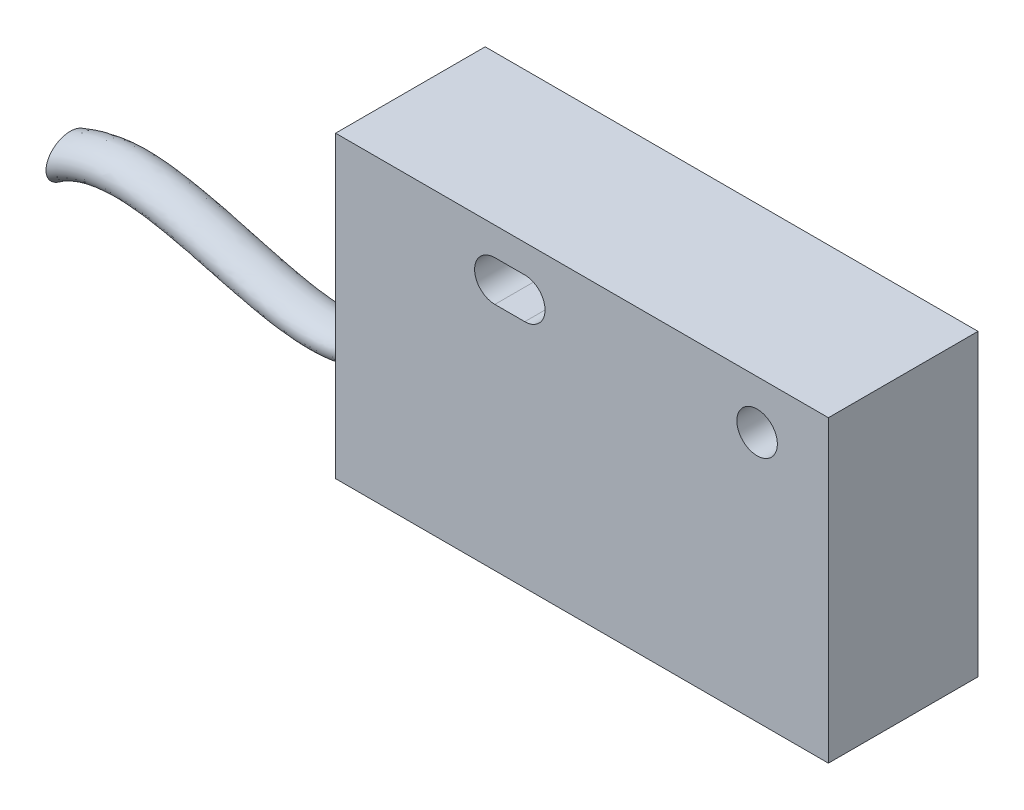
ISO-10303-21;
HEADER;
FILE_DESCRIPTION(('STEP AP214'),'2;1');
FILE_NAME('part.step','',(''),(''),'','','');
FILE_SCHEMA(('AUTOMOTIVE_DESIGN { 1 0 10303 214 1 1 1 1 }'));
ENDSEC;
DATA;
#1=APPLICATION_CONTEXT('core data for automotive mechanical design processes');
#2=APPLICATION_PROTOCOL_DEFINITION('international standard','automotive_design',2000,#1);
#3=PRODUCT_CONTEXT('',#1,'mechanical');
#4=PRODUCT('Part','Part','',(#3));
#5=PRODUCT_RELATED_PRODUCT_CATEGORY('part','',(#4));
#6=PRODUCT_DEFINITION_FORMATION('','',#4);
#7=PRODUCT_DEFINITION_CONTEXT('part definition',#1,'design');
#8=PRODUCT_DEFINITION('design','',#6,#7);
#9=PRODUCT_DEFINITION_SHAPE('','',#8);
#10=(LENGTH_UNIT() NAMED_UNIT(*) SI_UNIT(.MILLI.,.METRE.));
#11=(NAMED_UNIT(*) PLANE_ANGLE_UNIT() SI_UNIT($,.RADIAN.));
#12=(NAMED_UNIT(*) SI_UNIT($,.STERADIAN.) SOLID_ANGLE_UNIT());
#13=UNCERTAINTY_MEASURE_WITH_UNIT(LENGTH_MEASURE(1.E-05),#10,'distance_accuracy_value','');
#14=(GEOMETRIC_REPRESENTATION_CONTEXT(3) GLOBAL_UNCERTAINTY_ASSIGNED_CONTEXT((#13)) GLOBAL_UNIT_ASSIGNED_CONTEXT((#10,
#11,#12)) REPRESENTATION_CONTEXT('',''));
#15=CARTESIAN_POINT('',(0.,0.,0.));
#16=DIRECTION('',(0.,0.,1.));
#17=DIRECTION('',(1.,0.,0.));
#18=AXIS2_PLACEMENT_3D('',#15,#16,#17);
#19=CARTESIAN_POINT('',(28.,0.,4.25));
#20=DIRECTION('',(0.,1.,0.));
#21=DIRECTION('',(-1.,0.,0.));
#22=AXIS2_PLACEMENT_3D('',#19,#20,#21);
#23=PLANE('',#22);
#24=CARTESIAN_POINT('',(13.,0.,0.));
#25=DIRECTION('',(0.,1.,0.));
#26=DIRECTION('',(-1.,0.,0.));
#27=AXIS2_PLACEMENT_3D('',#24,#25,#26);
#28=CIRCLE('',#27,2.75);
#29=CARTESIAN_POINT('',(10.25,0.,0.));
#30=VERTEX_POINT('',#29);
#31=EDGE_CURVE('E188',#30,#30,#28,.F.);
#32=ORIENTED_EDGE('',*,*,#31,.F.);
#33=EDGE_LOOP('',(#32));
#34=FACE_BOUND('',#33,.T.);
#35=DIRECTION('',(1.,0.,0.));
#36=VECTOR('',#35,1.);
#37=CARTESIAN_POINT('',(28.,0.,-4.25));
#38=LINE('',#37,#36);
#39=CARTESIAN_POINT('',(0.,0.,-4.25));
#40=VERTEX_POINT('',#39);
#41=CARTESIAN_POINT('',(28.,0.,-4.25));
#42=VERTEX_POINT('',#41);
#43=EDGE_CURVE('E162',#40,#42,#38,.T.);
#44=ORIENTED_EDGE('',*,*,#43,.T.);
#45=DIRECTION('',(0.,0.,-1.));
#46=VECTOR('',#45,1.);
#47=CARTESIAN_POINT('',(28.,0.,4.25));
#48=LINE('',#47,#46);
#49=CARTESIAN_POINT('',(28.,0.,4.25));
#50=VERTEX_POINT('',#49);
#51=EDGE_CURVE('E168',#50,#42,#48,.T.);
#52=ORIENTED_EDGE('',*,*,#51,.F.);
#53=DIRECTION('',(1.,0.,0.));
#54=VECTOR('',#53,1.);
#55=CARTESIAN_POINT('',(28.,0.,4.25));
#56=LINE('',#55,#54);
#57=CARTESIAN_POINT('',(0.,0.,4.25));
#58=VERTEX_POINT('',#57);
#59=EDGE_CURVE('E166',#58,#50,#56,.T.);
#60=ORIENTED_EDGE('',*,*,#59,.F.);
#61=DIRECTION('',(0.,0.,-1.));
#62=VECTOR('',#61,1.);
#63=CARTESIAN_POINT('',(0.,0.,4.25));
#64=LINE('',#63,#62);
#65=EDGE_CURVE('E178',#58,#40,#64,.T.);
#66=ORIENTED_EDGE('',*,*,#65,.T.);
#67=EDGE_LOOP('',(#44,#52,#60,#66));
#68=FACE_BOUND('',#67,.T.);
#69=CARTESIAN_POINT('',(21.,0.,0.));
#70=DIRECTION('',(0.,1.,0.));
#71=DIRECTION('',(-1.,0.,0.));
#72=AXIS2_PLACEMENT_3D('',#69,#70,#71);
#73=CIRCLE('',#72,1.75);
#74=CARTESIAN_POINT('',(19.25,0.,0.));
#75=VERTEX_POINT('',#74);
#76=EDGE_CURVE('E191',#75,#75,#73,.F.);
#77=ORIENTED_EDGE('',*,*,#76,.F.);
#78=EDGE_LOOP('',(#77));
#79=FACE_BOUND('',#78,.T.);
#80=ADVANCED_FACE('F48',(#34,#68,#79),#23,.F.);
#81=CARTESIAN_POINT('',(0.,17.,4.25));
#82=DIRECTION('',(1.,0.,0.));
#83=DIRECTION('',(0.,1.,0.));
#84=AXIS2_PLACEMENT_3D('',#81,#82,#83);
#85=PLANE('',#84);
#86=DIRECTION('',(0.,-1.,0.));
#87=VECTOR('',#86,1.);
#88=CARTESIAN_POINT('',(0.,17.,-4.25));
#89=LINE('',#88,#87);
#90=CARTESIAN_POINT('',(0.,17.,-4.25));
#91=VERTEX_POINT('',#90);
#92=EDGE_CURVE('E173',#91,#40,#89,.T.);
#93=ORIENTED_EDGE('',*,*,#92,.T.);
#94=ORIENTED_EDGE('',*,*,#65,.F.);
#95=DIRECTION('',(0.,-1.,0.));
#96=VECTOR('',#95,1.);
#97=CARTESIAN_POINT('',(0.,17.,4.25));
#98=LINE('',#97,#96);
#99=CARTESIAN_POINT('',(0.,17.,4.25));
#100=VERTEX_POINT('',#99);
#101=EDGE_CURVE('E164',#100,#58,#98,.T.);
#102=ORIENTED_EDGE('',*,*,#101,.F.);
#103=DIRECTION('',(0.,0.,-1.));
#104=VECTOR('',#103,1.);
#105=CARTESIAN_POINT('',(0.,17.,4.25));
#106=LINE('',#105,#104);
#107=EDGE_CURVE('E181',#100,#91,#106,.T.);
#108=ORIENTED_EDGE('',*,*,#107,.T.);
#109=EDGE_LOOP('',(#93,#94,#102,#108));
#110=FACE_BOUND('',#109,.T.);
#111=CARTESIAN_POINT('',(0.,5.,0.));
#112=DIRECTION('',(-1.,0.,0.));
#113=DIRECTION('',(0.,-1.,0.));
#114=AXIS2_PLACEMENT_3D('',#111,#112,#113);
#115=CIRCLE('',#114,1.25);
#116=CARTESIAN_POINT('',(0.,3.75,0.));
#117=VERTEX_POINT('',#116);
#118=EDGE_CURVE('E187',#117,#117,#115,.T.);
#119=ORIENTED_EDGE('',*,*,#118,.F.);
#120=EDGE_LOOP('',(#119));
#121=FACE_BOUND('',#120,.T.);
#122=ADVANCED_FACE('F210',(#110,#121),#85,.F.);
#123=CARTESIAN_POINT('',(28.,0.,4.25));
#124=DIRECTION('',(0.,0.,-1.));
#125=DIRECTION('',(-1.,0.,0.));
#126=AXIS2_PLACEMENT_3D('',#123,#124,#125);
#127=PLANE('',#126);
#128=CARTESIAN_POINT('',(23.95,14.25,4.25));
#129=DIRECTION('',(0.,0.,1.));
#130=DIRECTION('',(1.,0.,0.));
#131=AXIS2_PLACEMENT_3D('',#128,#129,#130);
#132=CIRCLE('',#131,1.15);
#133=CARTESIAN_POINT('',(25.1,14.25,4.25));
#134=VERTEX_POINT('',#133);
#135=EDGE_CURVE('E152',#134,#134,#132,.T.);
#136=ORIENTED_EDGE('',*,*,#135,.F.);
#137=EDGE_LOOP('',(#136));
#138=FACE_BOUND('',#137,.T.);
#139=DIRECTION('',(0.,1.,0.));
#140=VECTOR('',#139,1.);
#141=CARTESIAN_POINT('',(28.,17.,4.25));
#142=LINE('',#141,#140);
#143=CARTESIAN_POINT('',(28.,17.,4.25));
#144=VERTEX_POINT('',#143);
#145=EDGE_CURVE('E158',#50,#144,#142,.T.);
#146=ORIENTED_EDGE('',*,*,#145,.T.);
#147=DIRECTION('',(-1.,0.,0.));
#148=VECTOR('',#147,1.);
#149=CARTESIAN_POINT('',(28.,17.,4.25));
#150=LINE('',#149,#148);
#151=EDGE_CURVE('E161',#144,#100,#150,.T.);
#152=ORIENTED_EDGE('',*,*,#151,.T.);
#153=ORIENTED_EDGE('',*,*,#101,.T.);
#154=ORIENTED_EDGE('',*,*,#59,.T.);
#155=EDGE_LOOP('',(#146,#152,#153,#154));
#156=FACE_BOUND('',#155,.T.);
#157=CARTESIAN_POINT('',(9.05,14.25,4.25));
#158=DIRECTION('',(0.,0.,1.));
#159=DIRECTION('',(1.,0.,0.));
#160=AXIS2_PLACEMENT_3D('',#157,#158,#159);
#161=CIRCLE('',#160,1.15);
#162=CARTESIAN_POINT('',(9.05,15.4,4.25));
#163=VERTEX_POINT('',#162);
#164=CARTESIAN_POINT('',(9.05,13.1,4.25));
#165=VERTEX_POINT('',#164);
#166=EDGE_CURVE('E113',#163,#165,#161,.T.);
#167=ORIENTED_EDGE('',*,*,#166,.F.);
#168=DIRECTION('',(-1.,0.,0.));
#169=VECTOR('',#168,1.);
#170=CARTESIAN_POINT('',(9.05,15.4,4.25));
#171=LINE('',#170,#169);
#172=CARTESIAN_POINT('',(10.75,15.4,4.25));
#173=VERTEX_POINT('',#172);
#174=EDGE_CURVE('E136',#173,#163,#171,.T.);
#175=ORIENTED_EDGE('',*,*,#174,.F.);
#176=CARTESIAN_POINT('',(10.75,14.25,4.25));
#177=DIRECTION('',(0.,0.,1.));
#178=DIRECTION('',(1.,0.,0.));
#179=AXIS2_PLACEMENT_3D('',#176,#177,#178);
#180=CIRCLE('',#179,1.15);
#181=CARTESIAN_POINT('',(10.75,13.1,4.25));
#182=VERTEX_POINT('',#181);
#183=EDGE_CURVE('E134',#182,#173,#180,.T.);
#184=ORIENTED_EDGE('',*,*,#183,.F.);
#185=DIRECTION('',(1.,0.,0.));
#186=VECTOR('',#185,1.);
#187=CARTESIAN_POINT('',(9.05,13.1,4.25));
#188=LINE('',#187,#186);
#189=EDGE_CURVE('E121',#165,#182,#188,.T.);
#190=ORIENTED_EDGE('',*,*,#189,.F.);
#191=EDGE_LOOP('',(#167,#175,#184,#190));
#192=FACE_BOUND('',#191,.T.);
#193=ADVANCED_FACE('F133',(#138,#156,#192),#127,.F.);
#194=CARTESIAN_POINT('',(28.,0.,-4.25));
#195=DIRECTION('',(0.,0.,-1.));
#196=DIRECTION('',(-1.,0.,0.));
#197=AXIS2_PLACEMENT_3D('',#194,#195,#196);
#198=PLANE('',#197);
#199=CARTESIAN_POINT('',(23.95,14.25,-4.25));
#200=DIRECTION('',(0.,0.,1.));
#201=DIRECTION('',(1.,0.,0.));
#202=AXIS2_PLACEMENT_3D('',#199,#200,#201);
#203=CIRCLE('',#202,1.15);
#204=CARTESIAN_POINT('',(25.1,14.25,-4.25));
#205=VERTEX_POINT('',#204);
#206=EDGE_CURVE('E129',#205,#205,#203,.T.);
#207=ORIENTED_EDGE('',*,*,#206,.T.);
#208=EDGE_LOOP('',(#207));
#209=FACE_BOUND('',#208,.T.);
#210=DIRECTION('',(0.,1.,0.));
#211=VECTOR('',#210,1.);
#212=CARTESIAN_POINT('',(28.,17.,-4.25));
#213=LINE('',#212,#211);
#214=CARTESIAN_POINT('',(28.,17.,-4.25));
#215=VERTEX_POINT('',#214);
#216=EDGE_CURVE('E155',#42,#215,#213,.T.);
#217=ORIENTED_EDGE('',*,*,#216,.F.);
#218=ORIENTED_EDGE('',*,*,#43,.F.);
#219=ORIENTED_EDGE('',*,*,#92,.F.);
#220=DIRECTION('',(-1.,0.,0.));
#221=VECTOR('',#220,1.);
#222=CARTESIAN_POINT('',(28.,17.,-4.25));
#223=LINE('',#222,#221);
#224=EDGE_CURVE('E171',#215,#91,#223,.T.);
#225=ORIENTED_EDGE('',*,*,#224,.F.);
#226=EDGE_LOOP('',(#217,#218,#219,#225));
#227=FACE_BOUND('',#226,.T.);
#228=DIRECTION('',(-1.,0.,0.));
#229=VECTOR('',#228,1.);
#230=CARTESIAN_POINT('',(9.05,15.4,-4.25));
#231=LINE('',#230,#229);
#232=CARTESIAN_POINT('',(10.75,15.4,-4.25));
#233=VERTEX_POINT('',#232);
#234=CARTESIAN_POINT('',(9.05,15.4,-4.25));
#235=VERTEX_POINT('',#234);
#236=EDGE_CURVE('E122',#233,#235,#231,.T.);
#237=ORIENTED_EDGE('',*,*,#236,.T.);
#238=CARTESIAN_POINT('',(9.05,14.25,-4.25));
#239=DIRECTION('',(0.,0.,1.));
#240=DIRECTION('',(1.,0.,0.));
#241=AXIS2_PLACEMENT_3D('',#238,#239,#240);
#242=CIRCLE('',#241,1.15);
#243=CARTESIAN_POINT('',(9.05,13.1,-4.25));
#244=VERTEX_POINT('',#243);
#245=EDGE_CURVE('E71',#235,#244,#242,.T.);
#246=ORIENTED_EDGE('',*,*,#245,.T.);
#247=DIRECTION('',(1.,0.,0.));
#248=VECTOR('',#247,1.);
#249=CARTESIAN_POINT('',(9.05,13.1,-4.25));
#250=LINE('',#249,#248);
#251=CARTESIAN_POINT('',(10.75,13.1,-4.25));
#252=VERTEX_POINT('',#251);
#253=EDGE_CURVE('E128',#244,#252,#250,.T.);
#254=ORIENTED_EDGE('',*,*,#253,.T.);
#255=CARTESIAN_POINT('',(10.75,14.25,-4.25));
#256=DIRECTION('',(0.,0.,1.));
#257=DIRECTION('',(1.,0.,0.));
#258=AXIS2_PLACEMENT_3D('',#255,#256,#257);
#259=CIRCLE('',#258,1.15);
#260=EDGE_CURVE('E144',#252,#233,#259,.T.);
#261=ORIENTED_EDGE('',*,*,#260,.T.);
#262=EDGE_LOOP('',(#237,#246,#254,#261));
#263=FACE_BOUND('',#262,.T.);
#264=ADVANCED_FACE('F221',(#209,#227,#263),#198,.T.);
#265=CARTESIAN_POINT('',(28.,17.,4.25));
#266=DIRECTION('',(-1.,0.,0.));
#267=DIRECTION('',(0.,-1.,0.));
#268=AXIS2_PLACEMENT_3D('',#265,#266,#267);
#269=PLANE('',#268);
#270=ORIENTED_EDGE('',*,*,#216,.T.);
#271=DIRECTION('',(0.,0.,-1.));
#272=VECTOR('',#271,1.);
#273=CARTESIAN_POINT('',(28.,17.,4.25));
#274=LINE('',#273,#272);
#275=EDGE_CURVE('E184',#144,#215,#274,.T.);
#276=ORIENTED_EDGE('',*,*,#275,.F.);
#277=ORIENTED_EDGE('',*,*,#145,.F.);
#278=ORIENTED_EDGE('',*,*,#51,.T.);
#279=EDGE_LOOP('',(#270,#276,#277,#278));
#280=FACE_BOUND('',#279,.T.);
#281=ADVANCED_FACE('F227',(#280),#269,.F.);
#282=CARTESIAN_POINT('',(28.,17.,4.25));
#283=DIRECTION('',(0.,-1.,0.));
#284=DIRECTION('',(1.,0.,0.));
#285=AXIS2_PLACEMENT_3D('',#282,#283,#284);
#286=PLANE('',#285);
#287=ORIENTED_EDGE('',*,*,#224,.T.);
#288=ORIENTED_EDGE('',*,*,#107,.F.);
#289=ORIENTED_EDGE('',*,*,#151,.F.);
#290=ORIENTED_EDGE('',*,*,#275,.T.);
#291=EDGE_LOOP('',(#287,#288,#289,#290));
#292=FACE_BOUND('',#291,.T.);
#293=ADVANCED_FACE('F224',(#292),#286,.F.);
#294=CARTESIAN_POINT('',(23.95,14.25,4.25));
#295=DIRECTION('',(0.,0.,-1.));
#296=DIRECTION('',(-1.,0.,0.));
#297=AXIS2_PLACEMENT_3D('',#294,#295,#296);
#298=CYLINDRICAL_SURFACE('',#297,1.15);
#299=ORIENTED_EDGE('',*,*,#135,.T.);
#300=EDGE_LOOP('',(#299));
#301=FACE_BOUND('',#300,.T.);
#302=ORIENTED_EDGE('',*,*,#206,.F.);
#303=EDGE_LOOP('',(#302));
#304=FACE_BOUND('',#303,.T.);
#305=ADVANCED_FACE('F226',(#301,#304),#298,.F.);
#306=CARTESIAN_POINT('',(9.05,14.25,4.25));
#307=DIRECTION('',(0.,0.,-1.));
#308=DIRECTION('',(-1.,0.,0.));
#309=AXIS2_PLACEMENT_3D('',#306,#307,#308);
#310=CYLINDRICAL_SURFACE('',#309,1.15);
#311=ORIENTED_EDGE('',*,*,#245,.F.);
#312=DIRECTION('',(0.,0.,-1.));
#313=VECTOR('',#312,1.);
#314=CARTESIAN_POINT('',(9.05,15.4,4.25));
#315=LINE('',#314,#313);
#316=EDGE_CURVE('E117',#163,#235,#315,.T.);
#317=ORIENTED_EDGE('',*,*,#316,.F.);
#318=ORIENTED_EDGE('',*,*,#166,.T.);
#319=DIRECTION('',(0.,0.,-1.));
#320=VECTOR('',#319,1.);
#321=CARTESIAN_POINT('',(9.05,13.1,4.25));
#322=LINE('',#321,#320);
#323=EDGE_CURVE('E116',#165,#244,#322,.T.);
#324=ORIENTED_EDGE('',*,*,#323,.T.);
#325=EDGE_LOOP('',(#311,#317,#318,#324));
#326=FACE_BOUND('',#325,.T.);
#327=ADVANCED_FACE('F115',(#326),#310,.F.);
#328=CARTESIAN_POINT('',(9.05,13.1,4.25));
#329=DIRECTION('',(0.,1.,0.));
#330=DIRECTION('',(-1.,0.,0.));
#331=AXIS2_PLACEMENT_3D('',#328,#329,#330);
#332=PLANE('',#331);
#333=ORIENTED_EDGE('',*,*,#253,.F.);
#334=ORIENTED_EDGE('',*,*,#323,.F.);
#335=ORIENTED_EDGE('',*,*,#189,.T.);
#336=DIRECTION('',(0.,0.,-1.));
#337=VECTOR('',#336,1.);
#338=CARTESIAN_POINT('',(10.75,13.1,4.25));
#339=LINE('',#338,#337);
#340=EDGE_CURVE('E130',#182,#252,#339,.T.);
#341=ORIENTED_EDGE('',*,*,#340,.T.);
#342=EDGE_LOOP('',(#333,#334,#335,#341));
#343=FACE_BOUND('',#342,.T.);
#344=ADVANCED_FACE('F125',(#343),#332,.T.);
#345=CARTESIAN_POINT('',(10.75,14.25,4.25));
#346=DIRECTION('',(0.,0.,-1.));
#347=DIRECTION('',(-1.,0.,0.));
#348=AXIS2_PLACEMENT_3D('',#345,#346,#347);
#349=CYLINDRICAL_SURFACE('',#348,1.15);
#350=ORIENTED_EDGE('',*,*,#260,.F.);
#351=ORIENTED_EDGE('',*,*,#340,.F.);
#352=ORIENTED_EDGE('',*,*,#183,.T.);
#353=DIRECTION('',(0.,0.,-1.));
#354=VECTOR('',#353,1.);
#355=CARTESIAN_POINT('',(10.75,15.4,4.25));
#356=LINE('',#355,#354);
#357=EDGE_CURVE('E63',#173,#233,#356,.T.);
#358=ORIENTED_EDGE('',*,*,#357,.T.);
#359=EDGE_LOOP('',(#350,#351,#352,#358));
#360=FACE_BOUND('',#359,.T.);
#361=ADVANCED_FACE('F268',(#360),#349,.F.);
#362=CARTESIAN_POINT('',(9.05,15.4,4.25));
#363=DIRECTION('',(0.,-1.,0.));
#364=DIRECTION('',(1.,0.,0.));
#365=AXIS2_PLACEMENT_3D('',#362,#363,#364);
#366=PLANE('',#365);
#367=ORIENTED_EDGE('',*,*,#236,.F.);
#368=ORIENTED_EDGE('',*,*,#357,.F.);
#369=ORIENTED_EDGE('',*,*,#174,.T.);
#370=ORIENTED_EDGE('',*,*,#316,.T.);
#371=EDGE_LOOP('',(#367,#368,#369,#370));
#372=FACE_BOUND('',#371,.T.);
#373=ADVANCED_FACE('F261',(#372),#366,.T.);
#374=CARTESIAN_POINT('',(-19.3210984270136,5.3108972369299,0.));
#375=DIRECTION('',(0.994989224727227,-0.0999822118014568,0.));
#376=DIRECTION('',(0.0999822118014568,0.994989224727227,0.));
#377=AXIS2_PLACEMENT_3D('',#374,#375,#376);
#378=PLANE('',#377);
#379=CARTESIAN_POINT('',(-19.4460761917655,4.06716070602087,0.));
#380=DIRECTION('',(0.994989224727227,-0.0999822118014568,0.));
#381=DIRECTION('',(0.0999822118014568,0.994989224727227,0.));
#382=AXIS2_PLACEMENT_3D('',#379,#380,#381);
#383=CIRCLE('',#382,1.25);
#384=CARTESIAN_POINT('',(-19.5710539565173,2.82342417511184,0.));
#385=VERTEX_POINT('',#384);
#386=EDGE_CURVE('E142',#385,#385,#383,.T.);
#387=ORIENTED_EDGE('',*,*,#386,.F.);
#388=EDGE_LOOP('',(#387));
#389=FACE_BOUND('',#388,.T.);
#390=ADVANCED_FACE('F259',(#389),#378,.F.);
#391=CARTESIAN_POINT('',(0.,3.75,0.));
#392=CARTESIAN_POINT('',(-0.795957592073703,3.03473539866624,0.));
#393=CARTESIAN_POINT('',(-2.49447804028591,2.12570558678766,0.));
#394=CARTESIAN_POINT('',(-5.26915586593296,1.9066600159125,0.));
#395=CARTESIAN_POINT('',(-8.17781220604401,2.41211456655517,0.));
#396=CARTESIAN_POINT('',(-10.9168344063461,3.16421623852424,0.));
#397=CARTESIAN_POINT('',(-13.4054747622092,3.77007266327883,0.));
#398=CARTESIAN_POINT('',(-15.6096426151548,4.05041474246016,0.));
#399=CARTESIAN_POINT('',(-17.6916537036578,3.85200649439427,0.));
#400=CARTESIAN_POINT('',(-18.9681759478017,3.26475143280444,0.));
#401=CARTESIAN_POINT('',(-19.5710539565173,2.82342417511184,0.));
#402=CARTESIAN_POINT('',(0.,3.75,2.5));
#403=CARTESIAN_POINT('',(-0.795957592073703,3.03473539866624,2.5));
#404=CARTESIAN_POINT('',(-2.49447804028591,2.12570558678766,2.5));
#405=CARTESIAN_POINT('',(-5.26915586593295,1.9066600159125,2.5));
#406=CARTESIAN_POINT('',(-8.17781220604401,2.41211456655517,2.5));
#407=CARTESIAN_POINT('',(-10.9168344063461,3.16421623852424,2.5));
#408=CARTESIAN_POINT('',(-13.4054747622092,3.77007266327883,2.5));
#409=CARTESIAN_POINT('',(-15.6096426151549,4.05041474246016,2.5));
#410=CARTESIAN_POINT('',(-17.6916537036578,3.85200649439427,2.5));
#411=CARTESIAN_POINT('',(-18.9681759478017,3.26475143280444,2.5));
#412=CARTESIAN_POINT('',(-19.5710539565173,2.82342417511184,2.5));
#413=CARTESIAN_POINT('',(0.,6.25,2.5));
#414=CARTESIAN_POINT('',(-0.413391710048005,5.47862897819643,2.5));
#415=CARTESIAN_POINT('',(-1.34678039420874,4.45738632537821,2.5));
#416=CARTESIAN_POINT('',(-3.42967452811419,3.63174885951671,2.5));
#417=CARTESIAN_POINT('',(-6.1086291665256,3.81838082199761,2.5));
#418=CARTESIAN_POINT('',(-8.80929768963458,4.50836293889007,2.5));
#419=CARTESIAN_POINT('',(-11.3951420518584,5.2642279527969,2.5));
#420=CARTESIAN_POINT('',(-13.8504746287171,5.84904312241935,2.5));
#421=CARTESIAN_POINT('',(-16.5012815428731,6.12673660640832,2.5));
#422=CARTESIAN_POINT('',(-18.4047482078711,5.6813101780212,2.5));
#423=CARTESIAN_POINT('',(-19.3210984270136,5.3108972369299,2.5));
#424=CARTESIAN_POINT('',(0.,6.25,0.));
#425=CARTESIAN_POINT('',(-0.413391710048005,5.47862897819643,0.));
#426=CARTESIAN_POINT('',(-1.34678039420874,4.45738632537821,0.));
#427=CARTESIAN_POINT('',(-3.42967452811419,3.63174885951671,0.));
#428=CARTESIAN_POINT('',(-6.1086291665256,3.81838082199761,0.));
#429=CARTESIAN_POINT('',(-8.80929768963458,4.50836293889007,0.));
#430=CARTESIAN_POINT('',(-11.3951420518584,5.2642279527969,0.));
#431=CARTESIAN_POINT('',(-13.8504746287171,5.84904312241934,0.));
#432=CARTESIAN_POINT('',(-16.5012815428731,6.12673660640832,0.));
#433=CARTESIAN_POINT('',(-18.4047482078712,5.6813101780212,0.));
#434=CARTESIAN_POINT('',(-19.3210984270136,5.3108972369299,0.));
#435=CARTESIAN_POINT('',(0.,6.25,-2.5));
#436=CARTESIAN_POINT('',(-0.413391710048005,5.47862897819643,-2.5));
#437=CARTESIAN_POINT('',(-1.34678039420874,4.45738632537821,-2.5));
#438=CARTESIAN_POINT('',(-3.42967452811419,3.63174885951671,-2.5));
#439=CARTESIAN_POINT('',(-6.1086291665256,3.81838082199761,-2.5));
#440=CARTESIAN_POINT('',(-8.80929768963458,4.50836293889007,-2.5));
#441=CARTESIAN_POINT('',(-11.3951420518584,5.2642279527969,-2.5));
#442=CARTESIAN_POINT('',(-13.8504746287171,5.84904312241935,-2.5));
#443=CARTESIAN_POINT('',(-16.5012815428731,6.12673660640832,-2.5));
#444=CARTESIAN_POINT('',(-18.4047482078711,5.6813101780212,-2.5));
#445=CARTESIAN_POINT('',(-19.3210984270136,5.3108972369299,-2.5));
#446=CARTESIAN_POINT('',(0.,3.75,-2.5));
#447=CARTESIAN_POINT('',(-0.795957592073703,3.03473539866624,-2.5));
#448=CARTESIAN_POINT('',(-2.49447804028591,2.12570558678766,-2.5));
#449=CARTESIAN_POINT('',(-5.26915586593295,1.9066600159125,-2.5));
#450=CARTESIAN_POINT('',(-8.17781220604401,2.41211456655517,-2.5));
#451=CARTESIAN_POINT('',(-10.9168344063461,3.16421623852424,-2.5));
#452=CARTESIAN_POINT('',(-13.4054747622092,3.77007266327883,-2.5));
#453=CARTESIAN_POINT('',(-15.6096426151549,4.05041474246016,-2.5));
#454=CARTESIAN_POINT('',(-17.6916537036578,3.85200649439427,-2.5));
#455=CARTESIAN_POINT('',(-18.9681759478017,3.26475143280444,-2.5));
#456=CARTESIAN_POINT('',(-19.5710539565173,2.82342417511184,-2.5));
#457=CARTESIAN_POINT('',(0.,3.75,0.));
#458=CARTESIAN_POINT('',(-0.795957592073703,3.03473539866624,0.));
#459=CARTESIAN_POINT('',(-2.49447804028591,2.12570558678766,0.));
#460=CARTESIAN_POINT('',(-5.26915586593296,1.9066600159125,0.));
#461=CARTESIAN_POINT('',(-8.17781220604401,2.41211456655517,0.));
#462=CARTESIAN_POINT('',(-10.9168344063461,3.16421623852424,0.));
#463=CARTESIAN_POINT('',(-13.4054747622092,3.77007266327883,0.));
#464=CARTESIAN_POINT('',(-15.6096426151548,4.05041474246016,0.));
#465=CARTESIAN_POINT('',(-17.6916537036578,3.85200649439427,0.));
#466=CARTESIAN_POINT('',(-18.9681759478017,3.26475143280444,0.));
#467=CARTESIAN_POINT('',(-19.5710539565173,2.82342417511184,0.));
#468=(BOUNDED_SURFACE() B_SPLINE_SURFACE(3,3,((#391,#392,#393,#394,#395,#396,#397,#398,#399,
#400,#401),(#402,#403,#404,#405,#406,#407,#408,#409,#410,#411,#412),(#413,#414,#415,#416,#417,
#418,#419,#420,#421,#422,#423),(#424,#425,#426,#427,#428,#429,#430,#431,#432,#433,#434),(#435,
#436,#437,#438,#439,#440,#441,#442,#443,#444,#445),(#446,#447,#448,#449,#450,#451,#452,#453,
#454,#455,#456),(#457,#458,#459,#460,#461,#462,#463,#464,#465,#466,#467)),.UNSPECIFIED.,.T.,.F.,
.F.) B_SPLINE_SURFACE_WITH_KNOTS((4,3,4),(4,1,1,1,1,1,1,1,4),(0.,0.5,1.),(0.,0.14,
0.280000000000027,0.42,0.56,0.67,0.779999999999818,0.89,1.),
.UNSPECIFIED.) GEOMETRIC_REPRESENTATION_ITEM() RATIONAL_B_SPLINE_SURFACE(((1.,1.,1.,1.,1.,1.,1.,
1.,1.,1.,1.),(0.333333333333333,0.333333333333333,0.333333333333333,0.333333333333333,
0.333333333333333,0.333333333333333,0.333333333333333,0.333333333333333,0.333333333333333,
0.333333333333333,0.333333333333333),(0.333333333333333,0.333333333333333,0.333333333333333,
0.333333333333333,0.333333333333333,0.333333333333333,0.333333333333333,0.333333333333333,
0.333333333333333,0.333333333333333,0.333333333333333),(1.,1.,1.,1.,1.,1.,1.,1.,1.,1.,1.),
(0.333333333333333,0.333333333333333,0.333333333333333,0.333333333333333,0.333333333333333,
0.333333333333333,0.333333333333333,0.333333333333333,0.333333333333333,0.333333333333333,
0.333333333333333),(0.333333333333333,0.333333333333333,0.333333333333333,0.333333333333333,
0.333333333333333,0.333333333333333,0.333333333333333,0.333333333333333,0.333333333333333,
0.333333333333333,0.333333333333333),(1.,1.,1.,1.,1.,1.,1.,1.,1.,1.,1.))) REPRESENTATION_ITEM('') SURFACE());
#469=CARTESIAN_POINT('',(0.,3.75,0.));
#470=CARTESIAN_POINT('',(-0.00554729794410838,3.74501507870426,0.));
#471=CARTESIAN_POINT('',(-0.011102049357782,3.74003845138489,0.));
#472=CARTESIAN_POINT('',(-0.0222167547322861,3.73011055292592,0.));
#473=CARTESIAN_POINT('',(-0.0277766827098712,3.72515925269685,0.));
#474=CARTESIAN_POINT('',(-0.0389017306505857,3.71528196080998,0.));
#475=CARTESIAN_POINT('',(-0.044466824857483,3.71035594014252,0.));
#476=CARTESIAN_POINT('',(-0.0556021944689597,3.70052915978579,0.));
#477=CARTESIAN_POINT('',(-0.0611724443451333,3.69562837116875,0.));
#478=CARTESIAN_POINT('',(-0.0723181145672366,3.68585200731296,0.));
#479=CARTESIAN_POINT('',(-0.0778935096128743,3.68097640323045,0.));
#480=CARTESIAN_POINT('',(-0.0890494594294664,3.671250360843,0.));
#481=CARTESIAN_POINT('',(-0.0946299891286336,3.6663998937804,0.));
#482=CARTESIAN_POINT('',(-0.105796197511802,3.65672407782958,0.));
#483=CARTESIAN_POINT('',(-0.111381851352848,3.65189870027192,0.));
#484=CARTESIAN_POINT('',(-0.122558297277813,3.64227301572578,0.));
#485=CARTESIAN_POINT('',(-0.128149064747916,3.63747268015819,0.));
#486=CARTESIAN_POINT('',(-0.139335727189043,3.62789703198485,0.));
#487=CARTESIAN_POINT('',(-0.144931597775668,3.62312169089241,0.));
#488=CARTESIAN_POINT('',(-0.156128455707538,3.61359598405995,0.));
#489=CARTESIAN_POINT('',(-0.161729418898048,3.60884558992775,0.));
#490=CARTESIAN_POINT('',(-0.172936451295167,3.59936972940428,0.));
#491=CARTESIAN_POINT('',(-0.178542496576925,3.5946442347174,0.));
#492=CARTESIAN_POINT('',(-0.189759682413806,3.585218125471,0.));
#493=CARTESIAN_POINT('',(-0.195370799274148,3.58051748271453,0.));
#494=CARTESIAN_POINT('',(-0.206598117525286,3.57114102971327,0.));
#495=CARTESIAN_POINT('',(-0.212214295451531,3.56646519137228,0.));
#496=CARTESIAN_POINT('',(-0.223451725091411,3.55713829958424,0.));
#497=CARTESIAN_POINT('',(-0.229072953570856,3.5524872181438,0.));
#498=CARTESIAN_POINT('',(-0.240320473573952,3.54320979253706,0.));
#499=CARTESIAN_POINT('',(-0.245946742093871,3.53858342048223,0.));
#500=CARTESIAN_POINT('',(-0.257204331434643,3.52935536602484,0.));
#501=CARTESIAN_POINT('',(-0.262835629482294,3.52475365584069,0.));
#502=CARTESIAN_POINT('',(-0.274103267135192,3.51557487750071,0.));
#503=CARTESIAN_POINT('',(-0.279739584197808,3.51099778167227,0.));
#504=CARTESIAN_POINT('',(-0.291017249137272,3.50186818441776,0.));
#505=CARTESIAN_POINT('',(-0.296658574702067,3.49731565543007,0.));
#506=CARTESIAN_POINT('',(-0.307946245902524,3.48823514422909,0.));
#507=CARTESIAN_POINT('',(-0.313592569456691,3.48370713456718,0.));
#508=CARTESIAN_POINT('',(-0.324890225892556,3.47467561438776,0.));
#509=CARTESIAN_POINT('',(-0.330541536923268,3.47017207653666,0.));
#510=CARTESIAN_POINT('',(-0.341849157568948,3.46118945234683,0.));
#511=CARTESIAN_POINT('',(-0.347505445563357,3.45671033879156,0.));
#512=CARTESIAN_POINT('',(-0.358823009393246,3.44777651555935,0.));
#513=CARTESIAN_POINT('',(-0.364484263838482,3.44332177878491,0.));
#514=CARTESIAN_POINT('',(-0.375811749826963,3.43443666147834,0.));
#515=CARTESIAN_POINT('',(-0.381477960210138,3.43000625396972,0.));
#516=CARTESIAN_POINT('',(-0.392815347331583,3.42116974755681,0.));
#517=CARTESIAN_POINT('',(-0.398486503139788,3.41676362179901,0.));
#518=CARTESIAN_POINT('',(-0.40983377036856,3.40797563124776,0.));
#519=CARTESIAN_POINT('',(-0.415509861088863,3.40359373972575,0.));
#520=CARTESIAN_POINT('',(-0.426866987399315,3.39485417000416,0.));
#521=CARTESIAN_POINT('',(-0.432548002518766,3.3904964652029,0.));
#522=CARTESIAN_POINT('',(-0.443914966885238,3.38180522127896,0.));
#523=CARTESIAN_POINT('',(-0.449600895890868,3.37747165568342,0.));
#524=CARTESIAN_POINT('',(-0.460977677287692,3.36882864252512,0.));
#525=CARTESIAN_POINT('',(-0.466668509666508,3.36451916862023,0.));
#526=CARTESIAN_POINT('',(-0.478055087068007,3.35592429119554,0.));
#527=CARTESIAN_POINT('',(-0.483750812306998,3.35163886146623,0.));
#528=CARTESIAN_POINT('',(-0.495147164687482,3.34309202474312,0.));
#529=CARTESIAN_POINT('',(-0.500847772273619,3.33883059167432,0.));
#530=CARTESIAN_POINT('',(-0.512253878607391,3.33033170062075,0.));
#531=CARTESIAN_POINT('',(-0.517959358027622,3.32609421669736,0.));
#532=CARTESIAN_POINT('',(-0.529375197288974,3.31764317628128,0.));
#533=CARTESIAN_POINT('',(-0.535085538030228,3.3134295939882,0.));
#534=CARTESIAN_POINT('',(-0.546511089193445,3.30502630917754,0.));
#535=CARTESIAN_POINT('',(-0.552226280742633,3.30083658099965,0.));
#536=CARTESIAN_POINT('',(-0.563661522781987,3.29248095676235,0.));
#537=CARTESIAN_POINT('',(-0.569381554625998,3.28831503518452,0.));
#538=CARTESIAN_POINT('',(-0.580826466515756,3.2800069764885,0.));
#539=CARTESIAN_POINT('',(-0.586551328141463,3.27586481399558,0.));
#540=CARTESIAN_POINT('',(-0.598005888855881,3.26760422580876,0.));
#541=CARTESIAN_POINT('',(-0.603735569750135,3.26348577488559,0.));
#542=CARTESIAN_POINT('',(-0.61519975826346,3.25527256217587,0.));
#543=CARTESIAN_POINT('',(-0.620934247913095,3.25117777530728,0.));
#544=CARTESIAN_POINT('',(-0.632408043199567,3.24301184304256,0.));
#545=CARTESIAN_POINT('',(-0.638147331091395,3.23894067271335,0.));
#546=CARTESIAN_POINT('',(-0.649630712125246,3.2308219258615,0.));
#547=CARTESIAN_POINT('',(-0.655374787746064,3.22677432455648,0.));
#548=CARTESIAN_POINT('',(-0.666867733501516,3.21870266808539,0.));
#549=CARTESIAN_POINT('',(-0.672616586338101,3.21467858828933,0.));
#550=CARTESIAN_POINT('',(-0.68411907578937,3.20665392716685,0.));
#551=CARTESIAN_POINT('',(-0.689872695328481,3.20265332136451,0.));
#552=CARTESIAN_POINT('',(-0.701384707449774,3.1946755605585,0.));
#553=CARTESIAN_POINT('',(-0.707143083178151,3.19069838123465,0.));
#554=CARTESIAN_POINT('',(-0.71866459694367,3.18276742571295,0.));
#555=CARTESIAN_POINT('',(-0.724427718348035,3.1788136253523,0.));
#556=CARTESIAN_POINT('',(-0.735958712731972,3.17092938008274,0.));
#557=CARTESIAN_POINT('',(-0.741726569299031,3.16699891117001,0.));
#558=CARTESIAN_POINT('',(-0.753267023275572,3.15916128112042,0.));
#559=CARTESIAN_POINT('',(-0.759039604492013,3.15525409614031,0.));
#560=CARTESIAN_POINT('',(-0.770589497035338,3.14746298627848,0.));
#561=CARTESIAN_POINT('',(-0.776366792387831,3.14357903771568,0.));
#562=CARTESIAN_POINT('',(-0.787926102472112,3.13583435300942,0.));
#563=CARTESIAN_POINT('',(-0.79370810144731,3.13197359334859,0.));
#564=CARTESIAN_POINT('',(-0.805276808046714,3.12427523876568,0.));
#565=CARTESIAN_POINT('',(-0.811063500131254,3.12043762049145,0.));
#566=CARTESIAN_POINT('',(-0.822641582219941,3.11278550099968,0.));
#567=CARTESIAN_POINT('',(-0.828432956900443,3.10897097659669,0.));
#568=CARTESIAN_POINT('',(-0.840020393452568,3.10136499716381,0.));
#569=CARTESIAN_POINT('',(-0.845816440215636,3.09757351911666,0.));
#570=CARTESIAN_POINT('',(-0.857413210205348,3.09001358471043,0.));
#571=CARTESIAN_POINT('',(-0.86321391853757,3.08624510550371,0.));
#572=CARTESIAN_POINT('',(-0.874820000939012,3.07873112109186,0.));
#573=CARTESIAN_POINT('',(-0.880625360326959,3.07498559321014,0.));
#574=CARTESIAN_POINT('',(-0.89224073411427,3.06751746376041,0.));
#575=CARTESIAN_POINT('',(-0.8980507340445,3.06379483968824,0.));
#576=CARTESIAN_POINT('',(-0.909675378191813,3.05637247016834,0.));
#577=CARTESIAN_POINT('',(-0.915490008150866,3.05267270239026,0.));
#578=CARTESIAN_POINT('',(-0.92712390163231,3.04529599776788,0.));
#579=CARTESIAN_POINT('',(-0.932943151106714,3.04161903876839,0.));
#580=CARTESIAN_POINT('',(-0.944586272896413,3.03428790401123,0.));
#581=CARTESIAN_POINT('',(-0.950410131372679,3.03063370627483,0.));
#582=CARTESIAN_POINT('',(-0.962062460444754,3.02334804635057,0.));
#583=CARTESIAN_POINT('',(-0.967890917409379,3.01971656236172,0.));
#584=CARTESIAN_POINT('',(-0.979552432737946,3.01247628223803,0.));
#585=CARTESIAN_POINT('',(-0.985385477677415,3.00886746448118,0.));
#586=CARTESIAN_POINT('',(-0.997056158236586,3.0016724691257,0.));
#587=CARTESIAN_POINT('',(-1.00289378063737,2.99808627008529,0.));
#588=CARTESIAN_POINT('',(-1.01457360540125,2.99093646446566,0.));
#589=CARTESIAN_POINT('',(-1.0204157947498,2.9873728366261,0.));
#590=CARTESIAN_POINT('',(-1.03210474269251,2.98026812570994,0.));
#591=CARTESIAN_POINT('',(-1.03795148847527,2.97672702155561,0.));
#592=CARTESIAN_POINT('',(-1.0496495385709,2.96966731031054,0.));
#593=CARTESIAN_POINT('',(-1.05550083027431,2.9661486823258,0.));
#594=CARTESIAN_POINT('',(-1.06720796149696,2.95913387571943,0.));
#595=CARTESIAN_POINT('',(-1.07306378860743,2.95563767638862,0.));
#596=CARTESIAN_POINT('',(-1.08477997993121,2.94866767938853,0.));
#597=CARTESIAN_POINT('',(-1.09064033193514,2.94519386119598,0.));
#598=CARTESIAN_POINT('',(-1.10236556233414,2.93826857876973,0.));
#599=CARTESIAN_POINT('',(-1.10823042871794,2.93481709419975,0.));
#600=CARTESIAN_POINT('',(-1.11996467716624,2.9279364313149,0.));
#601=CARTESIAN_POINT('',(-1.12583404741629,2.92450723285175,0.));
#602=CARTESIAN_POINT('',(-1.137577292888,2.91767109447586,0.));
#603=CARTESIAN_POINT('',(-1.14345115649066,2.91426413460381,0.));
#604=CARTESIAN_POINT('',(-1.15520337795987,2.9074724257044,0.));
#605=CARTESIAN_POINT('',(-1.1610817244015,2.90408765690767,0.));
#606=CARTESIAN_POINT('',(-1.1728429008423,2.89734028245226,0.));
#607=CARTESIAN_POINT('',(-1.17872571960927,2.89397765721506,0.));
#608=CARTESIAN_POINT('',(-1.19049582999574,2.88727452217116,0.));
#609=CARTESIAN_POINT('',(-1.19638311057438,2.88393399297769,0.));
#610=CARTESIAN_POINT('',(-1.20816213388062,2.87727500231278,0.));
#611=CARTESIAN_POINT('',(-1.21405386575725,2.87395652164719,0.));
#612=CARTESIAN_POINT('',(-1.22584178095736,2.86734158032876,0.));
#613=CARTESIAN_POINT('',(-1.23173795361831,2.8640451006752,0.));
#614=CARTESIAN_POINT('',(-1.24353473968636,2.85747411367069,0.));
#615=CARTESIAN_POINT('',(-1.24943534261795,2.85419958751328,0.));
#616=CARTESIAN_POINT('',(-1.26124097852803,2.84767245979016,0.));
#617=CARTESIAN_POINT('',(-1.26714600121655,2.84441983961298,0.));
#618=CARTESIAN_POINT('',(-1.27896046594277,2.83793647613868,0.));
#619=CARTESIAN_POINT('',(-1.28486989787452,2.83470571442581,0.));
#620=CARTESIAN_POINT('',(-1.29669317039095,2.82826602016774,0.));
#621=CARTESIAN_POINT('',(-1.30260700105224,2.82505706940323,0.));
#622=CARTESIAN_POINT('',(-1.31443906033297,2.81866094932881,0.));
#623=CARTESIAN_POINT('',(-1.32035727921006,2.81547376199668,0.));
#624=CARTESIAN_POINT('',(-1.3321981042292,2.80912112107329,0.));
#625=CARTESIAN_POINT('',(-1.33812070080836,2.80595564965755,0.));
#626=CARTESIAN_POINT('',(-1.34997027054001,2.79964639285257,0.));
#627=CARTESIAN_POINT('',(-1.35589723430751,2.79650258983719,0.));
#628=CARTESIAN_POINT('',(-1.36775552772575,2.79023662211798,0.));
#629=CARTESIAN_POINT('',(-1.37368684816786,2.78711443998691,0.));
#630=CARTESIAN_POINT('',(-1.3855538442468,2.78089166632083,0.));
#631=CARTESIAN_POINT('',(-1.39148951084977,2.77779105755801,0.));
#632=CARTESIAN_POINT('',(-1.40336518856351,2.77161138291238,0.));
#633=CARTESIAN_POINT('',(-1.40930519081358,2.76853230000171,0.));
#634=CARTESIAN_POINT('',(-1.42118952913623,2.76239562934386,0.));
#635=CARTESIAN_POINT('',(-1.42713385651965,2.75933802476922,0.));
#636=CARTESIAN_POINT('',(-1.43902683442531,2.75324426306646,0.));
#637=CARTESIAN_POINT('',(-1.44497547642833,2.75020808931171,0.));
#638=CARTESIAN_POINT('',(-1.45687707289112,2.74415714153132,0.));
#639=CARTESIAN_POINT('',(-1.46283001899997,2.74114235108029,0.));
#640=CARTESIAN_POINT('',(-1.474740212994,2.73513412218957,0.));
#641=CARTESIAN_POINT('',(-1.4806974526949,2.73214066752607,0.));
#642=CARTESIAN_POINT('',(-1.49261622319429,2.72617506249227,0.));
#643=CARTESIAN_POINT('',(-1.49857774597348,2.72320289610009,0.));
#644=CARTESIAN_POINT('',(-1.51050507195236,2.71727981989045,0.));
#645=CARTESIAN_POINT('',(-1.51647086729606,2.71432889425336,0.));
#646=CARTESIAN_POINT('',(-1.52840672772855,2.70844825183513,0.));
#647=CARTESIAN_POINT('',(-1.53437678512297,2.70551851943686,0.));
#648=CARTESIAN_POINT('',(-1.54632115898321,2.69968021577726,0.));
#649=CARTESIAN_POINT('',(-1.55229546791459,2.69677162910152,0.));
#650=CARTESIAN_POINT('',(-1.56424833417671,2.69097556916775,0.));
#651=CARTESIAN_POINT('',(-1.57022688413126,2.68808808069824,0.));
#652=CARTESIAN_POINT('',(-1.58218822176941,2.68233416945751,0.));
#653=CARTESIAN_POINT('',(-1.58817100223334,2.67946773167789,0.));
#654=CARTESIAN_POINT('',(-1.60014079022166,2.67375587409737,0.));
#655=CARTESIAN_POINT('',(-1.60612779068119,2.67091043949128,0.));
#656=CARTESIAN_POINT('',(-1.61810600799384,2.66524054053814,0.));
#657=CARTESIAN_POINT('',(-1.62409721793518,2.66241606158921,0.));
#658=CARTESIAN_POINT('',(-1.63608384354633,2.6567880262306,0.));
#659=CARTESIAN_POINT('',(-1.64207925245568,2.65398445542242,0.));
#660=CARTESIAN_POINT('',(-1.65407426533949,2.64839818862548,0.));
#661=CARTESIAN_POINT('',(-1.66007386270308,2.64561547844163,0.));
#662=CARTESIAN_POINT('',(-1.67207724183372,2.64007088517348,0.));
#663=CARTESIAN_POINT('',(-1.67808101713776,2.6373089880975,0.));
#664=CARTESIAN_POINT('',(-1.69009274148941,2.63180597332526,0.));
#665=CARTESIAN_POINT('',(-1.69610068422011,2.62906484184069,0.));
#666=CARTESIAN_POINT('',(-1.70812073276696,2.62360331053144,0.));
#667=CARTESIAN_POINT('',(-1.71413283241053,2.62088289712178,0.));
#668=CARTESIAN_POINT('',(-1.72616118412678,2.61546275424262,0.));
#669=CARTESIAN_POINT('',(-1.73217743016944,2.61276301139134,0.));
#670=CARTESIAN_POINT('',(-1.74421406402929,2.60738416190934,0.));
#671=CARTESIAN_POINT('',(-1.75023444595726,2.6047050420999,0.));
#672=CARTESIAN_POINT('',(-1.76227934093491,2.59936739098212,0.));
#673=CARTESIAN_POINT('',(-1.76830384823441,2.59670884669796,0.));
#674=CARTESIAN_POINT('',(-1.78035698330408,2.59141229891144,0.));
#675=CARTESIAN_POINT('',(-1.78638560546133,2.58877428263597,0.));
#676=CARTESIAN_POINT('',(-1.79844695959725,2.58351874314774,0.));
#677=CARTESIAN_POINT('',(-1.80447968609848,2.58090120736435,0.));
#678=CARTESIAN_POINT('',(-1.81654923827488,2.57568658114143,0.));
#679=CARTESIAN_POINT('',(-1.82258605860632,2.57308947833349,0.));
#680=CARTESIAN_POINT('',(-1.83466378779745,2.56791567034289,0.));
#681=CARTESIAN_POINT('',(-1.84070469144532,2.56533895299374,0.));
#682=CARTESIAN_POINT('',(-1.85279057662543,2.56020586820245,0.));
#683=CARTESIAN_POINT('',(-1.85883555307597,2.55764948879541,0.));
#684=CARTESIAN_POINT('',(-1.87092957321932,2.55255703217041,0.));
#685=CARTESIAN_POINT('',(-1.87697861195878,2.55002094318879,0.));
#686=CARTESIAN_POINT('',(-1.88908074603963,2.54496901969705,0.));
#687=CARTESIAN_POINT('',(-1.89513383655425,2.54245317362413,0.));
#688=CARTESIAN_POINT('',(-1.90724406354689,2.53744168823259,0.));
#689=CARTESIAN_POINT('',(-1.91330119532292,2.53494603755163,0.));
#690=CARTESIAN_POINT('',(-1.92541949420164,2.52997489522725,0.));
#691=CARTESIAN_POINT('',(-1.93148065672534,2.52749939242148,0.));
#692=CARTESIAN_POINT('',(-1.94360700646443,2.52256849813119,0.));
#693=CARTESIAN_POINT('',(-1.94967218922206,2.52011309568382,0.));
#694=CARTESIAN_POINT('',(-1.96180656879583,2.51522235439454,0.));
#695=CARTESIAN_POINT('',(-1.96787576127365,2.51278700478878,0.));
#696=CARTESIAN_POINT('',(-1.98001814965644,2.5079363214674,0.));
#697=CARTESIAN_POINT('',(-1.98609134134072,2.50552097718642,0.));
#698=CARTESIAN_POINT('',(-1.99824171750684,2.50071025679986,0.));
#699=CARTESIAN_POINT('',(-2.00431889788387,2.4983148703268,0.));
#700=CARTESIAN_POINT('',(-2.01647724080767,2.49354401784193,0.));
#701=CARTESIAN_POINT('',(-2.02255839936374,2.49116854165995,0.));
#702=CARTESIAN_POINT('',(-2.03472468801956,2.48643746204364,0.));
#703=CARTESIAN_POINT('',(-2.04080981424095,2.48408184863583,0.));
#704=CARTESIAN_POINT('',(-2.05298402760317,2.47939044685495,0.));
#705=CARTESIAN_POINT('',(-2.0590731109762,2.47705464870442,0.));
#706=CARTESIAN_POINT('',(-2.07125522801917,2.47240282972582,0.));
#707=CARTESIAN_POINT('',(-2.07734825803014,2.47008679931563,0.));
#708=CARTESIAN_POINT('',(-2.08953825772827,2.46547446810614,0.));
#709=CARTESIAN_POINT('',(-2.0956352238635,2.46317815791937,0.));
#710=CARTESIAN_POINT('',(-2.10783308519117,2.45860521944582,0.));
#711=CARTESIAN_POINT('',(-2.11393397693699,2.45632858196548,0.));
#712=CARTESIAN_POINT('',(-2.12613967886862,2.45179494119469,0.));
#713=CARTESIAN_POINT('',(-2.13224448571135,2.44953792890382,0.));
#714=CARTESIAN_POINT('',(-2.14445800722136,2.4450434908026,0.));
#715=CARTESIAN_POINT('',(-2.15056671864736,2.44280605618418,0.));
#716=CARTESIAN_POINT('',(-2.16278803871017,2.43835072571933,0.));
#717=CARTESIAN_POINT('',(-2.1689006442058,2.43613282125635,0.));
#718=CARTESIAN_POINT('',(-2.18112974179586,2.43171650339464,0.));
#719=CARTESIAN_POINT('',(-2.18724623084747,2.42951808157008,0.));
#720=CARTESIAN_POINT('',(-2.19948308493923,2.42514068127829,0.));
#721=CARTESIAN_POINT('',(-2.2056034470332,2.42296169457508,0.));
#722=CARTESIAN_POINT('',(-2.21784803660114,2.41862311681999,0.));
#723=CARTESIAN_POINT('',(-2.22397226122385,2.41646351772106,0.));
#724=CARTESIAN_POINT('',(-2.23622456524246,2.41216366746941,0.));
#725=CARTESIAN_POINT('',(-2.2423526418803,2.41002340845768,0.));
#726=CARTESIAN_POINT('',(-2.25461263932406,2.40576219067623,0.));
#727=CARTESIAN_POINT('',(-2.26074455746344,2.40364122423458,0.));
#728=CARTESIAN_POINT('',(-2.27301222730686,2.39941854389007,0.));
#729=CARTESIAN_POINT('',(-2.2791479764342,2.39731682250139,0.));
#730=CARTESIAN_POINT('',(-2.29142329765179,2.39313258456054,0.));
#731=CARTESIAN_POINT('',(-2.29756286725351,2.39105006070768,0.));
#732=CARTESIAN_POINT('',(-2.30984581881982,2.38690417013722,0.));
#733=CARTESIAN_POINT('',(-2.31598919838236,2.38484079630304,0.));
#734=CARTESIAN_POINT('',(-2.32827975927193,2.38073315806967,0.));
#735=CARTESIAN_POINT('',(-2.33442693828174,2.378688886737,0.));
#736=CARTESIAN_POINT('',(-2.34672508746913,2.37461940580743,0.));
#737=CARTESIAN_POINT('',(-2.35287605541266,2.37259418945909,0.));
#738=CARTESIAN_POINT('',(-2.36518177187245,2.3685627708,0.));
#739=CARTESIAN_POINT('',(-2.37133651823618,2.36655656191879,0.));
#740=CARTESIAN_POINT('',(-2.38364978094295,2.36256311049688,0.));
#741=CARTESIAN_POINT('',(-2.38980829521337,2.36057586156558,0.));
#742=CARTESIAN_POINT('',(-2.40212908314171,2.35662028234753,0.));
#743=CARTESIAN_POINT('',(-2.40829135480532,2.35465194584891,0.));
#744=CARTESIAN_POINT('',(-2.42061964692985,2.35073414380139,0.));
#745=CARTESIAN_POINT('',(-2.42678566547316,2.34878467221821,0.));
#746=CARTESIAN_POINT('',(-2.43912144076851,2.34490455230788,0.));
#747=CARTESIAN_POINT('',(-2.44529119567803,2.34297389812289,0.));
#748=CARTESIAN_POINT('',(-2.45763443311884,2.3391313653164,0.));
#749=CARTESIAN_POINT('',(-2.46380791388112,2.33721948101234,0.));
#750=CARTESIAN_POINT('',(-2.47615859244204,2.33341444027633,0.));
#751=CARTESIAN_POINT('',(-2.48233578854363,2.33152127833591,0.));
#752=CARTESIAN_POINT('',(-2.49469388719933,2.32775363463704,0.));
#753=CARTESIAN_POINT('',(-2.50087478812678,2.32587914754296,0.));
#754=CARTESIAN_POINT('',(-2.51324028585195,2.32214880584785,0.));
#755=CARTESIAN_POINT('',(-2.51942488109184,2.32029294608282,0.));
#756=CARTESIAN_POINT('',(-2.53179775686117,2.3165998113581,0.));
#757=CARTESIAN_POINT('',(-2.53798603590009,2.31476253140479,0.));
#758=CARTESIAN_POINT('',(-2.5503662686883,2.31110650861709,0.));
#759=CARTESIAN_POINT('',(-2.55655822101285,2.30928776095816,0.));
#760=CARTESIAN_POINT('',(-2.56894578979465,2.30566875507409,0.));
#761=CARTESIAN_POINT('',(-2.57514140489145,2.30386849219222,0.));
#762=CARTESIAN_POINT('',(-2.58753628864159,2.30028640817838,0.));
#763=CARTESIAN_POINT('',(-2.59373555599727,2.29850458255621,0.));
#764=CARTESIAN_POINT('',(-2.6061377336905,2.29495932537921,0.));
#765=CARTESIAN_POINT('',(-2.61234064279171,2.29319588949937,0.));
#766=CARTESIAN_POINT('',(-2.62475009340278,2.2896873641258,0.));
#767=CARTESIAN_POINT('',(-2.63095663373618,2.28794227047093,0.));
#768=CARTESIAN_POINT('',(-2.6433733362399,2.28447038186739,0.));
#769=CARTESIAN_POINT('',(-2.64958349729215,2.2827435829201,0.));
#770=CARTESIAN_POINT('',(-2.6620074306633,2.27930823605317,0.));
#771=CARTESIAN_POINT('',(-2.6682212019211,2.27759968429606,0.));
#772=CARTESIAN_POINT('',(-2.68065234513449,2.27420078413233,0.));
#773=CARTESIAN_POINT('',(-2.68686971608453,2.27251043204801,0.));
#774=CARTESIAN_POINT('',(-2.69930804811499,2.26914788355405,0.));
#775=CARTESIAN_POINT('',(-2.705529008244,2.2674756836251,0.));
#776=CARTESIAN_POINT('',(-2.71797450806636,2.26414939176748,0.));
#777=CARTESIAN_POINT('',(-2.72419904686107,2.26249529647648,0.));
#778=CARTESIAN_POINT('',(-2.73665169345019,2.25920516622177,0.));
#779=CARTESIAN_POINT('',(-2.74287980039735,2.2575691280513,0.));
#780=CARTESIAN_POINT('',(-2.75533957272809,2.25431506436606,0.));
#781=CARTESIAN_POINT('',(-2.76157123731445,2.25269703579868,0.));
#782=CARTESIAN_POINT('',(-2.7740381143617,2.24947894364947,0.));
#783=CARTESIAN_POINT('',(-2.78027332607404,2.24787887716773,0.));
#784=CARTESIAN_POINT('',(-2.79274728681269,2.2446966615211,0.));
#785=CARTESIAN_POINT('',(-2.7989860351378,2.24311450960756,0.));
#786=CARTESIAN_POINT('',(-2.81146705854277,2.23996807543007,0.));
#787=CARTESIAN_POINT('',(-2.81770933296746,2.23840379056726,0.));
#788=CARTESIAN_POINT('',(-2.83019739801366,2.23529304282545,0.));
#789=CARTESIAN_POINT('',(-2.83644318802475,2.23374657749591,0.));
#790=CARTESIAN_POINT('',(-2.84893827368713,2.23067142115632,0.));
#791=CARTESIAN_POINT('',(-2.85518756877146,2.22914272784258,0.));
#792=CARTESIAN_POINT('',(-2.86768965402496,2.22610306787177,0.));
#793=CARTESIAN_POINT('',(-2.87394244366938,2.22459209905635,0.));
#794=CARTESIAN_POINT('',(-2.88645150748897,2.22158784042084,0.));
#795=CARTESIAN_POINT('',(-2.89270778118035,2.22009454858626,0.));
#796=CARTESIAN_POINT('',(-2.90522380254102,2.21712559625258,0.));
#797=CARTESIAN_POINT('',(-2.91148354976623,2.21564993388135,0.));
#798=CARTESIAN_POINT('',(-2.92400650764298,2.21271619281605,0.));
#799=CARTESIAN_POINT('',(-2.93026971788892,2.21125811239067,0.));
#800=CARTESIAN_POINT('',(-2.94279959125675,2.20835948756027,0.));
#801=CARTESIAN_POINT('',(-2.94906625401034,2.20691894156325,0.));
#802=CARTESIAN_POINT('',(-2.96160302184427,2.20405533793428,0.));
#803=CARTESIAN_POINT('',(-2.96787312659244,2.20263227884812,0.));
#804=CARTESIAN_POINT('',(-2.98041676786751,2.1998036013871,0.));
#805=CARTESIAN_POINT('',(-2.98669030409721,2.19839798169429,0.));
#806=CARTESIAN_POINT('',(-2.99924079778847,2.19560413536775,0.));
#807=CARTESIAN_POINT('',(-3.00551775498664,2.19421590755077,0.));
#808=CARTESIAN_POINT('',(-3.01807508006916,2.19145679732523,0.));
#809=CARTESIAN_POINT('',(-3.02435544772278,2.19008591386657,0.));
#810=CARTESIAN_POINT('',(-3.03691958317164,2.18736144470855,0.));
#811=CARTESIAN_POINT('',(-3.0432033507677,2.1860078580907,0.));
#812=CARTESIAN_POINT('',(-3.05577427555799,2.18331793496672,0.));
#813=CARTESIAN_POINT('',(-3.0620614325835,2.18198159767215,0.));
#814=CARTESIAN_POINT('',(-3.07463912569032,2.17932612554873,0.));
#815=CARTESIAN_POINT('',(-3.0809296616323,2.17800699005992,0.));
#816=CARTESIAN_POINT('',(-3.09351410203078,2.17538587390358,0.));
#817=CARTESIAN_POINT('',(-3.09980800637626,2.174083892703,0.));
#818=CARTESIAN_POINT('',(-3.11239917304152,2.17149703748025,0.));
#819=CARTESIAN_POINT('',(-3.11869643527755,2.17021216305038,0.));
#820=CARTESIAN_POINT('',(-3.13129430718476,2.16765947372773,0.));
#821=CARTESIAN_POINT('',(-3.1375949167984,2.16639165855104,0.));
#822=CARTESIAN_POINT('',(-3.15019947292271,2.16387304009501,0.));
#823=CARTESIAN_POINT('',(-3.15650341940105,2.16262223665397,0.));
#824=CARTESIAN_POINT('',(-3.16911463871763,2.16013759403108,0.));
#825=CARTESIAN_POINT('',(-3.17542191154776,2.15890375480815,0.));
#826=CARTESIAN_POINT('',(-3.1880397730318,2.15645299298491,0.));
#827=CARTESIAN_POINT('',(-3.19435036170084,2.15523607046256,0.));
#828=CARTESIAN_POINT('',(-3.20697484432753,2.15281909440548,0.));
#829=CARTESIAN_POINT('',(-3.2132887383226,2.15161904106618,0.));
#830=CARTESIAN_POINT('',(-3.22591982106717,2.14923575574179,0.));
#831=CARTESIAN_POINT('',(-3.2322370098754,2.14805252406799,0.));
#832=CARTESIAN_POINT('',(-3.24487467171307,2.1457028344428,0.));
#833=CARTESIAN_POINT('',(-3.25119514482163,2.14453637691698,0.));
#834=CARTESIAN_POINT('',(-3.26383936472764,2.1422201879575,0.));
#835=CARTESIAN_POINT('',(-3.27016311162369,2.14107045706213,0.));
#836=CARTESIAN_POINT('',(-3.28281386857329,2.13878767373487,0.));
#837=CARTESIAN_POINT('',(-3.28914087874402,2.13765462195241,0.));
#838=CARTESIAN_POINT('',(-3.30179815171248,2.13540514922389,0.));
#839=CARTESIAN_POINT('',(-3.30812841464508,2.13428872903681,0.));
#840=CARTESIAN_POINT('',(-3.32079218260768,2.13207247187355,0.));
#841=CARTESIAN_POINT('',(-3.32712568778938,2.13097263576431,0.));
#842=CARTESIAN_POINT('',(-3.33979592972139,2.12878949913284,0.));
#843=CARTESIAN_POINT('',(-3.34613266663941,2.12770619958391,0.));
#844=CARTESIAN_POINT('',(-3.35880936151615,2.12555608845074,0.));
#845=CARTESIAN_POINT('',(-3.36514931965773,2.1244892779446,0.));
#846=CARTESIAN_POINT('',(-3.37783244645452,2.12237209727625,0.));
#847=CARTESIAN_POINT('',(-3.38417561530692,2.12132172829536,0.));
#848=CARTESIAN_POINT('',(-3.39686515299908,2.11923738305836,0.));
#849=CARTESIAN_POINT('',(-3.40321152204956,2.1182034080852,0.));
#850=CARTESIAN_POINT('',(-3.41590744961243,2.11615180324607,0.));
#851=CARTESIAN_POINT('',(-3.42225700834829,2.11513417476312,0.));
#852=CARTESIAN_POINT('',(-3.43495930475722,2.11311521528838,0.));
#853=CARTESIAN_POINT('',(-3.44131204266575,2.11211388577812,0.));
#854=CARTESIAN_POINT('',(-3.4540206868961,2.1101274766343,0.));
#855=CARTESIAN_POINT('',(-3.46037659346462,2.1091423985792,0.));
#856=CARTESIAN_POINT('',(-3.47309156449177,2.10718844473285,0.));
#857=CARTESIAN_POINT('',(-3.4794506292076,2.1062195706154,0.));
#858=CARTESIAN_POINT('',(-3.49217190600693,2.10429797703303,0.));
#859=CARTESIAN_POINT('',(-3.49853411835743,2.10334525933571,0.));
#860=CARTESIAN_POINT('',(-3.51126167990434,2.10145593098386,0.));
#861=CARTESIAN_POINT('',(-3.51762702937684,2.10051932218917,0.));
#862=CARTESIAN_POINT('',(-3.53036085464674,2.09866216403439,0.));
#863=CARTESIAN_POINT('',(-3.53672933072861,2.09774161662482,0.));
#864=CARTESIAN_POINT('',(-3.54946939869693,2.09591653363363,0.));
#865=CARTESIAN_POINT('',(-3.55584099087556,2.09501200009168,0.));
#866=CARTESIAN_POINT('',(-3.56858728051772,2.09321889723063,0.));
#867=CARTESIAN_POINT('',(-3.5749619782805,2.09233033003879,0.));
#868=CARTESIAN_POINT('',(-3.58771446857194,2.09056911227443,0.));
#869=CARTESIAN_POINT('',(-3.59409226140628,2.08969646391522,0.));
#870=CARTESIAN_POINT('',(-3.60685093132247,2.0879670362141,0.));
#871=CARTESIAN_POINT('',(-3.61323180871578,2.08711025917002,0.));
#872=CARTESIAN_POINT('',(-3.62599663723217,2.08541252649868,0.));
#873=CARTESIAN_POINT('',(-3.63238058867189,2.08457157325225,0.));
#874=CARTESIAN_POINT('',(-3.64515155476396,2.08290544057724,0.));
#875=CARTESIAN_POINT('',(-3.65153856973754,2.08208026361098,0.));
#876=CARTESIAN_POINT('',(-3.66431565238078,2.08044563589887,0.));
#877=CARTESIAN_POINT('',(-3.67070572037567,2.0796361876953,0.));
#878=CARTESIAN_POINT('',(-3.68348889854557,2.07803296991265,0.));
#879=CARTESIAN_POINT('',(-3.68988200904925,2.07723920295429,0.));
#880=CARTESIAN_POINT('',(-3.70267126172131,2.07566730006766,0.));
#881=CARTESIAN_POINT('',(-3.70906740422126,2.07488916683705,0.));
#882=CARTESIAN_POINT('',(-3.72186271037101,2.07334848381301,0.));
#883=CARTESIAN_POINT('',(-3.72826187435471,2.07258593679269,0.));
#884=CARTESIAN_POINT('',(-3.74106321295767,2.07107637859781,0.));
#885=CARTESIAN_POINT('',(-3.74746538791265,2.07032937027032,0.));
#886=CARTESIAN_POINT('',(-3.76027273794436,2.06885084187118,0.));
#887=CARTESIAN_POINT('',(-3.76667791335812,2.06811932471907,0.));
#888=CARTESIAN_POINT('',(-3.77949125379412,2.06667173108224,0.));
#889=CARTESIAN_POINT('',(-3.78589941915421,2.06595565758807,0.));
#890=CARTESIAN_POINT('',(-3.79871872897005,2.06453890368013,0.));
#891=CARTESIAN_POINT('',(-3.805129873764,2.06383822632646,0.));
#892=CARTESIAN_POINT('',(-3.81795513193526,2.06245221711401,0.));
#893=CARTESIAN_POINT('',(-3.82436924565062,2.0617668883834,0.));
#894=CARTESIAN_POINT('',(-3.83720043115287,2.06041152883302,0.));
#895=CARTESIAN_POINT('',(-3.84361750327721,2.05974150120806,0.));
#896=CARTESIAN_POINT('',(-3.85645459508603,2.05841669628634,0.));
#897=CARTESIAN_POINT('',(-3.86287461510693,2.0577619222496,0.));
#898=CARTESIAN_POINT('',(-3.87571759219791,2.05646757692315,0.));
#899=CARTESIAN_POINT('',(-3.88214054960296,2.05582800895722,0.));
#900=CARTESIAN_POINT('',(-3.89498939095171,2.05456402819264,0.));
#901=CARTESIAN_POINT('',(-3.9014152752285,2.0539396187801,0.));
#902=CARTESIAN_POINT('',(-3.91426995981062,2.052705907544,0.));
#903=CARTESIAN_POINT('',(-3.92069876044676,2.05209660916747,0.));
#904=CARTESIAN_POINT('',(-3.93355926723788,2.05089307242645,0.));
#905=CARTESIAN_POINT('',(-3.93999097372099,2.05029883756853,0.));
#906=CARTESIAN_POINT('',(-3.95285728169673,2.04912538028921,0.));
#907=CARTESIAN_POINT('',(-3.95929188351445,2.04854616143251,0.));
#908=CARTESIAN_POINT('',(-3.97216397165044,2.04740268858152,0.));
#909=CARTESIAN_POINT('',(-3.9786014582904,2.04683843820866,0.));
#910=CARTESIAN_POINT('',(-3.9914793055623,2.04572485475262,0.));
#911=CARTESIAN_POINT('',(-3.99791966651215,2.04517552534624,0.));
#912=CARTESIAN_POINT('',(-4.0108032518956,2.04409173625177,0.));
#913=CARTESIAN_POINT('',(-4.01724647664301,2.0435572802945,0.));
#914=CARTESIAN_POINT('',(-4.03013577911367,2.04250319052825,0.));
#915=CARTESIAN_POINT('',(-4.03658185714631,2.04198356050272,0.));
#916=CARTESIAN_POINT('',(-4.04947685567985,2.04095907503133,0.));
#917=CARTESIAN_POINT('',(-4.05592577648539,2.0404542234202,0.));
#918=CARTESIAN_POINT('',(-4.06882645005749,2.03945924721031,0.));
#919=CARTESIAN_POINT('',(-4.07527820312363,2.03896912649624,0.));
#920=CARTESIAN_POINT('',(-4.08818453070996,2.03800356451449,0.));
#921=CARTESIAN_POINT('',(-4.0946391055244,2.03752812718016,0.));
#922=CARTESIAN_POINT('',(-4.10755106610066,2.03659188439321,0.));
#923=CARTESIAN_POINT('',(-4.1140084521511,2.03613108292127,0.));
#924=CARTESIAN_POINT('',(-4.12692602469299,2.03522406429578,0.));
#925=CARTESIAN_POINT('',(-4.13338621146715,2.03477785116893,0.));
#926=CARTESIAN_POINT('',(-4.14630937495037,2.03389996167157,0.));
#927=CARTESIAN_POINT('',(-4.15277235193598,2.03346828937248,0.));
#928=CARTESIAN_POINT('',(-4.16570108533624,2.03261943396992,0.));
#929=CARTESIAN_POINT('',(-4.17216684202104,2.0322022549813,0.));
#930=CARTESIAN_POINT('',(-4.18510112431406,2.0313823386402,0.));
#931=CARTESIAN_POINT('',(-4.19156965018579,2.03097960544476,0.));
#932=CARTESIAN_POINT('',(-4.2045094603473,2.03018853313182,0.));
#933=CARTESIAN_POINT('',(-4.21098074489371,2.02980019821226,0.));
#934=CARTESIAN_POINT('',(-4.22392606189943,2.02903787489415,0.));
#935=CARTESIAN_POINT('',(-4.23040009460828,2.02866389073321,0.));
#936=CARTESIAN_POINT('',(-4.24335089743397,2.02793022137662,0.));
#937=CARTESIAN_POINT('',(-4.24982766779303,2.02757054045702,0.));
#938=CARTESIAN_POINT('',(-4.26278393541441,2.02686543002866,0.));
#939=CARTESIAN_POINT('',(-4.26926343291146,2.02652000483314,0.));
#940=CARTESIAN_POINT('',(-4.2822251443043,2.02584335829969,0.));
#941=CARTESIAN_POINT('',(-4.28870735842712,2.025512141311,0.));
#942=CARTESIAN_POINT('',(-4.30167449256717,2.02486386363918,0.));
#943=CARTESIAN_POINT('',(-4.30815941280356,2.02454680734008,0.));
#944=CARTESIAN_POINT('',(-4.32113194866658,2.0239268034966,0.));
#945=CARTESIAN_POINT('',(-4.32761956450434,2.02362386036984,0.));
#946=CARTESIAN_POINT('',(-4.3405974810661,2.02303203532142,0.));
#947=CARTESIAN_POINT('',(-4.34708778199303,2.02274315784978,0.));
#948=CARTESIAN_POINT('',(-4.36007105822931,2.02217941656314,0.));
#949=CARTESIAN_POINT('',(-4.36656403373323,2.02190455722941,0.));
#950=CARTESIAN_POINT('',(-4.37955264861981,2.02136880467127,0.));
#951=CARTESIAN_POINT('',(-4.38604828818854,2.02110791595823,0.));
#952=CARTESIAN_POINT('',(-4.3990422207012,2.02060005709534,0.));
#953=CARTESIAN_POINT('',(-4.40554051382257,2.02035309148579,0.));
#954=CARTESIAN_POINT('',(-4.4185397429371,2.01987303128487,0.));
#955=CARTESIAN_POINT('',(-4.42504067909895,2.01963994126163,0.));
#956=CARTESIAN_POINT('',(-4.43804518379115,2.01918758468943,0.));
#957=CARTESIAN_POINT('',(-4.44454875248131,2.01896832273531,0.));
#958=CARTESIAN_POINT('',(-4.45755851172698,2.01854357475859,0.));
#959=CARTESIAN_POINT('',(-4.46406470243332,2.0183380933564,0.));
#960=CARTESIAN_POINT('',(-4.47707969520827,2.01794085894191,0.));
#961=CARTESIAN_POINT('',(-4.48358849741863,2.01774911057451,0.));
#962=CARTESIAN_POINT('',(-4.49660870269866,2.01737929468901,0.));
#963=CARTESIAN_POINT('',(-4.50312010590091,2.01720123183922,0.));
#964=CARTESIAN_POINT('',(-4.51614550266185,2.01685873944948,0.));
#965=CARTESIAN_POINT('',(-4.52265949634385,2.01669431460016,0.));
#966=CARTESIAN_POINT('',(-4.53569006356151,2.01637905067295,0.));
#967=CARTESIAN_POINT('',(-4.54220663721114,2.01622821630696,0.));
#968=CARTESIAN_POINT('',(-4.55524235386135,2.01594008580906,0.));
#969=CARTESIAN_POINT('',(-4.56176149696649,2.01580279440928,0.));
#970=CARTESIAN_POINT('',(-4.57480234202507,2.01554170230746,0.));
#971=CARTESIAN_POINT('',(-4.58132404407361,2.01541790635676,0.));
#972=CARTESIAN_POINT('',(-4.5943699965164,2.01518375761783,0.));
#973=CARTESIAN_POINT('',(-4.60089424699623,2.01507340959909,0.));
#974=CARTESIAN_POINT('',(-4.61394528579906,2.01486610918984,0.));
#975=CARTESIAN_POINT('',(-4.62047207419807,2.01476916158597,0.));
#976=CARTESIAN_POINT('',(-4.63352817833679,2.01458861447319,0.));
#977=CARTESIAN_POINT('',(-4.64005749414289,2.01450501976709,0.));
#978=CARTESIAN_POINT('',(-4.65311864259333,2.01435113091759,0.));
#979=CARTESIAN_POINT('',(-4.65965047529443,2.01428084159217,0.));
#980=CARTESIAN_POINT('',(-4.67271664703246,2.01415351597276,0.));
#981=CARTESIAN_POINT('',(-4.67925098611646,2.01409648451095,0.));
#982=CARTESIAN_POINT('',(-4.69232216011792,2.01399562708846,0.));
#983=CARTESIAN_POINT('',(-4.69885899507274,2.01395180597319,0.));
#984=CARTESIAN_POINT('',(-4.71193515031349,2.01387732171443,0.));
#985=CARTESIAN_POINT('',(-4.71847447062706,2.01384666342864,0.));
#986=CARTESIAN_POINT('',(-4.73155558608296,2.01379845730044,0.));
#987=CARTESIAN_POINT('',(-4.7380973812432,2.01378091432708,0.));
#988=CARTESIAN_POINT('',(-4.75118343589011,2.01375889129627,0.));
#989=CARTESIAN_POINT('',(-4.75772769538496,2.0137544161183,0.));
#990=CARTESIAN_POINT('',(-4.77081866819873,2.01375848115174,0.));
#991=CARTESIAN_POINT('',(-4.77736538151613,2.01376702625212,0.));
#992=CARTESIAN_POINT('',(-4.79046125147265,2.01379708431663,0.));
#993=CARTESIAN_POINT('',(-4.79701040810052,2.01381860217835,0.));
#994=CARTESIAN_POINT('',(-4.81011115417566,2.0138745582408,0.));
#995=CARTESIAN_POINT('',(-4.81666274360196,2.01390900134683,0.));
#996=CARTESIAN_POINT('',(-4.82976834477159,2.01399076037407,0.));
#997=CARTESIAN_POINT('',(-4.83632235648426,2.01403808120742,0.));
#998=CARTESIAN_POINT('',(-4.84943279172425,2.01414554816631,0.));
#999=CARTESIAN_POINT('',(-4.85598921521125,2.01420569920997,0.));
#1000=CARTESIAN_POINT('',(-4.86910446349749,2.01433877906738,0.));
#1001=CARTESIAN_POINT('',(-4.87566328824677,2.01441171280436,0.));
#1002=CARTESIAN_POINT('',(-4.88878332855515,2.01457031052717,0.));
#1003=CARTESIAN_POINT('',(-4.89534454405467,2.0146559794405,0.));
#1004=CARTESIAN_POINT('',(-4.90846935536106,2.01483999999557,0.));
#1005=CARTESIAN_POINT('',(-4.91503295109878,2.01493835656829,0.));
#1006=CARTESIAN_POINT('',(-4.92816251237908,2.01514770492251,0.));
#1007=CARTESIAN_POINT('',(-4.93472847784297,2.01525870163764,0.));
#1008=CARTESIAN_POINT('',(-4.94786276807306,2.01549328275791,0.));
#1009=CARTESIAN_POINT('',(-4.9544310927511,2.0156168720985,0.));
#1010=CARTESIAN_POINT('',(-4.96757009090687,2.01587659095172,0.));
#1011=CARTESIAN_POINT('',(-4.97414076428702,2.01601272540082,0.));
#1012=CARTESIAN_POINT('',(-4.98728444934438,2.01629748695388,0.));
#1013=CARTESIAN_POINT('',(-4.99385746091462,2.01644611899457,0.));
#1014=CARTESIAN_POINT('',(-5.00700581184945,2.01675582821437,0.));
#1015=CARTESIAN_POINT('',(-5.01358115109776,2.01691691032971,0.));
#1016=CARTESIAN_POINT('',(-5.02673414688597,2.01725147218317,0.));
#1017=CARTESIAN_POINT('',(-5.03331180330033,2.01742495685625,0.));
#1018=CARTESIAN_POINT('',(-5.04646942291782,2.01778427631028,0.));
#1019=CARTESIAN_POINT('',(-5.05304938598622,2.01797011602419,0.));
#1020=CARTESIAN_POINT('',(-5.06621160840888,2.01835409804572,0.));
#1021=CARTESIAN_POINT('',(-5.0727938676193,2.01855224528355,0.));
#1022=CARTESIAN_POINT('',(-5.08596067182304,2.01896079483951,0.));
#1023=CARTESIAN_POINT('',(-5.09254521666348,2.01917120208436,0.));
#1024=CARTESIAN_POINT('',(-5.10571658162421,2.01960422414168,0.));
#1025=CARTESIAN_POINT('',(-5.11230340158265,2.01982684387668,0.));
#1026=CARTESIAN_POINT('',(-5.12547930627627,2.0202842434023,0.));
#1027=CARTESIAN_POINT('',(-5.13206839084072,2.02051902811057,0.));
#1028=CARTESIAN_POINT('',(-5.14524881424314,2.02100071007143,0.));
#1029=CARTESIAN_POINT('',(-5.15184015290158,2.0212476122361,0.));
#1030=CARTESIAN_POINT('',(-5.16502507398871,2.02175348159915,0.));
#1031=CARTESIAN_POINT('',(-5.17161865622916,2.02201245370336,0.));
#1032=CARTESIAN_POINT('',(-5.18480805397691,2.02254241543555,0.));
#1033=CARTESIAN_POINT('',(-5.19140386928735,2.02281340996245,0.));
#1034=CARTESIAN_POINT('',(-5.20459772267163,2.02336736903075,0.));
#1035=CARTESIAN_POINT('',(-5.21119576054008,2.02365033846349,0.));
#1036=CARTESIAN_POINT('',(-5.22439404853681,2.02422819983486,0.));
#1037=CARTESIAN_POINT('',(-5.23099429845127,2.02452309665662,0.));
#1038=CARTESIAN_POINT('',(-5.24419700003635,2.02512476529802,0.));
#1039=CARTESIAN_POINT('',(-5.25079945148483,2.02543154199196,0.));
#1040=CARTESIAN_POINT('',(-5.26400654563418,2.02605692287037,0.));
#1041=CARTESIAN_POINT('',(-5.27061118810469,2.02637553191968,0.));
#1042=CARTESIAN_POINT('',(-5.28382265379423,2.02702453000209,0.));
#1043=CARTESIAN_POINT('',(-5.29042947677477,2.02735492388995,0.));
#1044=CARTESIAN_POINT('',(-5.30364529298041,2.02802744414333,0.));
#1045=CARTESIAN_POINT('',(-5.310254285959,2.02836957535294,0.));
#1046=CARTESIAN_POINT('',(-5.32347443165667,2.0290655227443,0.));
#1047=CARTESIAN_POINT('',(-5.33008558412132,2.02941934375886,0.));
#1048=CARTESIAN_POINT('',(-5.34331003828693,2.03013862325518,0.));
#1049=CARTESIAN_POINT('',(-5.34992333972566,2.03050408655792,0.));
#1050=CARTESIAN_POINT('',(-5.36315208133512,2.03124660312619,0.));
#1051=CARTESIAN_POINT('',(-5.36976752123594,2.03162366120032,0.));
#1052=CARTESIAN_POINT('',(-5.38300052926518,2.03238931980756,0.));
#1053=CARTESIAN_POINT('',(-5.38961809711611,2.03277792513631,0.));
#1054=CARTESIAN_POINT('',(-5.40285535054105,2.03356663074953,0.));
#1055=CARTESIAN_POINT('',(-5.40947503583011,2.03396673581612,0.));
#1056=CARTESIAN_POINT('',(-5.42271651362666,2.03477839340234,0.));
#1057=CARTESIAN_POINT('',(-5.42933830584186,2.03518995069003,0.));
#1058=CARTESIAN_POINT('',(-5.44258398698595,2.03602446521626,0.));
#1059=CARTESIAN_POINT('',(-5.44920787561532,2.0364474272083,0.));
#1060=CARTESIAN_POINT('',(-5.46245773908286,2.03730470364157,0.));
#1061=CARTESIAN_POINT('',(-5.46908371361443,2.03773902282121,0.));
#1062=CARTESIAN_POINT('',(-5.48233773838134,2.03861896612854,0.));
#1063=CARTESIAN_POINT('',(-5.48896578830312,2.03906459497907,0.));
#1064=CARTESIAN_POINT('',(-5.50222395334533,2.0399671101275,0.));
#1065=CARTESIAN_POINT('',(-5.50885406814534,2.04042400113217,0.));
#1066=CARTESIAN_POINT('',(-5.52211635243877,2.04134899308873,0.));
#1067=CARTESIAN_POINT('',(-5.52874852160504,2.04181709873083,0.));
#1068=CARTESIAN_POINT('',(-5.5420149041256,2.04276447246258,0.));
#1069=CARTESIAN_POINT('',(-5.54864911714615,2.0432437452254,0.));
#1070=CARTESIAN_POINT('',(-5.56191957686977,2.04421340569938,0.));
#1071=CARTESIAN_POINT('',(-5.56855582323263,2.04470379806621,0.));
#1072=CARTESIAN_POINT('',(-5.58183033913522,2.04569565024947,0.));
#1073=CARTESIAN_POINT('',(-5.58846860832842,2.04619711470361,0.));
#1074=CARTESIAN_POINT('',(-5.60174715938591,2.04721106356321,0.));
#1075=CARTESIAN_POINT('',(-5.60838744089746,2.04772355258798,0.));
#1076=CARTESIAN_POINT('',(-5.62167000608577,2.04875950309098,0.));
#1077=CARTESIAN_POINT('',(-5.6283122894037,2.0492829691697,0.));
#1078=CARTESIAN_POINT('',(-5.64159884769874,2.05034082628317,0.));
#1079=CARTESIAN_POINT('',(-5.64824312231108,2.05087522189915,0.));
#1080=CARTESIAN_POINT('',(-5.66153365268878,2.05195489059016,0.));
#1081=CARTESIAN_POINT('',(-5.66817990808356,2.05250016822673,0.));
#1082=CARTESIAN_POINT('',(-5.68147438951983,2.05360155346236,0.));
#1083=CARTESIAN_POINT('',(-5.68812261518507,2.05415766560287,0.));
#1084=CARTESIAN_POINT('',(-5.70142102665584,2.05528067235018,0.));
#1085=CARTESIAN_POINT('',(-5.70807121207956,2.05584757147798,0.));
#1086=CARTESIAN_POINT('',(-5.72137353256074,2.05699210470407,0.));
#1087=CARTESIAN_POINT('',(-5.72802566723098,2.0575697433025,0.));
#1088=CARTESIAN_POINT('',(-5.74133187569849,2.05873570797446,0.));
#1089=CARTESIAN_POINT('',(-5.74798594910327,2.05932403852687,0.));
#1090=CARTESIAN_POINT('',(-5.76129602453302,2.06051133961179,0.));
#1091=CARTESIAN_POINT('',(-5.76795202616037,2.06111031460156,0.));
#1092=CARTESIAN_POINT('',(-5.78126594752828,2.06231885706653,0.));
#1093=CARTESIAN_POINT('',(-5.78792386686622,2.06292842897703,0.));
#1094=CARTESIAN_POINT('',(-5.80124161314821,2.06415811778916,0.));
#1095=CARTESIAN_POINT('',(-5.80790143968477,2.06477823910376,0.));
#1096=CARTESIAN_POINT('',(-5.82122298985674,2.06602897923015,0.));
#1097=CARTESIAN_POINT('',(-5.82788471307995,2.06665960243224,0.));
#1098=CARTESIAN_POINT('',(-5.84121004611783,2.06793129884,0.));
#1099=CARTESIAN_POINT('',(-5.84787365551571,2.06857237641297,0.));
#1100=CARTESIAN_POINT('',(-5.86120275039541,2.06986493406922,0.));
#1101=CARTESIAN_POINT('',(-5.86786823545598,2.07051641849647,0.));
#1102=CARTESIAN_POINT('',(-5.88120107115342,2.07182974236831,0.));
#1103=CARTESIAN_POINT('',(-5.88786842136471,2.07249158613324,0.));
#1104=CARTESIAN_POINT('',(-5.90120497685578,2.07382558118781,0.));
#1105=CARTESIAN_POINT('',(-5.90787418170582,2.07449773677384,0.));
#1106=CARTESIAN_POINT('',(-5.92121443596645,2.07585230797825,0.));
#1107=CARTESIAN_POINT('',(-5.92788548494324,2.07653472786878,0.));
#1108=CARTESIAN_POINT('',(-5.94122941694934,2.07790978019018,0.));
#1109=CARTESIAN_POINT('',(-5.94790229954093,2.07860241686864,0.));
#1110=CARTESIAN_POINT('',(-5.9612498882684,2.07999785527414,0.));
#1111=CARTESIAN_POINT('',(-5.96792459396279,2.08070066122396,0.));
#1112=CARTESIAN_POINT('',(-5.98127581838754,2.08211639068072,0.));
#1113=CARTESIAN_POINT('',(-5.98795233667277,2.08282931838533,0.));
#1114=CARTESIAN_POINT('',(-6.00130717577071,2.08426524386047,0.));
#1115=CARTESIAN_POINT('',(-6.0079854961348,2.08498824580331,0.));
#1116=CARTESIAN_POINT('',(-6.02134392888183,2.08644427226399,0.));
#1117=CARTESIAN_POINT('',(-6.02802404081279,2.08717730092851,0.));
#1118=CARTESIAN_POINT('',(-6.04138604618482,2.08865333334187,0.));
#1119=CARTESIAN_POINT('',(-6.04806793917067,2.08939634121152,0.));
#1120=CARTESIAN_POINT('',(-6.0614334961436,2.09089228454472,0.));
#1121=CARTESIAN_POINT('',(-6.06811715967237,2.09164522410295,0.));
#1122=CARTESIAN_POINT('',(-6.0814862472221,2.09316098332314,0.));
#1123=CARTESIAN_POINT('',(-6.0881716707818,2.09392380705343,0.));
#1124=CARTESIAN_POINT('',(-6.10154426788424,2.09545928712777,0.));
#1125=CARTESIAN_POINT('',(-6.10823144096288,2.09623194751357,0.));
#1126=CARTESIAN_POINT('',(-6.12160752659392,2.09778705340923,0.));
#1127=CARTESIAN_POINT('',(-6.12829643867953,2.09856950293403,0.));
#1128=CARTESIAN_POINT('',(-6.14167599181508,2.10014413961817,0.));
#1129=CARTESIAN_POINT('',(-6.14836663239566,2.10093633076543,0.));
#1130=CARTESIAN_POINT('',(-6.16174963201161,2.10253040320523,0.));
#1131=CARTESIAN_POINT('',(-6.16844199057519,2.10333228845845,0.));
#1132=CARTESIAN_POINT('',(-6.18182841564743,2.10494570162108,0.));
#1133=CARTESIAN_POINT('',(-6.18852248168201,2.10575723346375,0.));
#1134=CARTESIAN_POINT('',(-6.20191231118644,2.10738989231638,0.));
#1135=CARTESIAN_POINT('',(-6.20860807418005,2.10821102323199,0.));
#1136=CARTESIAN_POINT('',(-6.22200128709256,2.1098628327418,0.));
#1137=CARTESIAN_POINT('',(-6.2286987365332,2.11069351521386,0.));
#1138=CARTESIAN_POINT('',(-6.24209531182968,2.11236438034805,0.));
#1139=CARTESIAN_POINT('',(-6.24879443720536,2.11320456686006,0.));
#1140=CARTESIAN_POINT('',(-6.26219435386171,2.1148943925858,0.));
#1141=CARTESIAN_POINT('',(-6.26889514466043,2.11574403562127,0.));
#1142=CARTESIAN_POINT('',(-6.28229838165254,2.11745272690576,0.));
#1143=CARTESIAN_POINT('',(-6.28900082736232,2.11831177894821,0.));
#1144=CARTESIAN_POINT('',(-6.30240736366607,2.12003924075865,0.));
#1145=CARTESIAN_POINT('',(-6.30911145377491,2.1209076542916,0.));
#1146=CARTESIAN_POINT('',(-6.32252126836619,2.12265379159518,0.));
#1147=CARTESIAN_POINT('',(-6.32922699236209,2.12353151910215,0.));
#1148=CARTESIAN_POINT('',(-6.34264006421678,2.12529623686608,0.));
#1149=CARTESIAN_POINT('',(-6.34934741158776,2.12618323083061,0.));
#1150=CARTESIAN_POINT('',(-6.36276371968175,2.12796643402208,0.));
#1151=CARTESIAN_POINT('',(-6.3694726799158,2.1288626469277,0.));
#1152=CARTESIAN_POINT('',(-6.38289220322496,2.13066424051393,0.));
#1153=CARTESIAN_POINT('',(-6.38960276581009,2.13156962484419,0.));
#1154=CARTESIAN_POINT('',(-6.4030254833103,2.13338951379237,0.));
#1155=CARTESIAN_POINT('',(-6.40973763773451,2.13430402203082,0.));
#1156=CARTESIAN_POINT('',(-6.42316352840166,2.13614211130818,0.));
#1157=CARTESIAN_POINT('',(-6.42987726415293,2.13706569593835,0.));
#1158=CARTESIAN_POINT('',(-6.4433063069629,2.13892189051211,0.));
#1159=CARTESIAN_POINT('',(-6.45002161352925,2.13985450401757,0.));
#1160=CARTESIAN_POINT('',(-6.4634537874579,2.14172870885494,0.));
#1161=CARTESIAN_POINT('',(-6.47017065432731,2.14267030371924,0.));
#1162=CARTESIAN_POINT('',(-6.48360593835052,2.14456242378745,0.));
#1163=CARTESIAN_POINT('',(-6.490324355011,2.14551295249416,0.));
#1164=CARTESIAN_POINT('',(-6.50376272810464,2.14742289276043,0.));
#1165=CARTESIAN_POINT('',(-6.51048268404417,2.14838230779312,0.));
#1166=CARTESIAN_POINT('',(-6.52392412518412,2.15030997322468,0.));
#1167=CARTESIAN_POINT('',(-6.5306456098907,2.15127822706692,0.));
#1168=CARTESIAN_POINT('',(-6.54409009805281,2.153223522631,0.));
#1169=CARTESIAN_POINT('',(-6.55081310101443,2.15420056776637,0.));
#1170=CARTESIAN_POINT('',(-6.56426061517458,2.15616339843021,0.));
#1171=CARTESIAN_POINT('',(-6.57098512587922,2.15714918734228,0.));
#1172=CARTESIAN_POINT('',(-6.58443564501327,2.15912945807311,0.));
#1173=CARTESIAN_POINT('',(-6.59116165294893,2.16012394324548,0.));
#1174=CARTESIAN_POINT('',(-6.60461515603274,2.16212155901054,0.));
#1175=CARTESIAN_POINT('',(-6.6113426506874,2.16312469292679,0.));
#1176=CARTESIAN_POINT('',(-6.62479911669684,2.16513955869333,0.));
#1177=CARTESIAN_POINT('',(-6.63152808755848,2.16615129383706,0.));
#1178=CARTESIAN_POINT('',(-6.64498749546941,2.16818331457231,0.));
#1179=CARTESIAN_POINT('',(-6.65171793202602,2.16920360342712,0.));
#1180=CARTESIAN_POINT('',(-6.66518026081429,2.17125268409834,0.));
#1181=CARTESIAN_POINT('',(-6.67191215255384,2.17228147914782,0.));
#1182=CARTESIAN_POINT('',(-6.68537738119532,2.17434752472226,0.));
#1183=CARTESIAN_POINT('',(-6.6921107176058,2.17538477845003,0.));
#1184=CARTESIAN_POINT('',(-6.70557882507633,2.17746769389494,0.));
#1185=CARTESIAN_POINT('',(-6.71231359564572,2.1785133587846,0.));
#1186=CARTESIAN_POINT('',(-6.72578456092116,2.18061304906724,0.));
#1187=CARTESIAN_POINT('',(-6.73252075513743,2.1816670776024,0.));
#1188=CARTESIAN_POINT('',(-6.74599455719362,2.18378344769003,0.));
#1189=CARTESIAN_POINT('',(-6.75273216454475,2.18484579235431,0.));
#1190=CARTESIAN_POINT('',(-6.76620878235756,2.18697874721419,0.));
#1191=CARTESIAN_POINT('',(-6.77294779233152,2.18804936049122,0.));
#1192=CARTESIAN_POINT('',(-6.78642720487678,2.1901988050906,0.));
#1193=CARTESIAN_POINT('',(-6.79316760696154,2.191277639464,0.));
#1194=CARTESIAN_POINT('',(-6.8066497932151,2.19344347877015,0.));
#1195=CARTESIAN_POINT('',(-6.81339157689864,2.19453048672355,0.));
#1196=CARTESIAN_POINT('',(-6.82687651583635,2.19671262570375,0.));
#1197=CARTESIAN_POINT('',(-6.83361967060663,2.19780775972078,0.));
#1198=CARTESIAN_POINT('',(-6.84710734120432,2.20000610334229,0.));
#1199=CARTESIAN_POINT('',(-6.85385185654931,2.20110931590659,0.));
#1200=CARTESIAN_POINT('',(-6.86734223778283,2.20332376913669,0.));
#1201=CARTESIAN_POINT('',(-6.87408810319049,2.20443501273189,0.));
#1202=CARTESIAN_POINT('',(-6.88758117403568,2.20666548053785,0.));
#1203=CARTESIAN_POINT('',(-6.89432837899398,2.20778470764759,0.));
#1204=CARTESIAN_POINT('',(-6.90782411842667,2.2100310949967,0.));
#1205=CARTESIAN_POINT('',(-6.91457265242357,2.21115825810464,0.));
#1206=CARTESIAN_POINT('',(-6.9280710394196,2.21342046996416,0.));
#1207=CARTESIAN_POINT('',(-6.93482089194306,2.21455552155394,0.));
#1208=CARTESIAN_POINT('',(-6.94832190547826,2.21683346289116,0.));
#1209=CARTESIAN_POINT('',(-6.95507306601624,2.21797635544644,0.));
#1210=CARTESIAN_POINT('',(-6.96857668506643,2.22026993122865,0.));
#1211=CARTESIAN_POINT('',(-6.97532914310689,2.22142061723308,0.));
#1212=CARTESIAN_POINT('',(-6.98883534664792,2.22372973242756,0.));
#1213=CARTESIAN_POINT('',(-6.99558909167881,2.2248881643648,0.));
#1214=CARTESIAN_POINT('',(-7.00909785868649,2.22721272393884,0.));
#1215=CARTESIAN_POINT('',(-7.01585288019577,2.22837885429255,0.));
#1216=CARTESIAN_POINT('',(-7.02936418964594,2.23071876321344,0.));
#1217=CARTESIAN_POINT('',(-7.03612047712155,2.23189254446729,0.));
#1218=CARTESIAN_POINT('',(-7.04963430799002,2.23424770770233,0.));
#1219=CARTESIAN_POINT('',(-7.05639185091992,2.23542909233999,0.));
#1220=CARTESIAN_POINT('',(-7.06990818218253,2.23779941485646,0.));
#1221=CARTESIAN_POINT('',(-7.07666697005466,2.2389883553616,0.));
#1222=CARTESIAN_POINT('',(-7.09018578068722,2.24137374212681,0.));
#1223=CARTESIAN_POINT('',(-7.09694580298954,2.2425701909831,0.));
#1224=CARTESIAN_POINT('',(-7.11046707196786,2.24497054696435,0.));
#1225=CARTESIAN_POINT('',(-7.11722831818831,2.24617445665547,0.));
#1226=CARTESIAN_POINT('',(-7.13075202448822,2.24858968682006,0.));
#1227=CARTESIAN_POINT('',(-7.13751448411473,2.24980100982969,0.));
#1228=CARTESIAN_POINT('',(-7.15104060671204,2.25223101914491,0.));
#1229=CARTESIAN_POINT('',(-7.15780426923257,2.25344970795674,0.));
#1230=CARTESIAN_POINT('',(-7.17133278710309,2.25589440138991,0.));
#1231=CARTESIAN_POINT('',(-7.17809764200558,2.25712040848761,0.));
#1232=CARTESIAN_POINT('',(-7.19162853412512,2.25957969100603,0.));
#1233=CARTESIAN_POINT('',(-7.1983945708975,2.26081296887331,0.));
#1234=CARTESIAN_POINT('',(-7.21192781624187,2.26328674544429,0.));
#1235=CARTESIAN_POINT('',(-7.21869502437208,2.26452724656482,0.));
#1236=CARTESIAN_POINT('',(-7.23223060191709,2.26701542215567,0.));
#1237=CARTESIAN_POINT('',(-7.23899897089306,2.26826309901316,0.));
#1238=CARTESIAN_POINT('',(-7.25253685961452,2.2707655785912,0.));
#1239=CARTESIAN_POINT('',(-7.25930637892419,2.27202038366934,0.));
#1240=CARTESIAN_POINT('',(-7.27284655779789,2.27453707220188,0.));
#1241=CARTESIAN_POINT('',(-7.27961721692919,2.27579895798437,0.));
#1242=CARTESIAN_POINT('',(-7.29315966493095,2.27832976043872,0.));
#1243=CARTESIAN_POINT('',(-7.29993145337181,2.27959867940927,0.));
#1244=CARTESIAN_POINT('',(-7.31347614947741,2.28214350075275,0.));
#1245=CARTESIAN_POINT('',(-7.32024905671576,2.28341940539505,0.));
#1246=CARTESIAN_POINT('',(-7.33379597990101,2.28597815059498,0.));
#1247=CARTESIAN_POINT('',(-7.34056999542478,2.28726099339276,0.));
#1248=CARTESIAN_POINT('',(-7.35411912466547,2.28983356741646,0.));
#1249=CARTESIAN_POINT('',(-7.36089423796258,2.29112330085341,0.));
#1250=CARTESIAN_POINT('',(-7.37444555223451,2.29370960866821,0.));
#1251=CARTESIAN_POINT('',(-7.38122175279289,2.29500618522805,0.));
#1252=CARTESIAN_POINT('',(-7.39477523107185,2.29760613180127,0.));
#1253=CARTESIAN_POINT('',(-7.40155250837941,2.29890950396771,0.));
#1254=CARTESIAN_POINT('',(-7.41510812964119,2.30152299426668,0.));
#1255=CARTESIAN_POINT('',(-7.42188647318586,2.30283311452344,0.));
#1256=CARTESIAN_POINT('',(-7.43544421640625,2.30546005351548,0.));
#1257=CARTESIAN_POINT('',(-7.44222361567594,2.30677687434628,0.));
#1258=CARTESIAN_POINT('',(-7.45578345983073,2.30941716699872,0.));
#1259=CARTESIAN_POINT('',(-7.46256390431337,2.31074064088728,0.));
#1260=CARTESIAN_POINT('',(-7.47612582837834,2.31339419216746,0.));
#1261=CARTESIAN_POINT('',(-7.48290730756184,2.31472427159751,0.));
#1262=CARTESIAN_POINT('',(-7.49647129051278,2.31739098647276,0.));
#1263=CARTESIAN_POINT('',(-7.50325379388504,2.31872762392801,0.));
#1264=CARTESIAN_POINT('',(-7.51681981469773,2.32140740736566,0.));
#1265=CARTESIAN_POINT('',(-7.52360333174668,2.32275055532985,0.));
#1266=CARTESIAN_POINT('',(-7.5371713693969,2.32544331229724,0.));
#1267=CARTESIAN_POINT('',(-7.54395588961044,2.32679292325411,0.));
#1268=CARTESIAN_POINT('',(-7.55752592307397,2.32949855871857,0.));
#1269=CARTESIAN_POINT('',(-7.56431143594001,2.33085458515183,0.));
#1270=CARTESIAN_POINT('',(-7.57788344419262,2.33357300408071,0.));
#1271=CARTESIAN_POINT('',(-7.58466993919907,2.33493539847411,0.));
#1272=CARTESIAN_POINT('',(-7.59824390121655,2.33766650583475,0.));
#1273=CARTESIAN_POINT('',(-7.60503136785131,2.33903522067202,0.));
#1274=CARTESIAN_POINT('',(-7.61860726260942,2.34177892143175,0.));
#1275=CARTESIAN_POINT('',(-7.62539569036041,2.34315390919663,0.));
#1276=CARTESIAN_POINT('',(-7.63897349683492,2.3459101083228,0.));
#1277=CARTESIAN_POINT('',(-7.64576287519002,2.34729132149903,0.));
#1278=CARTESIAN_POINT('',(-7.65934257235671,2.35005992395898,0.));
#1279=CARTESIAN_POINT('',(-7.66613289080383,2.35144731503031,0.));
#1280=CARTESIAN_POINT('',(-7.67971445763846,2.35422822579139,0.));
#1281=CARTESIAN_POINT('',(-7.68650570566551,2.35562174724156,0.));
#1282=CARTESIAN_POINT('',(-7.70008912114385,2.35841487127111,0.));
#1283=CARTESIAN_POINT('',(-7.70688128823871,2.35981447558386,0.));
#1284=CARTESIAN_POINT('',(-7.72046653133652,2.36261971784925,0.));
#1285=CARTESIAN_POINT('',(-7.7272596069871,2.36402535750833,0.));
#1286=CARTESIAN_POINT('',(-7.74084665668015,2.36684262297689,0.));
#1287=CARTESIAN_POINT('',(-7.74764063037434,2.36825425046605,0.));
#1288=CARTESIAN_POINT('',(-7.76122946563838,2.37108344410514,0.));
#1289=CARTESIAN_POINT('',(-7.76802432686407,2.37250101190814,0.));
#1290=CARTESIAN_POINT('',(-7.78161492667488,2.3753420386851,0.));
#1291=CARTESIAN_POINT('',(-7.78841066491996,2.37676549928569,0.));
#1292=CARTESIAN_POINT('',(-7.80200300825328,2.37961826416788,0.));
#1293=CARTESIAN_POINT('',(-7.80879961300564,2.38104757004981,0.));
#1294=CARTESIAN_POINT('',(-7.82239367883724,2.38391197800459,0.));
#1295=CARTESIAN_POINT('',(-7.82919113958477,2.38534708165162,0.));
#1296=CARTESIAN_POINT('',(-7.84278690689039,2.38822303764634,0.));
#1297=CARTESIAN_POINT('',(-7.84958521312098,2.38966389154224,0.));
#1298=CARTESIAN_POINT('',(-7.86318266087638,2.39255130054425,0.));
#1299=CARTESIAN_POINT('',(-7.86998180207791,2.39399785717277,0.));
#1300=CARTESIAN_POINT('',(-7.88358090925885,2.39689662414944,0.));
#1301=CARTESIAN_POINT('',(-7.89038087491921,2.39834883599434,0.));
#1302=CARTESIAN_POINT('',(-7.90398162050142,2.40125886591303,0.));
#1303=CARTESIAN_POINT('',(-7.91078240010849,2.40271668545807,0.));
#1304=CARTESIAN_POINT('',(-7.92438476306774,2.40563788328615,0.));
#1305=CARTESIAN_POINT('',(-7.93118634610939,2.4071012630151,0.));
#1306=CARTESIAN_POINT('',(-7.94479030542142,2.41003353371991,0.));
#1307=CARTESIAN_POINT('',(-7.95159268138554,2.41150242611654,0.));
#1308=CARTESIAN_POINT('',(-7.96519821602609,2.41444567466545,0.));
#1309=CARTESIAN_POINT('',(-7.97200137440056,2.41592003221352,0.));
#1310=CARTESIAN_POINT('',(-7.98560846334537,2.4188741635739,0.));
#1311=CARTESIAN_POINT('',(-7.99241239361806,2.42035393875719,0.));
#1312=CARTESIAN_POINT('',(-8.00602101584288,2.4233188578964,0.));
#1313=CARTESIAN_POINT('',(-8.01282570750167,2.42480400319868,0.));
#1314=CARTESIAN_POINT('',(-8.02643584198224,2.42777961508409,0.));
#1315=CARTESIAN_POINT('',(-8.033241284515,2.42927008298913,0.));
#1316=CARTESIAN_POINT('',(-8.04685291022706,2.4322562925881,0.));
#1317=CARTESIAN_POINT('',(-8.05365909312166,2.43375203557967,0.));
#1318=CARTESIAN_POINT('',(-8.06727218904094,2.43674874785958,0.));
#1319=CARTESIAN_POINT('',(-8.07407910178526,2.43824971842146,0.));
#1320=CARTESIAN_POINT('',(-8.0876936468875,2.44125683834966,0.));
#1321=CARTESIAN_POINT('',(-8.09450127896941,2.44276298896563,0.));
#1322=CARTESIAN_POINT('',(-8.10811725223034,2.44578042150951,0.));
#1323=CARTESIAN_POINT('',(-8.11492559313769,2.44729170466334,0.));
#1324=CARTESIAN_POINT('',(-8.12854297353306,2.45031935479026,0.));
#1325=CARTESIAN_POINT('',(-8.13535201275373,2.45183572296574,0.));
#1326=CARTESIAN_POINT('',(-8.14897077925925,2.45487349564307,0.));
#1327=CARTESIAN_POINT('',(-8.15578050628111,2.45639490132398,0.));
#1328=CARTESIAN_POINT('',(-8.16940063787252,2.4594427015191,0.));
#1329=CARTESIAN_POINT('',(-8.17621104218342,2.46096909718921,0.));
#1330=CARTESIAN_POINT('',(-8.18983251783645,2.46402682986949,0.));
#1331=CARTESIAN_POINT('',(-8.19664358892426,2.46555816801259,0.));
#1332=CARTESIAN_POINT('',(-8.21026638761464,2.46862573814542,0.));
#1333=CARTESIAN_POINT('',(-8.21707811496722,2.47016197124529,0.));
#1334=CARTESIAN_POINT('',(-8.23070221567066,2.47323928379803,0.));
#1335=CARTESIAN_POINT('',(-8.23751458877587,2.47478036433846,0.));
#1336=CARTESIAN_POINT('',(-8.25113997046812,2.47786732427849,0.));
#1337=CARTESIAN_POINT('',(-8.25795297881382,2.47941320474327,0.));
#1338=CARTESIAN_POINT('',(-8.27157962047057,2.48250971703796,0.));
#1339=CARTESIAN_POINT('',(-8.27839325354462,2.48406034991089,0.));
#1340=CARTESIAN_POINT('',(-8.29202113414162,2.48716631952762,0.));
#1341=CARTESIAN_POINT('',(-8.29883538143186,2.48872165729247,0.));
#1342=CARTESIAN_POINT('',(-8.31246447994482,2.49183698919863,0.));
#1343=CARTESIAN_POINT('',(-8.31927933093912,2.4933969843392,0.));
#1344=CARTESIAN_POINT('',(-8.33290962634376,2.49652158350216,0.));
#1345=CARTESIAN_POINT('',(-8.33972507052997,2.49808618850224,0.));
#1346=CARTESIAN_POINT('',(-8.353356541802,2.50121995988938,0.));
#1347=CARTESIAN_POINT('',(-8.36017256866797,2.50278912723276,0.));
#1348=CARTESIAN_POINT('',(-8.37380519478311,2.50593197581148,0.));
#1349=CARTESIAN_POINT('',(-8.3806217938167,2.50750565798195,0.));
#1350=CARTESIAN_POINT('',(-8.39425555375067,2.51065748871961,0.));
#1351=CARTESIAN_POINT('',(-8.40107271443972,2.51223563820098,0.));
#1352=CARTESIAN_POINT('',(-8.41470758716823,2.51539635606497,0.));
#1353=CARTESIAN_POINT('',(-8.42152529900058,2.51697892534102,0.));
#1354=CARTESIAN_POINT('',(-8.43516126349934,2.52014843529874,0.));
#1355=CARTESIAN_POINT('',(-8.44197951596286,2.52173537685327,0.));
#1356=CARTESIAN_POINT('',(-8.45561655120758,2.52491358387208,0.));
#1357=CARTESIAN_POINT('',(-8.4624353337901,2.5265048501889,0.));
#1358=CARTESIAN_POINT('',(-8.47607341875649,2.5296916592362,0.));
#1359=CARTESIAN_POINT('',(-8.48289272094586,2.5312872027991,0.));
#1360=CARTESIAN_POINT('',(-8.49653183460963,2.53448251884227,0.));
#1361=CARTESIAN_POINT('',(-8.50335164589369,2.53608229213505,0.));
#1362=CARTESIAN_POINT('',(-8.51699176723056,2.53928602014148,0.));
#1363=CARTESIAN_POINT('',(-8.52381207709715,2.54088997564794,0.));
#1364=CARTESIAN_POINT('',(-8.5374531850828,2.54410202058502,0.));
#1365=CARTESIAN_POINT('',(-8.54427398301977,2.54571011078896,0.));
#1366=CARTESIAN_POINT('',(-8.55791605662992,2.54893037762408,0.));
#1367=CARTESIAN_POINT('',(-8.56473733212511,2.5505425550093,0.));
#1368=CARTESIAN_POINT('',(-8.57838035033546,2.55377094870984,0.));
#1369=CARTESIAN_POINT('',(-8.5852020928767,2.55538716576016,0.));
#1370=CARTESIAN_POINT('',(-8.59884603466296,2.55862359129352,0.));
#1371=CARTESIAN_POINT('',(-8.60566823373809,2.56024380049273,0.));
#1372=CARTESIAN_POINT('',(-8.61931307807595,2.56348816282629,0.));
#1373=CARTESIAN_POINT('',(-8.62613572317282,2.5651123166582,0.));
#1374=CARTESIAN_POINT('',(-8.63978144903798,2.56836452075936,0.));
#1375=CARTESIAN_POINT('',(-8.64660452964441,2.56999257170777,0.));
#1376=CARTESIAN_POINT('',(-8.66025111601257,2.57325252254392,0.));
#1377=CARTESIAN_POINT('',(-8.6670746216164,2.57488442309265,0.));
#1378=CARTESIAN_POINT('',(-8.68072204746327,2.57815202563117,0.));
#1379=CARTESIAN_POINT('',(-8.68754596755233,2.57978772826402,0.));
#1380=CARTESIAN_POINT('',(-8.70119421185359,2.58306288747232,0.));
#1381=CARTESIAN_POINT('',(-8.70801853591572,2.5847023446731,0.));
#1382=CARTESIAN_POINT('',(-8.72166757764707,2.58798496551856,0.));
#1383=CARTESIAN_POINT('',(-8.7284922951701,2.58962812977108,0.));
#1384=CARTESIAN_POINT('',(-8.74214211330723,2.5929181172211,0.));
#1385=CARTESIAN_POINT('',(-8.74896721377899,2.59456494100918,0.));
#1386=CARTESIAN_POINT('',(-8.7626177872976,2.59786220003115,0.));
#1387=CARTESIAN_POINT('',(-8.76944326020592,2.59951263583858,0.));
#1388=CARTESIAN_POINT('',(-8.7830945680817,2.60281707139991,0.));
#1389=CARTESIAN_POINT('',(-8.78992040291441,2.60447107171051,0.));
#1390=CARTESIAN_POINT('',(-8.80357242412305,2.60778258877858,0.));
#1391=CARTESIAN_POINT('',(-8.81039861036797,2.60944010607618,0.));
#1392=CARTESIAN_POINT('',(-8.82405132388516,2.61275860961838,0.));
#1393=CARTESIAN_POINT('',(-8.83087785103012,2.61441959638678,0.));
#1394=CARTESIAN_POINT('',(-8.84453123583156,2.61774499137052,0.));
#1395=CARTESIAN_POINT('',(-8.85135809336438,2.61940940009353,0.));
#1396=CARTESIAN_POINT('',(-8.86501212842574,2.62274159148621,0.));
#1397=CARTESIAN_POINT('',(-8.87183930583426,2.62440937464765,0.));
#1398=CARTESIAN_POINT('',(-8.88549397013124,2.62774826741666,0.));
#1399=CARTESIAN_POINT('',(-8.89232145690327,2.62941937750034,0.));
#1400=CARTESIAN_POINT('',(-8.90597672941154,2.63276487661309,0.));
#1401=CARTESIAN_POINT('',(-8.91280451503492,2.63443926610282,0.));
#1402=CARTESIAN_POINT('',(-8.92646037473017,2.6377912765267,0.));
#1403=CARTESIAN_POINT('',(-8.93328844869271,2.63946889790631,0.));
#1404=CARTESIAN_POINT('',(-8.94694487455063,2.64282732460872,0.));
#1405=CARTESIAN_POINT('',(-8.95377322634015,2.64450813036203,0.));
#1406=CARTESIAN_POINT('',(-8.96743019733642,2.64787287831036,0.));
#1407=CARTESIAN_POINT('',(-8.97425881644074,2.64955682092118,0.));
#1408=CARTESIAN_POINT('',(-8.98791631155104,2.65292779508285,0.));
#1409=CARTESIAN_POINT('',(-8.99474518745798,2.654614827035,0.));
#1410=CARTESIAN_POINT('',(-9.008403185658,2.6579919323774,0.));
#1411=CARTESIAN_POINT('',(-9.01523230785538,2.65968200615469,0.));
#1412=CARTESIAN_POINT('',(-9.0288907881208,2.66306514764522,0.));
#1413=CARTESIAN_POINT('',(-9.03572014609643,2.66475821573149,0.));
#1414=CARTESIAN_POINT('',(-9.04937908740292,2.66814729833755,0.));
#1415=CARTESIAN_POINT('',(-9.05620867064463,2.66984331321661,0.));
#1416=CARTESIAN_POINT('',(-9.06986805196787,2.67323824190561,0.));
#1417=CARTESIAN_POINT('',(-9.07669784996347,2.67493715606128,0.));
#1418=CARTESIAN_POINT('',(-9.09035765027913,2.67833783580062,0.));
#1419=CARTESIAN_POINT('',(-9.09718765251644,2.68003960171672,0.));
#1420=CARTESIAN_POINT('',(-9.11084785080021,2.6834459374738,0.));
#1421=CARTESIAN_POINT('',(-9.11767804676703,2.68515050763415,0.));
#1422=CARTESIAN_POINT('',(-9.13133862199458,2.68856240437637,0.));
#1423=CARTESIAN_POINT('',(-9.13816900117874,2.6902697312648,0.));
#1424=CARTESIAN_POINT('',(-9.15182993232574,2.69368709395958,0.));
#1425=CARTESIAN_POINT('',(-9.15866048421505,2.69539713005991,0.));
#1426=CARTESIAN_POINT('',(-9.17232175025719,2.69881986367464,0.));
#1427=CARTESIAN_POINT('',(-9.17915246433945,2.70053256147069,0.));
#1428=CARTESIAN_POINT('',(-9.19281404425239,2.70396057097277,0.));
#1429=CARTESIAN_POINT('',(-9.19964491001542,2.70567588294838,0.));
#1430=CARTESIAN_POINT('',(-9.21330678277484,2.70910907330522,0.));
#1431=CARTESIAN_POINT('',(-9.22013778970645,2.7108269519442,0.));
#1432=CARTESIAN_POINT('',(-9.23379993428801,2.71426522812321,0.));
#1433=CARTESIAN_POINT('',(-9.24063107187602,2.71598562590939,0.));
#1434=CARTESIAN_POINT('',(-9.2542934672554,2.71942889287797,0.));
#1435=CARTESIAN_POINT('',(-9.2611247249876,2.72115176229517,0.));
#1436=CARTESIAN_POINT('',(-9.27478735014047,2.72459992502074,0.));
#1437=CARTESIAN_POINT('',(-9.28161871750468,2.72632521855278,0.));
#1438=CARTESIAN_POINT('',(-9.29528155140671,2.72977818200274,0.));
#1439=CARTESIAN_POINT('',(-9.30211301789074,2.73150585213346,0.));
#1440=CARTESIAN_POINT('',(-9.31577603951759,2.73496352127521,0.));
#1441=CARTESIAN_POINT('',(-9.32260759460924,2.73669352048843,0.));
#1442=CARTESIAN_POINT('',(-9.33627078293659,2.74015580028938,0.));
#1443=CARTESIAN_POINT('',(-9.34310241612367,2.74188808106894,0.));
#1444=CARTESIAN_POINT('',(-9.35676575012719,2.74535487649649,0.));
#1445=CARTESIAN_POINT('',(-9.3635974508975,2.74708939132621,0.));
#1446=CARTESIAN_POINT('',(-9.37726090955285,2.75056060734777,0.));
#1447=CARTESIAN_POINT('',(-9.38409266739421,2.75229730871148,0.));
#1448=CARTESIAN_POINT('',(-9.39775622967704,2.75577285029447,0.));
#1449=CARTESIAN_POINT('',(-9.40458803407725,2.75751169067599,0.));
#1450=CARTESIAN_POINT('',(-9.41825167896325,2.76099146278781,0.));
#1451=CARTESIAN_POINT('',(-9.4250835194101,2.76273239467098,0.));
#1452=CARTESIAN_POINT('',(-9.43874722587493,2.76621630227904,0.));
#1453=CARTESIAN_POINT('',(-9.44557909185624,2.76795927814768,0.));
#1454=CARTESIAN_POINT('',(-9.45924283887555,2.77144722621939,0.));
#1455=CARTESIAN_POINT('',(-9.46607471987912,2.77319219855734,0.));
#1456=CARTESIAN_POINT('',(-9.47973848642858,2.77668409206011,0.));
#1457=CARTESIAN_POINT('',(-9.48657037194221,2.77843101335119,0.));
#1458=CARTESIAN_POINT('',(-9.5002341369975,2.78192675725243,0.));
#1459=CARTESIAN_POINT('',(-9.50706601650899,2.78367557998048,0.));
#1460=CARTESIAN_POINT('',(-9.52072975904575,2.78717507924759,0.));
#1461=CARTESIAN_POINT('',(-9.52756162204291,2.78892575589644,0.));
#1462=CARTESIAN_POINT('',(-9.54122532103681,2.79242891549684,0.));
#1463=CARTESIAN_POINT('',(-9.54805715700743,2.79418139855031,0.));
#1464=CARTESIAN_POINT('',(-9.56172079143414,2.79768812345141,0.));
#1465=CARTESIAN_POINT('',(-9.56855258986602,2.79944236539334,0.));
#1466=CARTESIAN_POINT('',(-9.58221613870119,2.80295256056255,0.));
#1467=CARTESIAN_POINT('',(-9.58904788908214,2.80470851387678,0.));
#1468=CARTESIAN_POINT('',(-9.60271133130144,2.80822208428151,0.));
#1469=CARTESIAN_POINT('',(-9.60954302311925,2.80997970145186,0.));
#1470=CARTESIAN_POINT('',(-9.62320633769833,2.81349655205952,0.));
#1471=CARTESIAN_POINT('',(-9.63003796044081,2.81525578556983,0.));
#1472=CARTESIAN_POINT('',(-9.64370112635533,2.81877582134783,0.));
#1473=CARTESIAN_POINT('',(-9.65053266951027,2.82053662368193,0.));
#1474=CARTESIAN_POINT('',(-9.6641956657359,2.82405974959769,0.));
#1475=CARTESIAN_POINT('',(-9.67102711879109,2.82582207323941,0.));
#1476=CARTESIAN_POINT('',(-9.68468992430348,2.82934819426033,0.));
#1477=CARTESIAN_POINT('',(-9.69152127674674,2.83111199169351,0.));
#1478=CARTESIAN_POINT('',(-9.70518387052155,2.83464101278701,0.));
#1479=CARTESIAN_POINT('',(-9.71201511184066,2.83640623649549,0.));
#1480=CARTESIAN_POINT('',(-9.72567747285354,2.83993806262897,0.));
#1481=CARTESIAN_POINT('',(-9.73250859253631,2.84170466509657,0.));
#1482=CARTESIAN_POINT('',(-9.74617069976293,2.84523920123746,0.));
#1483=CARTESIAN_POINT('',(-9.75300168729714,2.84700713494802,0.));
#1484=CARTESIAN_POINT('',(-9.76666351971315,2.85054428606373,0.));
#1485=CARTESIAN_POINT('',(-9.77349436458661,2.85231350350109,0.));
#1486=CARTESIAN_POINT('',(-9.78715590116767,2.85585317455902,0.));
#1487=CARTESIAN_POINT('',(-9.79398659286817,2.85762362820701,0.));
#1488=CARTESIAN_POINT('',(-9.80764781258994,2.86116572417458,0.));
#1489=CARTESIAN_POINT('',(-9.81447834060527,2.86293736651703,0.));
#1490=CARTESIAN_POINT('',(-9.8281392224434,2.86648179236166,0.));
#1491=CARTESIAN_POINT('',(-9.83496957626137,2.86825457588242,0.));
#1492=CARTESIAN_POINT('',(-9.84863009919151,2.87180123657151,0.));
#1493=CARTESIAN_POINT('',(-9.8554602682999,2.8735751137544,0.));
#1494=CARTESIAN_POINT('',(-9.86912041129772,2.87712391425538,0.));
#1495=CARTESIAN_POINT('',(-9.87595038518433,2.87889883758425,0.));
#1496=CARTESIAN_POINT('',(-9.88961012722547,2.88244968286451,0.));
#1497=CARTESIAN_POINT('',(-9.8964398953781,2.88422560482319,0.));
#1498=CARTESIAN_POINT('',(-9.91009921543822,2.88777839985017,0.));
#1499=CARTESIAN_POINT('',(-9.91692876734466,2.88955527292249,0.));
#1500=CARTESIAN_POINT('',(-9.93058764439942,2.89310992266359,0.));
#1501=CARTESIAN_POINT('',(-9.93741696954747,2.8948876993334,0.));
#1502=CARTESIAN_POINT('',(-9.95107538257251,2.89844410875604,0.));
#1503=CARTESIAN_POINT('',(-9.95790447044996,2.90022274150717,0.));
#1504=CARTESIAN_POINT('',(-9.97156239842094,2.90378081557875,0.));
#1505=CARTESIAN_POINT('',(-9.97839123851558,2.90556025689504,0.));
#1506=CARTESIAN_POINT('',(-9.99204866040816,2.90911990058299,0.));
#1507=CARTESIAN_POINT('',(-9.99887724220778,2.91090010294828,0.));
#1508=CARTESIAN_POINT('',(-10.0125341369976,2.91446122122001,0.));
#1509=CARTESIAN_POINT('',(-10.01936244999,2.91624213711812,0.));
#1510=CARTESIAN_POINT('',(-10.0330187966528,2.91980463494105,0.));
#1511=CARTESIAN_POINT('',(-10.0398468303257,2.92158621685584,0.));
#1512=CARTESIAN_POINT('',(-10.053502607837,2.92514999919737,0.));
#1513=CARTESIAN_POINT('',(-10.0603303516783,2.92693219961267,0.));
#1514=CARTESIAN_POINT('',(-10.0739855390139,2.93049717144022,0.));
#1515=CARTESIAN_POINT('',(-10.0808129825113,2.93227994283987,0.));
#1516=CARTESIAN_POINT('',(-10.0944675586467,2.93584600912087,0.));
#1517=CARTESIAN_POINT('',(-10.1012946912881,2.9376293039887,0.));
#1518=CARTESIAN_POINT('',(-10.114948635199,2.94119636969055,0.));
#1519=CARTESIAN_POINT('',(-10.1217754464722,2.94298014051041,0.));
#1520=CARTESIAN_POINT('',(-10.1354287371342,2.94654811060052,0.));
#1521=CARTESIAN_POINT('',(-10.1422552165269,2.94833230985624,0.));
#1522=CARTESIAN_POINT('',(-10.1559078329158,2.95190108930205,0.));
#1523=CARTESIAN_POINT('',(-10.1627339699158,2.95368566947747,0.));
#1524=CARTESIAN_POINT('',(-10.1763858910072,2.95725516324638,0.));
#1525=CARTESIAN_POINT('',(-10.1832116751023,2.95904007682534,0.));
#1526=CARTESIAN_POINT('',(-10.1968628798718,2.96261018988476,0.));
#1527=CARTESIAN_POINT('',(-10.2036883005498,2.9643953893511,0.));
#1528=CARTESIAN_POINT('',(-10.2173387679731,2.96796602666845,0.));
#1529=CARTESIAN_POINT('',(-10.2241638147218,2.96975146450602,0.));
#1530=CARTESIAN_POINT('',(-10.2378135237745,2.97332253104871,0.));
#1531=CARTESIAN_POINT('',(-10.2446381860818,2.97510815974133,0.));
#1532=CARTESIAN_POINT('',(-10.2582871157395,2.9786795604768,0.));
#1533=CARTESIAN_POINT('',(-10.265111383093,2.98046533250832,0.));
#1534=CARTESIAN_POINT('',(-10.2787595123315,2.98403697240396,0.));
#1535=CARTESIAN_POINT('',(-10.2855833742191,2.98582284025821,0.));
#1536=CARTESIAN_POINT('',(-10.299230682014,2.98939462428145,0.));
#1537=CARTESIAN_POINT('',(-10.3060541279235,2.99118054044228,0.));
#1538=CARTESIAN_POINT('',(-10.3197005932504,2.99475237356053,0.));
#1539=CARTESIAN_POINT('',(-10.3265236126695,2.99653829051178,0.));
#1540=CARTESIAN_POINT('',(-10.3401692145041,3.00011007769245,0.));
#1541=CARTESIAN_POINT('',(-10.3469917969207,3.00189594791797,0.));
#1542=CARTESIAN_POINT('',(-10.3606365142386,3.00546759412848,0.));
#1543=CARTESIAN_POINT('',(-10.3674586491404,3.00725337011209,0.));
#1544=CARTESIAN_POINT('',(-10.3811024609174,3.01082478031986,0.));
#1545=CARTESIAN_POINT('',(-10.3879241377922,3.01261041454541,0.));
#1546=CARTESIAN_POINT('',(-10.4015670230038,3.01618149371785,0.));
#1547=CARTESIAN_POINT('',(-10.4083882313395,3.01796693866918,0.));
#1548=CARTESIAN_POINT('',(-10.4220301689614,3.02153759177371,0.));
#1549=CARTESIAN_POINT('',(-10.4288508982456,3.02332279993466,0.));
#1550=CARTESIAN_POINT('',(-10.4424918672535,3.0268929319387,0.));
#1551=CARTESIAN_POINT('',(-10.4493121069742,3.02867785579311,0.));
#1552=CARTESIAN_POINT('',(-10.4629520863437,3.03224737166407,0.));
#1553=CARTESIAN_POINT('',(-10.4697718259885,3.03403196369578,0.));
#1554=CARTESIAN_POINT('',(-10.4834107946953,3.03760076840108,0.));
#1555=CARTESIAN_POINT('',(-10.4902300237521,3.03938498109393,0.));
#1556=CARTESIAN_POINT('',(-10.5038679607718,3.04295297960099,0.));
#1557=CARTESIAN_POINT('',(-10.5106866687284,3.04473676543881,0.));
#1558=CARTESIAN_POINT('',(-10.5243235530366,3.04830386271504,0.));
#1559=CARTESIAN_POINT('',(-10.5311417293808,3.05008717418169,0.));
#1560=CARTESIAN_POINT('',(-10.5447775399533,3.05365327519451,0.));
#1561=CARTESIAN_POINT('',(-10.5515951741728,3.05543606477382,0.));
#1562=CARTESIAN_POINT('',(-10.5652298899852,3.05900107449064,0.));
#1563=CARTESIAN_POINT('',(-10.5720469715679,3.06078329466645,0.));
#1564=CARTESIAN_POINT('',(-10.5856805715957,3.06434711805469,0.));
#1565=CARTESIAN_POINT('',(-10.5924970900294,3.06612872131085,0.));
#1566=CARTESIAN_POINT('',(-10.6061295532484,3.06969126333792,0.));
#1567=CARTESIAN_POINT('',(-10.6129454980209,3.07147220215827,0.));
#1568=CARTESIAN_POINT('',(-10.6265768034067,3.07503336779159,0.));
#1569=CARTESIAN_POINT('',(-10.6333921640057,3.07681359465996,0.));
#1570=CARTESIAN_POINT('',(-10.6470222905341,3.08037328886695,0.));
#1571=CARTESIAN_POINT('',(-10.6538370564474,3.08215275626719,0.));
#1572=CARTESIAN_POINT('',(-10.6674659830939,3.08571088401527,0.));
#1573=CARTESIAN_POINT('',(-10.6742801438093,3.08748954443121,0.));
#1574=CARTESIAN_POINT('',(-10.6879078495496,3.09104601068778,0.));
#1575=CARTESIAN_POINT('',(-10.6947213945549,3.09282381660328,0.));
#1576=CARTESIAN_POINT('',(-10.7083478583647,3.09637852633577,0.));
#1577=CARTESIAN_POINT('',(-10.7151607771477,3.09815543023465,0.));
#1578=CARTESIAN_POINT('',(-10.7287859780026,3.10170828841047,0.));
#1579=CARTESIAN_POINT('',(-10.7355982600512,3.10348424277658,0.));
#1580=CARTESIAN_POINT('',(-10.7492221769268,3.10703515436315,0.));
#1581=CARTESIAN_POINT('',(-10.7560338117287,3.10881011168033,0.));
#1582=CARTESIAN_POINT('',(-10.7696564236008,3.11235898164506,0.));
#1583=CARTESIAN_POINT('',(-10.7764674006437,3.11413289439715,0.));
#1584=CARTESIAN_POINT('',(-10.7900886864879,3.11767962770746,0.));
#1585=CARTESIAN_POINT('',(-10.7968989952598,3.11945244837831,0.));
#1586=CARTESIAN_POINT('',(-10.8105189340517,3.12299695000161,0.));
#1587=CARTESIAN_POINT('',(-10.8173285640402,3.12476863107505,0.));
#1588=CARTESIAN_POINT('',(-10.8309471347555,3.12831080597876,0.));
#1589=CARTESIAN_POINT('',(-10.8377560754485,3.13008129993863,0.));
#1590=CARTESIAN_POINT('',(-10.8513732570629,3.13362105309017,0.));
#1591=CARTESIAN_POINT('',(-10.8581814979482,3.13539031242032,0.));
#1592=CARTESIAN_POINT('',(-10.8717972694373,3.1389275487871,0.));
#1593=CARTESIAN_POINT('',(-10.8786048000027,3.14069552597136,0.));
#1594=CARTESIAN_POINT('',(-10.8922191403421,3.14423015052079,0.));
#1595=CARTESIAN_POINT('',(-10.8990259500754,3.145996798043,0.));
#1596=CARTESIAN_POINT('',(-10.9126388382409,3.14952871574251,0.));
#1597=CARTESIAN_POINT('',(-10.9194449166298,3.15129398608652,0.));
#1598=CARTESIAN_POINT('',(-10.933056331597,3.15482310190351,0.));
#1599=CARTESIAN_POINT('',(-10.9398616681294,3.15658694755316,0.));
#1600=CARTESIAN_POINT('',(-10.9534715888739,3.16011316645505,0.));
#1601=CARTESIAN_POINT('',(-10.9602761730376,3.16187553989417,0.));
#1602=CARTESIAN_POINT('',(-10.9738845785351,3.16539876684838,0.));
#1603=CARTESIAN_POINT('',(-10.9806883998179,3.16715962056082,0.));
#1604=CARTESIAN_POINT('',(-10.9942952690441,3.17067976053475,0.));
#1605=CARTESIAN_POINT('',(-11.0010983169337,3.17243904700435,0.));
#1606=CARTESIAN_POINT('',(-11.0147036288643,3.17595600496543,0.));
#1607=CARTESIAN_POINT('',(-11.0215058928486,3.17771367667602,0.));
#1608=CARTESIAN_POINT('',(-11.0351096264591,3.18122735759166,0.));
#1609=CARTESIAN_POINT('',(-11.0419110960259,3.18298336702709,0.));
#1610=CARTESIAN_POINT('',(-11.0555132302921,3.1864936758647,0.));
#1611=CARTESIAN_POINT('',(-11.0623138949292,3.18824797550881,0.));
#1612=CARTESIAN_POINT('',(-11.0759144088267,3.1917548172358,0.));
#1613=CARTESIAN_POINT('',(-11.0827142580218,3.19350735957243,0.));
#1614=CARTESIAN_POINT('',(-11.0963131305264,3.19701063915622,0.));
#1615=CARTESIAN_POINT('',(-11.1031121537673,3.1987613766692,0.));
#1616=CARTESIAN_POINT('',(-11.1167093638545,3.20226099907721,0.));
#1617=CARTESIAN_POINT('',(-11.1235075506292,3.20400988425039,0.));
#1618=CARTESIAN_POINT('',(-11.1371030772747,3.20750575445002,0.));
#1619=CARTESIAN_POINT('',(-11.1439004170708,3.20925273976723,0.));
#1620=CARTESIAN_POINT('',(-11.1574942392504,3.21274476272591,0.));
#1621=CARTESIAN_POINT('',(-11.1642907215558,3.21448980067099,0.));
#1622=CARTESIAN_POINT('',(-11.177882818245,3.21797788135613,0.));
#1623=CARTESIAN_POINT('',(-11.1846784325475,3.21972092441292,0.));
#1624=CARTESIAN_POINT('',(-11.198268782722,3.22320496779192,0.));
#1625=CARTESIAN_POINT('',(-11.2050635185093,3.22494596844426,0.));
#1626=CARTESIAN_POINT('',(-11.2186521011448,3.22842587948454,0.));
#1627=CARTESIAN_POINT('',(-11.2254459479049,3.23016479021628,0.));
#1628=CARTESIAN_POINT('',(-11.2390327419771,3.23364047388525,0.));
#1629=CARTESIAN_POINT('',(-11.2458256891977,3.23537724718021,0.));
#1630=CARTESIAN_POINT('',(-11.2594106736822,3.23884860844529,0.));
#1631=CARTESIAN_POINT('',(-11.2662027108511,3.24058319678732,0.));
#1632=CARTESIAN_POINT('',(-11.2797858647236,3.24405014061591,0.));
#1633=CARTESIAN_POINT('',(-11.2865769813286,3.24578249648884,0.));
#1634=CARTESIAN_POINT('',(-11.3001582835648,3.24924492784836,0.));
#1635=CARTESIAN_POINT('',(-11.3069484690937,3.25097500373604,0.));
#1636=CARTESIAN_POINT('',(-11.3205278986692,3.2544328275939,0.));
#1637=CARTESIAN_POINT('',(-11.3273171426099,3.25616057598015,0.));
#1638=CARTESIAN_POINT('',(-11.3408946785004,3.25961369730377,0.));
#1639=CARTESIAN_POINT('',(-11.3476829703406,3.26133907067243,0.));
#1640=CARTESIAN_POINT('',(-11.3612585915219,3.26478739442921,0.));
#1641=CARTESIAN_POINT('',(-11.3680459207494,3.26651034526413,0.));
#1642=CARTESIAN_POINT('',(-11.381619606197,3.26995377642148,0.));
#1643=CARTESIAN_POINT('',(-11.3884059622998,3.27167425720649,0.));
#1644=CARTESIAN_POINT('',(-11.4019776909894,3.27511270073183,0.));
#1645=CARTESIAN_POINT('',(-11.4087630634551,3.27683066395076,0.));
#1646=CARTESIAN_POINT('',(-11.4223328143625,3.2802640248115,0.));
#1647=CARTESIAN_POINT('',(-11.429117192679,3.2819794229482,0.));
#1648=CARTESIAN_POINT('',(-11.4426849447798,3.28540760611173,0.));
#1649=CARTESIAN_POINT('',(-11.4494683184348,3.28712039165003,0.));
#1650=CARTESIAN_POINT('',(-11.4630340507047,3.29054330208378,0.));
#1651=CARTESIAN_POINT('',(-11.4698164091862,3.29225342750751,0.));
#1652=CARTESIAN_POINT('',(-11.4833801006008,3.29567097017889,0.));
#1653=CARTESIAN_POINT('',(-11.4901614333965,3.29737838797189,0.));
#1654=CARTESIAN_POINT('',(-11.5037230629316,3.3007904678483,0.));
#1655=CARTESIAN_POINT('',(-11.5105033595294,3.3024951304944,0.));
#1656=CARTESIAN_POINT('',(-11.5240629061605,3.30590165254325,0.));
#1657=CARTESIAN_POINT('',(-11.5308421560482,3.30760351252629,0.));
#1658=CARTESIAN_POINT('',(-11.5443995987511,3.311004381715,0.));
#1659=CARTESIAN_POINT('',(-11.5511777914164,3.31270339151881,0.));
#1660=CARTESIAN_POINT('',(-11.5647331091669,3.31609851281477,0.));
#1661=CARTESIAN_POINT('',(-11.5715102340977,3.3177946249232,0.));
#1662=CARTESIAN_POINT('',(-11.5850634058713,3.32118390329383,0.));
#1663=CARTESIAN_POINT('',(-11.5918394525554,3.32287707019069,0.));
#1664=CARTESIAN_POINT('',(-11.6053904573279,3.32626041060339,0.));
#1665=CARTESIAN_POINT('',(-11.6121654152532,3.32795058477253,0.));
#1666=CARTESIAN_POINT('',(-11.6257142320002,3.33132789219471,0.));
#1667=CARTESIAN_POINT('',(-11.6324880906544,3.33301502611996,0.));
#1668=CARTESIAN_POINT('',(-11.6460346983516,3.33638620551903,0.));
#1669=CARTESIAN_POINT('',(-11.6528074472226,3.33807025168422,0.));
#1670=CARTESIAN_POINT('',(-11.6663518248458,3.34143520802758,0.));
#1671=CARTESIAN_POINT('',(-11.6731234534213,3.34311611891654,0.));
#1672=CARTESIAN_POINT('',(-11.6866655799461,3.34647475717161,0.));
#1673=CARTESIAN_POINT('',(-11.6934360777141,3.34815248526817,0.));
#1674=CARTESIAN_POINT('',(-11.7069759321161,3.35150471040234,0.));
#1675=CARTESIAN_POINT('',(-11.7137452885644,3.35317920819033,0.));
#1676=CARTESIAN_POINT('',(-11.7272828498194,3.35652492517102,0.));
#1677=CARTESIAN_POINT('',(-11.7340510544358,3.35819614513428,0.));
#1678=CARTESIAN_POINT('',(-11.7475863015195,3.36153525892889,0.));
#1679=CARTESIAN_POINT('',(-11.7543533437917,3.36320315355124,0.));
#1680=CARTESIAN_POINT('',(-11.7678862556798,3.36653556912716,0.));
#1681=CARTESIAN_POINT('',(-11.7746521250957,3.36820009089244,0.));
#1682=CARTESIAN_POINT('',(-11.7881826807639,3.37152571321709,0.));
#1683=CARTESIAN_POINT('',(-11.7949473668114,3.37318681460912,0.));
#1684=CARTESIAN_POINT('',(-11.8084755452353,3.3765055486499,0.));
#1685=CARTESIAN_POINT('',(-11.8152390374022,3.37816318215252,0.));
#1686=CARTESIAN_POINT('',(-11.8287648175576,3.38147493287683,0.));
#1687=CARTESIAN_POINT('',(-11.8355271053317,3.38312905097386,0.));
#1688=CARTESIAN_POINT('',(-11.8490504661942,3.3864337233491,0.));
#1689=CARTESIAN_POINT('',(-11.8558115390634,3.38808427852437,0.));
#1690=CARTESIAN_POINT('',(-11.8693324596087,3.39138177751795,0.));
#1691=CARTESIAN_POINT('',(-11.8760923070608,3.39302872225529,0.));
#1692=CARTESIAN_POINT('',(-11.8896107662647,3.39631895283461,0.));
#1693=CARTESIAN_POINT('',(-11.8963693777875,3.39796223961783,0.));
#1694=CARTESIAN_POINT('',(-11.9098853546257,3.4012451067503,0.));
#1695=CARTESIAN_POINT('',(-11.916642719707,3.40288468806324,0.));
#1696=CARTESIAN_POINT('',(-11.9301561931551,3.40616009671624,0.));
#1697=CARTESIAN_POINT('',(-11.9369123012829,3.40779592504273,0.));
#1698=CARTESIAN_POINT('',(-11.9504232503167,3.41106378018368,0.));
#1699=CARTESIAN_POINT('',(-11.9571780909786,3.41269580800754,0.));
#1700=CARTESIAN_POINT('',(-11.9706864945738,3.41595601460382,0.));
#1701=CARTESIAN_POINT('',(-11.9774400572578,3.41758419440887,0.));
#1702=CARTESIAN_POINT('',(-11.9909458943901,3.4208366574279,0.));
#1703=CARTESIAN_POINT('',(-11.997698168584,3.42246094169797,0.));
#1704=CARTESIAN_POINT('',(-12.011201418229,3.42570556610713,0.));
#1705=CARTESIAN_POINT('',(-12.0179523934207,3.42732590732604,0.));
#1706=CARTESIAN_POINT('',(-12.0314530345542,3.43056259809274,0.));
#1707=CARTESIAN_POINT('',(-12.0382027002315,3.43217894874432,0.));
#1708=CARTESIAN_POINT('',(-12.0517007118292,3.43540761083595,0.));
#1709=CARTESIAN_POINT('',(-12.0584490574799,3.43701992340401,0.));
#1710=CARTESIAN_POINT('',(-12.0719444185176,3.44024046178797,0.));
#1711=CARTESIAN_POINT('',(-12.0786914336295,3.44184868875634,0.));
#1712=CARTESIAN_POINT('',(-12.0921841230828,3.44506100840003,0.));
#1713=CARTESIAN_POINT('',(-12.0989297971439,3.44666510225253,0.));
#1714=CARTESIAN_POINT('',(-12.1124197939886,3.44986910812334,0.));
#1715=CARTESIAN_POINT('',(-12.1191641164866,3.45146902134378,0.));
#1716=CARTESIAN_POINT('',(-12.1326513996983,3.45466461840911,0.));
#1717=CARTESIAN_POINT('',(-12.1393943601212,3.45626030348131,0.));
#1718=CARTESIAN_POINT('',(-12.1528789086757,3.45944739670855,0.));
#1719=CARTESIAN_POINT('',(-12.1596204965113,3.46103880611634,0.));
#1720=CARTESIAN_POINT('',(-12.1731022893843,3.46421730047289,0.));
#1721=CARTESIAN_POINT('',(-12.1798424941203,3.46580438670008,0.));
#1722=CARTESIAN_POINT('',(-12.1933215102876,3.46897418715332,0.));
#1723=CARTESIAN_POINT('',(-12.200060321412,3.47055690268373,0.));
#1724=CARTESIAN_POINT('',(-12.2135365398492,3.47371791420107,0.));
#1725=CARTESIAN_POINT('',(-12.2202739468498,3.47529621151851,0.));
#1726=CARTESIAN_POINT('',(-12.2337473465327,3.47844833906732,0.));
#1727=CARTESIAN_POINT('',(-12.2404833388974,3.48002217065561,0.));
#1728=CARTESIAN_POINT('',(-12.2539538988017,3.48316531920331,0.));
#1729=CARTESIAN_POINT('',(-12.2606884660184,3.48473463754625,0.));
#1730=CARTESIAN_POINT('',(-12.2741561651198,3.48786871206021,0.));
#1731=CARTESIAN_POINT('',(-12.2808892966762,3.48943346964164,0.));
#1732=CARTESIAN_POINT('',(-12.2943541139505,3.49255837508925,0.));
#1733=CARTESIAN_POINT('',(-12.3010857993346,3.49411852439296,0.));
#1734=CARTESIAN_POINT('',(-12.3145477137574,3.49723416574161,0.));
#1735=CARTESIAN_POINT('',(-12.3212779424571,3.49878965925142,0.));
#1736=CARTESIAN_POINT('',(-12.3347369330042,3.50189594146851,0.));
#1737=CARTESIAN_POINT('',(-12.3414656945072,3.50344673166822,0.));
#1738=CARTESIAN_POINT('',(-12.3549217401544,3.50654355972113,0.));
#1739=CARTESIAN_POINT('',(-12.3616490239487,3.50808959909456,0.));
#1740=CARTESIAN_POINT('',(-12.3751021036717,3.51117687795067,0.));
#1741=CARTESIAN_POINT('',(-12.3818278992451,3.51271811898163,0.));
#1742=CARTESIAN_POINT('',(-12.3952779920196,3.51579575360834,0.));
#1743=CARTESIAN_POINT('',(-12.4020022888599,3.51733214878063,0.));
#1744=CARTESIAN_POINT('',(-12.4154493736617,3.52040004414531,0.));
#1745=CARTESIAN_POINT('',(-12.4221721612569,3.52193154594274,0.));
#1746=CARTESIAN_POINT('',(-12.4356162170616,3.52498960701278,0.));
#1747=CARTESIAN_POINT('',(-12.4423374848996,3.52651616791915,0.));
#1748=CARTESIAN_POINT('',(-12.4557784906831,3.52956429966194,0.));
#1749=CARTESIAN_POINT('',(-12.4624982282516,3.53108587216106,0.));
#1750=CARTESIAN_POINT('',(-12.4759361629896,3.53412397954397,0.));
#1751=CARTESIAN_POINT('',(-12.4826543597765,3.53564051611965,0.));
#1752=CARTESIAN_POINT('',(-12.4960892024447,3.53866850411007,0.));
#1753=CARTESIAN_POINT('',(-12.502805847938,3.5401799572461,0.));
#1754=CARTESIAN_POINT('',(-12.5162375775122,3.5431977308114,0.));
#1755=CARTESIAN_POINT('',(-12.5229526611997,3.54470405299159,0.));
#1756=CARTESIAN_POINT('',(-12.5363812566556,3.54771151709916,0.));
#1757=CARTESIAN_POINT('',(-12.5430947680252,3.5492126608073,0.));
#1758=CARTESIAN_POINT('',(-12.5565202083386,3.55220972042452,0.));
#1759=CARTESIAN_POINT('',(-12.5632321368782,3.55370563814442,0.));
#1760=CARTESIAN_POINT('',(-12.5766544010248,3.55669219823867,0.));
#1761=CARTESIAN_POINT('',(-12.5833647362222,3.55818284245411,0.));
#1762=CARTESIAN_POINT('',(-12.5967838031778,3.56115880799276,0.));
#1763=CARTESIAN_POINT('',(-12.603492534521,3.56264413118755,0.));
#1764=CARTESIAN_POINT('',(-12.6169083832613,3.56560940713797,0.));
#1765=CARTESIAN_POINT('',(-12.6236155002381,3.56708936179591,0.));
#1766=CARTESIAN_POINT('',(-12.6370281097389,3.57004385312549,0.));
#1767=CARTESIAN_POINT('',(-12.6437336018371,3.57151839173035,0.));
#1768=CARTESIAN_POINT('',(-12.6571429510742,3.57446200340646,0.));
#1769=CARTESIAN_POINT('',(-12.6638468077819,3.57593107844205,0.));
#1770=CARTESIAN_POINT('',(-12.677252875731,3.57886371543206,0.));
#1771=CARTESIAN_POINT('',(-12.6839550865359,3.58032727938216,0.));
#1772=CARTESIAN_POINT('',(-12.6973578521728,3.58324884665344,0.));
#1773=CARTESIAN_POINT('',(-12.7040584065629,3.58470685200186,0.));
#1774=CARTESIAN_POINT('',(-12.7174578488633,3.58761725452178,0.));
#1775=CARTESIAN_POINT('',(-12.7241567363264,3.58906965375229,0.));
#1776=CARTESIAN_POINT('',(-12.7375528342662,3.59196879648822,0.));
#1777=CARTESIAN_POINT('',(-12.7442500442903,3.59341554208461,0.));
#1778=CARTESIAN_POINT('',(-12.7576427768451,3.59630333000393,0.));
#1779=CARTESIAN_POINT('',(-12.764338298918,3.59774437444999,0.));
#1780=CARTESIAN_POINT('',(-12.7777276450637,3.60062071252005,0.));
#1781=CARTESIAN_POINT('',(-12.7844214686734,3.60205600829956,0.));
#1782=CARTESIAN_POINT('',(-12.7978074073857,3.60492080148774,0.));
#1783=CARTESIAN_POINT('',(-12.80449952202,3.60635030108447,0.));
#1784=CARTESIAN_POINT('',(-12.8178820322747,3.60920345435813,0.));
#1785=CARTESIAN_POINT('',(-12.8245724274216,3.61062711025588,0.));
#1786=CARTESIAN_POINT('',(-12.8379514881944,3.61346852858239,0.));
#1787=CARTESIAN_POINT('',(-12.8446401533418,3.61488629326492,0.));
#1788=CARTESIAN_POINT('',(-12.8580157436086,3.61771588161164,0.));
#1789=CARTESIAN_POINT('',(-12.8647026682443,3.61912770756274,0.));
#1790=CARTESIAN_POINT('',(-12.8780747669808,3.62194537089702,0.));
#1791=CARTESIAN_POINT('',(-12.8847599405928,3.62335121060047,0.));
#1792=CARTESIAN_POINT('',(-12.8981285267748,3.62615685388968,0.));
#1793=CARTESIAN_POINT('',(-12.9048119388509,3.62755665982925,0.));
#1794=CARTESIAN_POINT('',(-12.9181769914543,3.63035018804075,0.));
#1795=CARTESIAN_POINT('',(-12.9248586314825,3.6317439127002,0.));
#1796=CARTESIAN_POINT('',(-12.9382201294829,3.63452523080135,0.));
#1797=CARTESIAN_POINT('',(-12.9448999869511,3.63591282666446,0.));
#1798=CARTESIAN_POINT('',(-12.9582579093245,3.63868183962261,0.));
#1799=CARTESIAN_POINT('',(-12.9649359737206,3.64006325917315,0.));
#1800=CARTESIAN_POINT('',(-12.9782902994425,3.64281987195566,0.));
#1801=CARTESIAN_POINT('',(-12.9849665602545,3.64419506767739,0.));
#1802=CARTESIAN_POINT('',(-12.9983172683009,3.64693918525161,0.));
#1803=CARTESIAN_POINT('',(-13.0049917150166,3.6483081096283,0.));
#1804=CARTESIAN_POINT('',(-13.0183387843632,3.65103963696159,0.));
#1805=CARTESIAN_POINT('',(-13.0250114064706,3.652402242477,0.));
#1806=CARTESIAN_POINT('',(-13.0383548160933,3.65512108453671,0.));
#1807=CARTESIAN_POINT('',(-13.0450256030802,3.6564773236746,0.));
#1808=CARTESIAN_POINT('',(-13.0583653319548,3.65918338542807,0.));
#1809=CARTESIAN_POINT('',(-13.0650342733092,3.66053321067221,0.));
#1810=CARTESIAN_POINT('',(-13.0783703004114,3.66322639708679,0.));
#1811=CARTESIAN_POINT('',(-13.0850373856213,3.66456976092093,0.));
#1812=CARTESIAN_POINT('',(-13.098369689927,3.66724997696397,0.));
#1813=CARTESIAN_POINT('',(-13.1050349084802,3.66858683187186,0.));
#1814=CARTESIAN_POINT('',(-13.1183634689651,3.67125398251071,0.));
#1815=CARTESIAN_POINT('',(-13.1250268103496,3.67258428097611,0.));
#1816=CARTESIAN_POINT('',(-13.1383516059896,3.67523827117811,0.));
#1817=CARTESIAN_POINT('',(-13.1450130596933,3.67656196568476,0.));
#1818=CARTESIAN_POINT('',(-13.1583340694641,3.67920270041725,0.));
#1819=CARTESIAN_POINT('',(-13.164993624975,3.68051974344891,0.));
#1820=CARTESIAN_POINT('',(-13.1783108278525,3.68314712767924,0.));
#1821=CARTESIAN_POINT('',(-13.1849684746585,3.68445747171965,0.));
#1822=CARTESIAN_POINT('',(-13.1982818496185,3.68707141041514,0.));
#1823=CARTESIAN_POINT('',(-13.2049375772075,3.68837500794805,0.));
#1824=CARTESIAN_POINT('',(-13.2182471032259,3.69097540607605,0.));
#1825=CARTESIAN_POINT('',(-13.2249009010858,3.6922722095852,0.));
#1826=CARTESIAN_POINT('',(-13.2382065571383,3.69485897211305,0.));
#1827=CARTESIAN_POINT('',(-13.2448584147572,3.69614893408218,0.));
#1828=CARTESIAN_POINT('',(-13.2581601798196,3.6987219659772,0.));
#1829=CARTESIAN_POINT('',(-13.2648100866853,3.70000503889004,0.));
#1830=CARTESIAN_POINT('',(-13.2781079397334,3.70256424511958,0.));
#1831=CARTESIAN_POINT('',(-13.284755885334,3.70384038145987,0.));
#1832=CARTESIAN_POINT('',(-13.2980498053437,3.70638566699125,0.));
#1833=CARTESIAN_POINT('',(-13.304695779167,3.70765481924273,0.));
#1834=CARTESIAN_POINT('',(-13.3179857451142,3.71018608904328,0.));
#1835=CARTESIAN_POINT('',(-13.3246297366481,3.71144820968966,0.));
#1836=CARTESIAN_POINT('',(-13.3379157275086,3.71396536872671,0.));
#1837=CARTESIAN_POINT('',(-13.3445577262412,3.71522041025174,0.));
#1838=CARTESIAN_POINT('',(-13.3578397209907,3.71772336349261,0.));
#1839=CARTESIAN_POINT('',(-13.3644797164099,3.71897127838,0.));
#1840=CARTESIAN_POINT('',(-13.3777576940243,3.72145993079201,0.));
#1841=CARTESIAN_POINT('',(-13.3843956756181,3.72270067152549,0.));
#1842=CARTESIAN_POINT('',(-13.3976696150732,3.72517492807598,0.));
#1843=CARTESIAN_POINT('',(-13.4043055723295,3.72640844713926,0.));
#1844=CARTESIAN_POINT('',(-13.4175754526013,3.72886821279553,0.));
#1845=CARTESIAN_POINT('',(-13.424209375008,3.73009446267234,0.));
#1846=CARTESIAN_POINT('',(-13.4374751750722,3.73253964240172,0.));
#1847=CARTESIAN_POINT('',(-13.4441070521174,3.73375857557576,0.));
#1848=CARTESIAN_POINT('',(-13.4573687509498,3.73618907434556,0.));
#1849=CARTESIAN_POINT('',(-13.4639985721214,3.73740064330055,0.));
#1850=CARTESIAN_POINT('',(-13.477256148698,3.73981636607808,0.));
#1851=CARTESIAN_POINT('',(-13.4838839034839,3.74102052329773,0.));
#1852=CARTESIAN_POINT('',(-13.4971373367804,3.74342137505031,0.));
#1853=CARTESIAN_POINT('',(-13.5037630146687,3.74461807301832,0.));
#1854=CARTESIAN_POINT('',(-13.517012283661,3.74700395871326,0.));
#1855=CARTESIAN_POINT('',(-13.5236358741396,3.74819314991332,0.));
#1856=CARTESIAN_POINT('',(-13.5368809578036,3.75056397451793,0.));
#1857=CARTESIAN_POINT('',(-13.5435024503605,3.75174561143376,0.));
#1858=CARTESIAN_POINT('',(-13.556743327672,3.75410127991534,0.));
#1859=CARTESIAN_POINT('',(-13.5633627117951,3.75527531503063,0.));
#1860=CARTESIAN_POINT('',(-13.5765993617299,3.75761573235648,0.));
#1861=CARTESIAN_POINT('',(-13.5832166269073,3.75878211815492,0.));
#1862=CARTESIAN_POINT('',(-13.5964490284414,3.76110718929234,0.));
#1863=CARTESIAN_POINT('',(-13.6030641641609,3.76226587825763,0.));
#1864=CARTESIAN_POINT('',(-13.6162922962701,3.76457550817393,0.));
#1865=CARTESIAN_POINT('',(-13.6229052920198,3.76572645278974,0.));
#1866=CARTESIAN_POINT('',(-13.6361291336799,3.76802054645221,0.));
#1867=CARTESIAN_POINT('',(-13.6427399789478,3.76916369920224,0.));
#1868=CARTESIAN_POINT('',(-13.6559595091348,3.77144216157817,0.));
#1869=CARTESIAN_POINT('',(-13.6625681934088,3.77257747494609,0.));
#1870=CARTESIAN_POINT('',(-13.6757833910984,3.77484021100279,0.));
#1871=CARTESIAN_POINT('',(-13.6823899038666,3.77596763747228,0.));
#1872=CARTESIAN_POINT('',(-13.6956007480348,3.77821455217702,0.));
#1873=CARTESIAN_POINT('',(-13.7022050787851,3.77933404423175,0.));
#1874=CARTESIAN_POINT('',(-13.7154115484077,3.78156504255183,0.));
#1875=CARTESIAN_POINT('',(-13.7220136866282,3.78267655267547,0.));
#1876=CARTESIAN_POINT('',(-13.7352157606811,3.78489153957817,0.));
#1877=CARTESIAN_POINT('',(-13.7418156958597,3.78599502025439,0.));
#1878=CARTESIAN_POINT('',(-13.7550133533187,3.788193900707,0.));
#1879=CARTESIAN_POINT('',(-13.7616110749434,3.78928930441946,0.));
#1880=CARTESIAN_POINT('',(-13.7748042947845,3.79147198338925,0.));
#1881=CARTESIAN_POINT('',(-13.7813997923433,3.79255926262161,0.));
#1882=CARTESIAN_POINT('',(-13.7945885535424,3.79472564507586,0.));
#1883=CARTESIAN_POINT('',(-13.8011818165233,3.79580475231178,0.));
#1884=CARTESIAN_POINT('',(-13.8143660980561,3.79795474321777,0.));
#1885=CARTESIAN_POINT('',(-13.8209571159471,3.79902563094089,0.));
#1886=CARTESIAN_POINT('',(-13.8341368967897,3.80115913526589,0.));
#1887=CARTESIAN_POINT('',(-13.8407256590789,3.80222175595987,0.));
#1888=CARTESIAN_POINT('',(-13.853900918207,3.80433867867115,0.));
#1889=CARTESIAN_POINT('',(-13.8604874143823,3.80539298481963,0.));
#1890=CARTESIAN_POINT('',(-13.8736581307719,3.80749323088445,0.));
#1891=CARTESIAN_POINT('',(-13.8802423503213,3.80853917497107,0.));
#1892=CARTESIAN_POINT('',(-13.8934085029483,3.81062264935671,0.));
#1893=CARTESIAN_POINT('',(-13.8999904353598,3.8116601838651,0.));
#1894=CARTESIAN_POINT('',(-13.9131520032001,3.81372679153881,0.));
#1895=CARTESIAN_POINT('',(-13.9197316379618,3.81475586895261,0.));
#1896=CARTESIAN_POINT('',(-13.9328885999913,3.81680551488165,0.));
#1897=CARTESIAN_POINT('',(-13.9394659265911,3.81782608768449,0.));
#1898=CARTESIAN_POINT('',(-13.9526182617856,3.81985867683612,0.));
#1899=CARTESIAN_POINT('',(-13.9591932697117,3.82087069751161,0.));
#1900=CARTESIAN_POINT('',(-13.9723409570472,3.82288613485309,0.));
#1901=CARTESIAN_POINT('',(-13.9789136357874,3.82388955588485,0.));
#1902=CARTESIAN_POINT('',(-13.9920566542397,3.82588774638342,0.));
#1903=CARTESIAN_POINT('',(-13.9986269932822,3.82688252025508,0.));
#1904=CARTESIAN_POINT('',(-14.0117653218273,3.82886336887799,0.));
#1905=CARTESIAN_POINT('',(-14.01833331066,3.82984944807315,0.));
#1906=CARTESIAN_POINT('',(-14.0314669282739,3.83181285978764,0.));
#1907=CARTESIAN_POINT('',(-14.0380325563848,3.83279019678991,0.));
#1908=CARTESIAN_POINT('',(-14.0511614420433,3.83473607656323,0.));
#1909=CARTESIAN_POINT('',(-14.0577246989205,3.83570462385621,0.));
#1910=CARTESIAN_POINT('',(-14.0708488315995,3.8376328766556,0.));
#1911=CARTESIAN_POINT('',(-14.0774097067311,3.83859258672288,0.));
#1912=CARTESIAN_POINT('',(-14.0905290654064,3.84050311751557,0.));
#1913=CARTESIAN_POINT('',(-14.0970875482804,3.84145394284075,0.));
#1914=CARTESIAN_POINT('',(-14.1102021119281,3.84334665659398,0.));
#1915=CARTESIAN_POINT('',(-14.1167581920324,3.84428854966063,0.));
#1916=CARTESIAN_POINT('',(-14.1298679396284,3.84616335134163,0.));
#1917=CARTESIAN_POINT('',(-14.1364216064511,3.84709626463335,0.));
#1918=CARTESIAN_POINT('',(-14.1495265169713,3.84895305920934,0.));
#1919=CARTESIAN_POINT('',(-14.1560777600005,3.84987694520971,0.));
#1920=CARTESIAN_POINT('',(-14.1691778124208,3.85171563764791,0.));
#1921=CARTESIAN_POINT('',(-14.1757266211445,3.8526304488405,0.));
#1922=CARTESIAN_POINT('',(-14.1888217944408,3.85445094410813,0.));
#1923=CARTESIAN_POINT('',(-14.1953681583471,3.8553566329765,0.));
#1924=CARTESIAN_POINT('',(-14.2084584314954,3.85715883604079,0.));
#1925=CARTESIAN_POINT('',(-14.2150023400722,3.8580553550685,0.));
#1926=CARTESIAN_POINT('',(-14.2280876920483,3.85983917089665,0.));
#1927=CARTESIAN_POINT('',(-14.2346291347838,3.86072647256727,0.));
#1928=CARTESIAN_POINT('',(-14.2477095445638,3.8624918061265,0.));
#1929=CARTESIAN_POINT('',(-14.2542485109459,3.86336984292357,0.));
#1930=CARTESIAN_POINT('',(-14.2673239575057,3.86511659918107,0.));
#1931=CARTESIAN_POINT('',(-14.2738604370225,3.86598532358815,0.));
#1932=CARTESIAN_POINT('',(-14.286930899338,3.86771340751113,0.));
#1933=CARTESIAN_POINT('',(-14.2934648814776,3.86857277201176,0.));
#1934=CARTESIAN_POINT('',(-14.3065303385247,3.87028208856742,0.));
#1935=CARTESIAN_POINT('',(-14.3130618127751,3.87113204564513,0.));
#1936=CARTESIAN_POINT('',(-14.3261222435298,3.87282249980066,0.));
#1937=CARTESIAN_POINT('',(-14.3326511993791,3.87366300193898,0.));
#1938=CARTESIAN_POINT('',(-14.3457065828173,3.87533449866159,0.));
#1939=CARTESIAN_POINT('',(-14.3522330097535,3.87616549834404,0.));
#1940=CARTESIAN_POINT('',(-14.3652833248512,3.8778179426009,0.));
#1941=CARTESIAN_POINT('',(-14.3718072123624,3.87863939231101,0.));
#1942=CARTESIAN_POINT('',(-14.3848524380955,3.88027268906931,0.));
#1943=CARTESIAN_POINT('',(-14.3913737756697,3.88108454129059,0.));
#1944=CARTESIAN_POINT('',(-14.4044138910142,3.88269859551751,0.));
#1945=CARTESIAN_POINT('',(-14.4109326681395,3.88350080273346,0.));
#1946=CARTESIAN_POINT('',(-14.4239676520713,3.88509551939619,0.));
#1947=CARTESIAN_POINT('',(-14.4304838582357,3.88588803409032,0.));
#1948=CARTESIAN_POINT('',(-14.4435136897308,3.88746331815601,0.));
#1949=CARTESIAN_POINT('',(-14.4500273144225,3.88824609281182,0.));
#1950=CARTESIAN_POINT('',(-14.4630519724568,3.88980184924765,0.));
#1951=CARTESIAN_POINT('',(-14.4695630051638,3.89057483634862,0.));
#1952=CARTESIAN_POINT('',(-14.4825824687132,3.89211097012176,0.));
#1953=CARTESIAN_POINT('',(-14.4890908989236,3.89287412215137,0.));
#1954=CARTESIAN_POINT('',(-14.5021051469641,3.89439053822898,0.));
#1955=CARTESIAN_POINT('',(-14.5086109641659,3.89514380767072,0.));
#1956=CARTESIAN_POINT('',(-14.5216199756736,3.89664041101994,0.));
#1957=CARTESIAN_POINT('',(-14.5281231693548,3.89738375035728,0.));
#1958=CARTESIAN_POINT('',(-14.5411269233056,3.89886044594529,0.));
#1959=CARTESIAN_POINT('',(-14.5476274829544,3.89959380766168,0.));
#1960=CARTESIAN_POINT('',(-14.5606259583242,3.90105050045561,0.));
#1961=CARTESIAN_POINT('',(-14.5671238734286,3.90177383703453,0.));
#1962=CARTESIAN_POINT('',(-14.5801170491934,3.90321043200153,0.));
#1963=CARTESIAN_POINT('',(-14.5866123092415,3.90392369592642,0.));
#1964=CARTESIAN_POINT('',(-14.5996001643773,3.90534009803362,0.));
#1965=CARTESIAN_POINT('',(-14.6060927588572,3.90604324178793,0.));
#1966=CARTESIAN_POINT('',(-14.6190752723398,3.90743935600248,0.));
#1967=CARTESIAN_POINT('',(-14.6255651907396,3.90813233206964,0.));
#1968=CARTESIAN_POINT('',(-14.6385423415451,3.90950806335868,0.));
#1969=CARTESIAN_POINT('',(-14.6450295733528,3.91019082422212,0.));
#1970=CARTESIAN_POINT('',(-14.6580013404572,3.91154607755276,0.));
#1971=CARTESIAN_POINT('',(-14.6644858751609,3.91221857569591,0.));
#1972=CARTESIAN_POINT('',(-14.6774522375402,3.91355325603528,0.));
#1973=CARTESIAN_POINT('',(-14.683934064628,3.91421544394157,0.));
#1974=CARTESIAN_POINT('',(-14.6968950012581,3.91552945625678,0.));
#1975=CARTESIAN_POINT('',(-14.703374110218,3.9161812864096,0.));
#1976=CARTESIAN_POINT('',(-14.7163296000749,3.91747453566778,0.));
#1977=CARTESIAN_POINT('',(-14.7228059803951,3.91811596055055,0.));
#1978=CARTESIAN_POINT('',(-14.7357560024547,3.9193883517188,0.));
#1979=CARTESIAN_POINT('',(-14.7422296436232,3.9200193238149,0.));
#1980=CARTESIAN_POINT('',(-14.7551741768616,3.92127076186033,0.));
#1981=CARTESIAN_POINT('',(-14.7616450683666,3.92189123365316,0.));
#1982=CARTESIAN_POINT('',(-14.7745840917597,3.92312162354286,0.));
#1983=CARTESIAN_POINT('',(-14.7810522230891,3.92373154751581,0.));
#1984=CARTESIAN_POINT('',(-14.7939857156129,3.92494079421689,0.));
#1985=CARTESIAN_POINT('',(-14.8004510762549,3.92554012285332,0.));
#1986=CARTESIAN_POINT('',(-14.8133790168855,3.92672813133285,0.));
#1987=CARTESIAN_POINT('',(-14.8198415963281,3.92731681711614,0.));
#1988=CARTESIAN_POINT('',(-14.8327639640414,3.92848349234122,0.));
#1989=CARTESIAN_POINT('',(-14.8392237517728,3.92906148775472,0.));
#1990=CARTESIAN_POINT('',(-14.8521405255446,3.93020673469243,0.));
#1991=CARTESIAN_POINT('',(-14.8585975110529,3.93077399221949,0.));
#1992=CARTESIAN_POINT('',(-14.8715086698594,3.93189771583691,0.));
#1993=CARTESIAN_POINT('',(-14.8779628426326,3.93245418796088,0.));
#1994=CARTESIAN_POINT('',(-14.8908683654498,3.93355629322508,0.));
#1995=CARTESIAN_POINT('',(-14.8973197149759,3.9341019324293,0.));
#1996=CARTESIAN_POINT('',(-14.9102195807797,3.93518232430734,0.));
#1997=CARTESIAN_POINT('',(-14.916668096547,3.93571708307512,0.));
#1998=CARTESIAN_POINT('',(-14.9295622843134,3.93677566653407,0.));
#1999=CARTESIAN_POINT('',(-14.9360079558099,3.93729949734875,0.));
#2000=CARTESIAN_POINT('',(-14.9488964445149,3.93833617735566,0.));
#2001=CARTESIAN_POINT('',(-14.9553392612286,3.93884903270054,0.));
#2002=CARTESIAN_POINT('',(-14.9682220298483,3.93986371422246,0.));
#2003=CARTESIAN_POINT('',(-14.9746619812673,3.94036554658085,0.));
#2004=CARTESIAN_POINT('',(-14.9875390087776,3.94135813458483,0.));
#2005=CARTESIAN_POINT('',(-14.9939760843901,3.94184889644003,0.));
#2006=CARTESIAN_POINT('',(-15.0068473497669,3.94281929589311,0.));
#2007=CARTESIAN_POINT('',(-15.013281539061,3.9432989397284,0.));
#2008=CARTESIAN_POINT('',(-15.0261470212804,3.94424705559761,0.));
#2009=CARTESIAN_POINT('',(-15.0325783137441,3.94471553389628,0.));
#2010=CARTESIAN_POINT('',(-15.0454379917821,3.94564127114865,0.));
#2011=CARTESIAN_POINT('',(-15.0518663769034,3.94609853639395,0.));
#2012=CARTESIAN_POINT('',(-15.064720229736,3.94700179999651,0.));
#2013=CARTESIAN_POINT('',(-15.0711456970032,3.94744780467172,0.));
#2014=CARTESIAN_POINT('',(-15.0839937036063,3.94832849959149,0.));
#2015=CARTESIAN_POINT('',(-15.0904162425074,3.94876319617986,0.));
#2016=CARTESIAN_POINT('',(-15.1032583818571,3.94962122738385,0.));
#2017=CARTESIAN_POINT('',(-15.1096779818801,3.95004456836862,0.));
#2018=CARTESIAN_POINT('',(-15.1225142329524,3.95087984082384,0.));
#2019=CARTESIAN_POINT('',(-15.1289308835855,3.95129177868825,0.));
#2020=CARTESIAN_POINT('',(-15.1417612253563,3.9521041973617,0.));
#2021=CARTESIAN_POINT('',(-15.1481749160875,3.95250468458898,0.));
#2022=CARTESIAN_POINT('',(-15.1609993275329,3.95329415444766,0.));
#2023=CARTESIAN_POINT('',(-15.1674100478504,3.95368314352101,0.));
#2024=CARTESIAN_POINT('',(-15.1802285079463,3.95444956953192,0.));
#2025=CARTESIAN_POINT('',(-15.1866362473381,3.95482701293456,0.));
#2026=CARTESIAN_POINT('',(-15.1994487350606,3.95557030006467,0.));
#2027=CARTESIAN_POINT('',(-15.2058534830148,3.95593615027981,0.));
#2028=CARTESIAN_POINT('',(-15.2186599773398,3.95665620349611,0.));
#2029=CARTESIAN_POINT('',(-15.2250617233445,3.95701041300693,0.));
#2030=CARTESIAN_POINT('',(-15.237862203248,3.95770713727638,0.));
#2031=CARTESIAN_POINT('',(-15.2442609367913,3.95804965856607,0.));
#2032=CARTESIAN_POINT('',(-15.2570553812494,3.95872295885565,0.));
#2033=CARTESIAN_POINT('',(-15.2634510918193,3.95905374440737,0.));
#2034=CARTESIAN_POINT('',(-15.2762394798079,3.95970352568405,0.));
#2035=CARTESIAN_POINT('',(-15.2826321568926,3.96002252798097,0.));
#2036=CARTESIAN_POINT('',(-15.2954144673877,3.96064869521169,0.));
#2037=CARTESIAN_POINT('',(-15.3018041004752,3.96095586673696,0.));
#2038=CARTESIAN_POINT('',(-15.3145803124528,3.96155832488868,0.));
#2039=CARTESIAN_POINT('',(-15.3209668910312,3.96185361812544,0.));
#2040=CARTESIAN_POINT('',(-15.3337369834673,3.9624322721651,0.));
#2041=CARTESIAN_POINT('',(-15.3401204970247,3.96271563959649,0.));
#2042=CARTESIAN_POINT('',(-15.3528844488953,3.96327039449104,0.));
#2043=CARTESIAN_POINT('',(-15.3592648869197,3.96354178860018,0.));
#2044=CARTESIAN_POINT('',(-15.3720226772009,3.96407254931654,0.));
#2045=CARTESIAN_POINT('',(-15.3784000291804,3.96433192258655,0.));
#2046=CARTESIAN_POINT('',(-15.391151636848,3.96483859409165,0.));
#2047=CARTESIAN_POINT('',(-15.3975258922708,3.96508589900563,0.));
#2048=CARTESIAN_POINT('',(-15.4102712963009,3.96556838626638,0.));
#2049=CARTESIAN_POINT('',(-15.4166424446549,3.96580357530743,0.));
#2050=CARTESIAN_POINT('',(-15.4293816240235,3.96626178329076,0.));
#2051=CARTESIAN_POINT('',(-15.4357496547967,3.96648480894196,0.));
#2052=CARTESIAN_POINT('',(-15.4484825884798,3.96691864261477,0.));
#2053=CARTESIAN_POINT('',(-15.4548474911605,3.96712945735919,0.));
#2054=CARTESIAN_POINT('',(-15.467574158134,3.96753882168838,0.));
#2055=CARTESIAN_POINT('',(-15.4739359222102,3.96773737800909,0.));
#2056=CARTESIAN_POINT('',(-15.4866563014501,3.96812217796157,0.));
#2057=CARTESIAN_POINT('',(-15.4930149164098,3.96830842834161,0.));
#2058=CARTESIAN_POINT('',(-15.5057289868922,3.96866856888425,0.));
#2059=CARTESIAN_POINT('',(-15.5120844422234,3.96884246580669,0.));
#2060=CARTESIAN_POINT('',(-15.5247921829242,3.96917785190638,0.));
#2061=CARTESIAN_POINT('',(-15.5311444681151,3.96933934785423,0.));
#2062=CARTESIAN_POINT('',(-15.5438458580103,3.96964988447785,0.));
#2063=CARTESIAN_POINT('',(-15.5501949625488,3.96979893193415,0.));
#2064=CARTESIAN_POINT('',(-15.5628899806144,3.97008452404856,0.));
#2065=CARTESIAN_POINT('',(-15.5692358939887,3.97022107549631,0.));
#2066=CARTESIAN_POINT('',(-15.5819245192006,3.97048162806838,0.));
#2067=CARTESIAN_POINT('',(-15.5882672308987,3.97060563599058,0.));
#2068=CARTESIAN_POINT('',(-15.6009494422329,3.97084105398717,0.));
#2069=CARTESIAN_POINT('',(-15.6072889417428,3.97095247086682,0.));
#2070=CARTESIAN_POINT('',(-15.6199647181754,3.97116265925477,0.));
#2071=CARTESIAN_POINT('',(-15.6263009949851,3.97126143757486,0.));
#2072=CARTESIAN_POINT('',(-15.638970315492,3.97144630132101,0.));
#2073=CARTESIAN_POINT('',(-15.6453033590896,3.9715323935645,0.));
#2074=CARTESIAN_POINT('',(-15.6579662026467,3.9716918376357,0.));
#2075=CARTESIAN_POINT('',(-15.6642960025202,3.97176519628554,0.));
#2076=CARTESIAN_POINT('',(-15.6769523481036,3.97189912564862,0.));
#2077=CARTESIAN_POINT('',(-15.6832788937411,3.97195970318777,0.));
#2078=CARTESIAN_POINT('',(-15.6959287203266,3.97206802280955,0.));
#2079=CARTESIAN_POINT('',(-15.7022520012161,3.97211577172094,0.));
#2080=CARTESIAN_POINT('',(-15.7148952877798,3.97219838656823,0.));
#2081=CARTESIAN_POINT('',(-15.7212152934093,3.9722332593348,0.));
#2082=CARTESIAN_POINT('',(-15.7338520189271,3.97229007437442,0.));
#2083=CARTESIAN_POINT('',(-15.7401687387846,3.97231202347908,0.));
#2084=CARTESIAN_POINT('',(-15.7527988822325,3.97234294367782,0.));
#2085=CARTESIAN_POINT('',(-15.759112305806,3.97235192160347,0.));
#2086=CARTESIAN_POINT('',(-15.7717358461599,3.97235685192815,0.));
#2087=CARTESIAN_POINT('',(-15.7780459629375,3.97235281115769,0.));
#2088=CARTESIAN_POINT('',(-15.7906628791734,3.97233165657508,0.));
#2089=CARTESIAN_POINT('',(-15.7969696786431,3.97231454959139,0.));
#2090=CARTESIAN_POINT('',(-15.8095799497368,3.97226721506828,0.));
#2091=CARTESIAN_POINT('',(-15.8158834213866,3.97223699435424,0.));
#2092=CARTESIAN_POINT('',(-15.8284870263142,3.9721633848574,0.));
#2093=CARTESIAN_POINT('',(-15.834787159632,3.97212000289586,0.));
#2094=CARTESIAN_POINT('',(-15.8473840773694,3.97202002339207,0.));
#2095=CARTESIAN_POINT('',(-15.8536808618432,3.97196343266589,0.));
#2096=CARTESIAN_POINT('',(-15.8662710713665,3.97183698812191,0.));
#2097=CARTESIAN_POINT('',(-15.8725644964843,3.97176714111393,0.));
#2098=CARTESIAN_POINT('',(-15.8851479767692,3.9716141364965,0.));
#2099=CARTESIAN_POINT('',(-15.891438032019,3.97153098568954,0.));
#2100=CARTESIAN_POINT('',(-15.9040147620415,3.97135132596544,0.));
#2101=CARTESIAN_POINT('',(-15.9103014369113,3.97125482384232,0.));
#2102=CARTESIAN_POINT('',(-15.9228713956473,3.97104841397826,0.));
#2103=CARTESIAN_POINT('',(-15.929154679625,3.97093851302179,0.));
#2104=CARTESIAN_POINT('',(-15.9417178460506,3.97070525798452,0.));
#2105=CARTESIAN_POINT('',(-15.9479977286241,3.97058191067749,0.));
#2106=CARTESIAN_POINT('',(-15.9605540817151,3.97032171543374,0.));
#2107=CARTESIAN_POINT('',(-15.9668305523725,3.97018487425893,0.));
#2108=CARTESIAN_POINT('',(-15.9793800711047,3.96989764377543,0.));
#2109=CARTESIAN_POINT('',(-15.985653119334,3.96974726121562,0.));
#2110=CARTESIAN_POINT('',(-15.9981957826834,3.96943290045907,0.));
#2111=CARTESIAN_POINT('',(-16.0044653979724,3.96926892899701,0.));
#2112=CARTESIAN_POINT('',(-16.0170011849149,3.96892734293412,0.));
#2113=CARTESIAN_POINT('',(-16.0232673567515,3.96874973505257,0.));
#2114=CARTESIAN_POINT('',(-16.0357962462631,3.96838082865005,0.));
#2115=CARTESIAN_POINT('',(-16.0420589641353,3.96818953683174,0.));
#2116=CARTESIAN_POINT('',(-16.0545809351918,3.96779321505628,0.));
#2117=CARTESIAN_POINT('',(-16.0608401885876,3.96758819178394,0.));
#2118=CARTESIAN_POINT('',(-16.0733552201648,3.96716435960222,0.));
#2119=CARTESIAN_POINT('',(-16.079610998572,3.96694555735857,0.));
#2120=CARTESIAN_POINT('',(-16.0921190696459,3.96649411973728,0.));
#2121=CARTESIAN_POINT('',(-16.0983713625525,3.96626149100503,0.));
#2122=CARTESIAN_POINT('',(-16.110872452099,3.96578235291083,0.));
#2123=CARTESIAN_POINT('',(-16.1171212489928,3.96553585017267,0.));
#2124=CARTESIAN_POINT('',(-16.1296153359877,3.96502891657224,0.));
#2125=CARTESIAN_POINT('',(-16.1358606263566,3.96476849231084,0.));
#2126=CARTESIAN_POINT('',(-16.1483476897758,3.96423366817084,0.));
#2127=CARTESIAN_POINT('',(-16.1545894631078,3.96395927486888,0.));
#2128=CARTESIAN_POINT('',(-16.1670694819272,3.96339646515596,0.));
#2129=CARTESIAN_POINT('',(-16.17330772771,3.96310805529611,0.));
#2130=CARTESIAN_POINT('',(-16.1857806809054,3.96251716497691,0.));
#2131=CARTESIAN_POINT('',(-16.192015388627,3.96221469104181,0.));
#2132=CARTESIAN_POINT('',(-16.2044812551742,3.96159562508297,0.));
#2133=CARTESIAN_POINT('',(-16.2107124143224,3.96127903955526,0.));
#2134=CARTESIAN_POINT('',(-16.2231711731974,3.96063170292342,0.));
#2135=CARTESIAN_POINT('',(-16.2293987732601,3.96030095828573,0.));
#2136=CARTESIAN_POINT('',(-16.2418504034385,3.95962525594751,0.));
#2137=CARTESIAN_POINT('',(-16.2480744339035,3.95928030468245,0.));
#2138=CARTESIAN_POINT('',(-16.2605189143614,3.95857614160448,0.));
#2139=CARTESIAN_POINT('',(-16.2667393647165,3.95821693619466,0.));
#2140=CARTESIAN_POINT('',(-16.2791766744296,3.95748421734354,0.));
#2141=CARTESIAN_POINT('',(-16.2853935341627,3.95711071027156,0.));
#2142=CARTESIAN_POINT('',(-16.2978236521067,3.9563493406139,0.));
#2143=CARTESIAN_POINT('',(-16.3040369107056,3.95596148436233,0.));
#2144=CARTESIAN_POINT('',(-16.3164598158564,3.95517136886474,0.));
#2145=CARTESIAN_POINT('',(-16.3226694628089,3.95476911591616,0.));
#2146=CARTESIAN_POINT('',(-16.3350851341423,3.95395015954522,0.));
#2147=CARTESIAN_POINT('',(-16.3412911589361,3.9535334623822,0.));
#2148=CARTESIAN_POINT('',(-16.353699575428,3.9526855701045,0.));
#2149=CARTESIAN_POINT('',(-16.359901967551,3.95225438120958,0.));
#2150=CARTESIAN_POINT('',(-16.372303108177,3.9513774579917,0.));
#2151=CARTESIAN_POINT('',(-16.3785018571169,3.95093172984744,0.));
#2152=CARTESIAN_POINT('',(-16.3908957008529,3.95002568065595,0.));
#2153=CARTESIAN_POINT('',(-16.3970907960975,3.94956536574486,0.));
#2154=CARTESIAN_POINT('',(-16.4094773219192,3.94863009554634,0.));
#2155=CARTESIAN_POINT('',(-16.4156687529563,3.94815514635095,0.));
#2156=CARTESIAN_POINT('',(-16.4280479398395,3.94719056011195,0.));
#2157=CARTESIAN_POINT('',(-16.4342356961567,3.94670092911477,0.));
#2158=CARTESIAN_POINT('',(-16.4466075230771,3.94570693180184,0.));
#2159=CARTESIAN_POINT('',(-16.4527915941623,3.94520257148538,0.));
#2160=CARTESIAN_POINT('',(-16.4651560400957,3.94417906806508,0.));
#2161=CARTESIAN_POINT('',(-16.4713364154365,3.94365993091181,0.));
#2162=CARTESIAN_POINT('',(-16.4836934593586,3.94260682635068,0.));
#2163=CARTESIAN_POINT('',(-16.4898701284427,3.9420728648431,0.));
#2164=CARTESIAN_POINT('',(-16.5022197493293,3.94099006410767,0.));
#2165=CARTESIAN_POINT('',(-16.5083927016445,3.94044123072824,0.));
#2166=CARTESIAN_POINT('',(-16.5207348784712,3.93932863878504,0.));
#2167=CARTESIAN_POINT('',(-16.526904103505,3.93876488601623,0.));
#2168=CARTESIAN_POINT('',(-16.5392388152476,3.93762240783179,0.));
#2169=CARTESIAN_POINT('',(-16.5454043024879,3.93704368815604,0.));
#2170=CARTESIAN_POINT('',(-16.557731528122,3.93587122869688,0.));
#2171=CARTESIAN_POINT('',(-16.5638932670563,3.93527749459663,0.));
#2172=CARTESIAN_POINT('',(-16.5762129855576,3.93407495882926,0.));
#2173=CARTESIAN_POINT('',(-16.5823709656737,3.93346616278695,0.));
#2174=CARTESIAN_POINT('',(-16.5946831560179,3.93223345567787,0.));
#2175=CARTESIAN_POINT('',(-16.6008373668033,3.93160955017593,0.));
#2176=CARTESIAN_POINT('',(-16.6131420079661,3.93034657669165,0.));
#2177=CARTESIAN_POINT('',(-16.6192924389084,3.92970751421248,0.));
#2178=CARTESIAN_POINT('',(-16.6315895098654,3.92841417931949,0.));
#2179=CARTESIAN_POINT('',(-16.6377361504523,3.9277599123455,0.));
#2180=CARTESIAN_POINT('',(-16.6500256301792,3.9264361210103,0.));
#2181=CARTESIAN_POINT('',(-16.6561684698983,3.92576660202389,0.));
#2182=CARTESIAN_POINT('',(-16.6684503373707,3.92441225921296,0.));
#2183=CARTESIAN_POINT('',(-16.6745893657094,3.92372744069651,0.));
#2184=CARTESIAN_POINT('',(-16.686863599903,3.92234245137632,0.));
#2185=CARTESIAN_POINT('',(-16.6929988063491,3.92164228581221,0.));
#2186=CARTESIAN_POINT('',(-16.7052653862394,3.92022655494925,0.));
#2187=CARTESIAN_POINT('',(-16.7113967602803,3.91951099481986,0.));
#2188=CARTESIAN_POINT('',(-16.723655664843,3.91806442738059,0.));
#2189=CARTESIAN_POINT('',(-16.7297831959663,3.91733342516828,0.));
#2190=CARTESIAN_POINT('',(-16.7420344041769,3.91585592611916,0.));
#2191=CARTESIAN_POINT('',(-16.7481580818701,3.91510943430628,0.));
#2192=CARTESIAN_POINT('',(-16.7604015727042,3.91360090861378,0.));
#2193=CARTESIAN_POINT('',(-16.7665213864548,3.91283887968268,0.));
#2194=CARTESIAN_POINT('',(-16.778757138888,3.91129923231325,0.));
#2195=CARTESIAN_POINT('',(-16.7848730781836,3.91052161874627,0.));
#2196=CARTESIAN_POINT('',(-16.7971010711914,3.90895075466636,0.));
#2197=CARTESIAN_POINT('',(-16.8032131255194,3.90815750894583,0.));
#2198=CARTESIAN_POINT('',(-16.8154333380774,3.90655533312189,0.));
#2199=CARTESIAN_POINT('',(-16.8215414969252,3.90574640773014,0.));
#2200=CARTESIAN_POINT('',(-16.833753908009,3.9041128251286,0.));
#2201=CARTESIAN_POINT('',(-16.8398581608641,3.90328817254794,0.));
#2202=CARTESIAN_POINT('',(-16.8520627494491,3.90162308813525,0.));
#2203=CARTESIAN_POINT('',(-16.8581630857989,3.900782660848,0.));
#2204=CARTESIAN_POINT('',(-16.8703598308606,3.89908597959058,0.));
#2205=CARTESIAN_POINT('',(-16.8764562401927,3.89822973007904,0.));
#2206=CARTESIAN_POINT('',(-16.8886451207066,3.89650135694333,0.));
#2207=CARTESIAN_POINT('',(-16.8947375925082,3.8956292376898,0.));
#2208=CARTESIAN_POINT('',(-16.9069185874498,3.89386907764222,0.));
#2209=CARTESIAN_POINT('',(-16.9130071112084,3.892981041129,0.));
#2210=CARTESIAN_POINT('',(-16.9251801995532,3.89118899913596,0.));
#2211=CARTESIAN_POINT('',(-16.9312647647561,3.89028499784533,0.));
#2212=CARTESIAN_POINT('',(-16.9434299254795,3.88846097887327,0.));
#2213=CARTESIAN_POINT('',(-16.9495105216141,3.8875409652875,0.));
#2214=CARTESIAN_POINT('',(-16.9616677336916,3.88568487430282,0.));
#2215=CARTESIAN_POINT('',(-16.9677443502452,3.88474880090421,0.));
#2216=CARTESIAN_POINT('',(-16.9798935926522,3.88286054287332,0.));
#2217=CARTESIAN_POINT('',(-16.9859662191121,3.88190836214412,0.));
#2218=CARTESIAN_POINT('',(-16.998107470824,3.87998784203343,0.));
#2219=CARTESIAN_POINT('',(-17.0041760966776,3.87901950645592,0.));
#2220=CARTESIAN_POINT('',(-17.0163093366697,3.87706662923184,0.));
#2221=CARTESIAN_POINT('',(-17.0223739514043,3.87608209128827,0.));
#2222=CARTESIAN_POINT('',(-17.0344991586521,3.8740967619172,0.));
#2223=CARTESIAN_POINT('',(-17.0405597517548,3.87309597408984,0.));
#2224=CARTESIAN_POINT('',(-17.0526769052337,3.87107809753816,0.));
#2225=CARTESIAN_POINT('',(-17.0587334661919,3.87006101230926,0.));
#2226=CARTESIAN_POINT('',(-17.0708425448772,3.86801049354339,0.));
#2227=CARTESIAN_POINT('',(-17.0768950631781,3.8669770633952,0.));
#2228=CARTESIAN_POINT('',(-17.0889960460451,3.86489380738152,0.));
#2229=CARTESIAN_POINT('',(-17.0950445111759,3.86384398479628,0.));
#2230=CARTESIAN_POINT('',(-17.1071373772,3.8617278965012,0.));
#2231=CARTESIAN_POINT('',(-17.1131817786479,3.86066163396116,0.));
#2232=CARTESIAN_POINT('',(-17.1252665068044,3.85851261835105,0.));
#2233=CARTESIAN_POINT('',(-17.1313068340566,3.85742986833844,0.));
#2234=CARTESIAN_POINT('',(-17.1433834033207,3.8552478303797,0.));
#2235=CARTESIAN_POINT('',(-17.1494196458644,3.85414854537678,0.));
#2236=CARTESIAN_POINT('',(-17.1614880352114,3.85193339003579,0.));
#2237=CARTESIAN_POINT('',(-17.1675201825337,3.85081752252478,0.));
#2238=CARTESIAN_POINT('',(-17.179580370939,3.84856915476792,0.));
#2239=CARTESIAN_POINT('',(-17.185608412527,3.84743665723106,0.));
#2240=CARTESIAN_POINT('',(-17.1976603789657,3.84515498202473,0.));
#2241=CARTESIAN_POINT('',(-17.2036843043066,3.84400580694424,0.));
#2242=CARTESIAN_POINT('',(-17.215728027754,3.84169072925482,0.));
#2243=CARTESIAN_POINT('',(-17.2217478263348,3.84052482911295,0.));
#2244=CARTESIAN_POINT('',(-17.2337832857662,3.8381762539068,0.));
#2245=CARTESIAN_POINT('',(-17.239798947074,3.83699358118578,0.));
#2246=CARTESIAN_POINT('',(-17.2518261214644,3.8346114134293,0.));
#2247=CARTESIAN_POINT('',(-17.2578376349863,3.83341192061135,0.));
#2248=CARTESIAN_POINT('',(-17.2698565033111,3.83099606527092,0.));
#2249=CARTESIAN_POINT('',(-17.275863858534,3.82977970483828,0.));
#2250=CARTESIAN_POINT('',(-17.2878743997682,3.82733006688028,0.));
#2251=CARTESIAN_POINT('',(-17.2938775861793,3.82609679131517,0.));
#2252=CARTESIAN_POINT('',(-17.3058797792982,3.82361327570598,0.));
#2253=CARTESIAN_POINT('',(-17.3118787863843,3.82236303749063,0.));
#2254=CARTESIAN_POINT('',(-17.3238726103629,3.81984554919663,0.));
#2255=CARTESIAN_POINT('',(-17.3298674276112,3.81857830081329,0.));
#2256=CARTESIAN_POINT('',(-17.3418528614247,3.81602674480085,0.));
#2257=CARTESIAN_POINT('',(-17.347843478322,3.81474243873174,0.));
#2258=CARTESIAN_POINT('',(-17.3598205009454,3.81215671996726,0.));
#2259=CARTESIAN_POINT('',(-17.3658069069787,3.81085530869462,0.));
#2260=CARTESIAN_POINT('',(-17.3777754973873,3.80823533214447,0.));
#2261=CARTESIAN_POINT('',(-17.3837576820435,3.80691676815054,0.));
#2262=CARTESIAN_POINT('',(-17.3957178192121,3.8042624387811,0.));
#2263=CARTESIAN_POINT('',(-17.4016957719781,3.80292667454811,0.));
#2264=CARTESIAN_POINT('',(-17.413647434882,3.80023789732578,0.));
#2265=CARTESIAN_POINT('',(-17.4196211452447,3.79888488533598,0.));
#2266=CARTESIAN_POINT('',(-17.4315643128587,3.79616156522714,0.));
#2267=CARTESIAN_POINT('',(-17.437533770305,3.79479125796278,0.));
#2268=CARTESIAN_POINT('',(-17.4494684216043,3.79203329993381,0.));
#2269=CARTESIAN_POINT('',(-17.455433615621,3.79064564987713,0.));
#2270=CARTESIAN_POINT('',(-17.4673597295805,3.78785295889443,0.));
#2271=CARTESIAN_POINT('',(-17.4733206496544,3.78644791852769,0.));
#2272=CARTESIAN_POINT('',(-17.4852382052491,3.78362039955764,0.));
#2273=CARTESIAN_POINT('',(-17.491194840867,3.7821979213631,0.));
#2274=CARTESIAN_POINT('',(-17.503103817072,3.7793354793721,0.));
#2275=CARTESIAN_POINT('',(-17.5090561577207,3.77789551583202,0.));
#2276=CARTESIAN_POINT('',(-17.5209565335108,3.77499805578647,0.));
#2277=CARTESIAN_POINT('',(-17.5269045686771,3.77354055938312,0.));
#2278=CARTESIAN_POINT('',(-17.5387963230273,3.77060798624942,0.));
#2279=CARTESIAN_POINT('',(-17.5447400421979,3.76913290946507,0.));
#2280=CARTESIAN_POINT('',(-17.556623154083,3.76616512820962,0.));
#2281=CARTESIAN_POINT('',(-17.5625625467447,3.76467242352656,0.));
#2282=CARTESIAN_POINT('',(-17.5744369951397,3.76166933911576,0.));
#2283=CARTESIAN_POINT('',(-17.5803720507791,3.76015895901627,0.));
#2284=CARTESIAN_POINT('',(-17.592237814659,3.75712047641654,0.));
#2285=CARTESIAN_POINT('',(-17.5981685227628,3.75559237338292,0.));
#2286=CARTESIAN_POINT('',(-17.6100255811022,3.75251839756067,0.));
#2287=CARTESIAN_POINT('',(-17.6159519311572,3.75097252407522,0.));
#2288=CARTESIAN_POINT('',(-17.6278002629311,3.74786295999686,0.));
#2289=CARTESIAN_POINT('',(-17.6337222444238,3.74629926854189,0.));
#2290=CARTESIAN_POINT('',(-17.645561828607,3.74315402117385,0.));
#2291=CARTESIAN_POINT('',(-17.6514794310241,3.74157246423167,0.));
#2292=CARTESIAN_POINT('',(-17.6633102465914,3.73839143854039,0.));
#2293=CARTESIAN_POINT('',(-17.6692234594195,3.73679196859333,0.));
#2294=CARTESIAN_POINT('',(-17.6810454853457,3.73357506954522,0.));
#2295=CARTESIAN_POINT('',(-17.6869542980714,3.73195763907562,0.));
#2296=CARTESIAN_POINT('',(-17.6987675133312,3.72870477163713,0.));
#2297=CARTESIAN_POINT('',(-17.7046719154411,3.72706933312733,0.));
#2298=CARTESIAN_POINT('',(-17.7164762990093,3.72378040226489,0.));
#2299=CARTESIAN_POINT('',(-17.7223762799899,3.72212690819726,0.));
#2300=CARTESIAN_POINT('',(-17.7341718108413,3.71880181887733,0.));
#2301=CARTESIAN_POINT('',(-17.7400673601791,3.71713022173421,0.));
#2302=CARTESIAN_POINT('',(-17.7518540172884,3.71376887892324,0.));
#2303=CARTESIAN_POINT('',(-17.75774512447,3.71207913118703,0.));
#2304=CARTESIAN_POINT('',(-17.7695228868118,3.70868143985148,0.));
#2305=CARTESIAN_POINT('',(-17.7754095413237,3.70697349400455,0.));
#2306=CARTESIAN_POINT('',(-17.7871783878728,3.70353935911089,0.));
#2307=CARTESIAN_POINT('',(-17.7930605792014,3.70181316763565,0.));
#2308=CARTESIAN_POINT('',(-17.8048204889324,3.69834249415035,0.));
#2309=CARTESIAN_POINT('',(-17.8106982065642,3.69659800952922,0.));
#2310=CARTESIAN_POINT('',(-17.8224491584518,3.69309070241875,0.));
#2311=CARTESIAN_POINT('',(-17.8283223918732,3.69132787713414,0.));
#2312=CARTESIAN_POINT('',(-17.840064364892,3.687783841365,0.));
#2313=CARTESIAN_POINT('',(-17.8459331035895,3.68600262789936,0.));
#2314=CARTESIAN_POINT('',(-17.8576660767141,3.68242176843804,0.));
#2315=CARTESIAN_POINT('',(-17.8635303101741,3.68062211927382,0.));
#2316=CARTESIAN_POINT('',(-17.8752542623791,3.67700434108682,0.));
#2317=CARTESIAN_POINT('',(-17.8811139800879,3.67518620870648,0.));
#2318=CARTESIAN_POINT('',(-17.8928288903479,3.67153141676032,0.));
#2319=CARTESIAN_POINT('',(-17.898684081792,3.66969475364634,0.));
#2320=CARTESIAN_POINT('',(-17.9103899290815,3.66600285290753,0.));
#2321=CARTESIAN_POINT('',(-17.9162405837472,3.66414761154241,0.));
#2322=CARTESIAN_POINT('',(-17.9279373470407,3.66041850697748,0.));
#2323=CARTESIAN_POINT('',(-17.9337834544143,3.65854463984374,0.));
#2324=CARTESIAN_POINT('',(-17.9454711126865,3.65477823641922,0.));
#2325=CARTESIAN_POINT('',(-17.9513126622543,3.65288569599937,0.));
#2326=CARTESIAN_POINT('',(-17.9629911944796,3.64908189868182,0.));
#2327=CARTESIAN_POINT('',(-17.968828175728,3.64717063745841,0.));
#2328=CARTESIAN_POINT('',(-17.9804975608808,3.64332935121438,0.));
#2329=CARTESIAN_POINT('',(-17.9863299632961,3.64139932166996,0.));
#2330=CARTESIAN_POINT('',(-17.9979901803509,3.63752045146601,0.));
#2331=CARTESIAN_POINT('',(-18.0038179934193,3.63557160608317,0.));
#2332=CARTESIAN_POINT('',(-18.0154690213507,3.63165505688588,0.));
#2333=CARTESIAN_POINT('',(-18.0212922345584,3.62968734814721,0.));
#2334=CARTESIAN_POINT('',(-18.0329340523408,3.62573302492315,0.));
#2335=CARTESIAN_POINT('',(-18.0387526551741,3.62374640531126,0.));
#2336=CARTESIAN_POINT('',(-18.0503852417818,3.61975421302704,0.));
#2337=CARTESIAN_POINT('',(-18.0561992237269,3.61774863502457,0.));
#2338=CARTESIAN_POINT('',(-18.0678225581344,3.61371847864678,0.));
#2339=CARTESIAN_POINT('',(-18.0736319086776,3.61169389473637,0.));
#2340=CARTESIAN_POINT('',(-18.0852459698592,3.60762567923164,0.));
#2341=CARTESIAN_POINT('',(-18.0910506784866,3.60558204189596,0.));
#2342=CARTESIAN_POINT('',(-18.1026554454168,3.60147567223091,0.));
#2343=CARTESIAN_POINT('',(-18.1084555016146,3.59941293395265,0.));
#2344=CARTESIAN_POINT('',(-18.1200509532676,3.59526831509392,0.));
#2345=CARTESIAN_POINT('',(-18.125846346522,3.5931864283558,0.));
#2346=CARTESIAN_POINT('',(-18.1374324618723,3.58900346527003,0.));
#2347=CARTESIAN_POINT('',(-18.1432231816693,3.58690238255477,0.));
#2348=CARTESIAN_POINT('',(-18.1547999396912,3.58268098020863,0.));
#2349=CARTESIAN_POINT('',(-18.1605859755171,3.58056065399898,0.));
#2350=CARTESIAN_POINT('',(-18.1721533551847,3.57630071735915,0.));
#2351=CARTESIAN_POINT('',(-18.1779346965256,3.57416110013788,0.));
#2352=CARTESIAN_POINT('',(-18.1894926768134,3.56986253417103,0.));
#2353=CARTESIAN_POINT('',(-18.1952693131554,3.56770357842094,0.));
#2354=CARTESIAN_POINT('',(-18.2068178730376,3.56336628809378,0.));
#2355=CARTESIAN_POINT('',(-18.2125897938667,3.56118794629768,0.));
#2356=CARTESIAN_POINT('',(-18.2241289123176,3.55681183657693,0.));
#2357=CARTESIAN_POINT('',(-18.22989610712,3.55461406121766,0.));
#2358=CARTESIAN_POINT('',(-18.2414257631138,3.55019903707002,0.));
#2359=CARTESIAN_POINT('',(-18.2471882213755,3.54798178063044,0.));
#2360=CARTESIAN_POINT('',(-18.2587083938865,3.54352774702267,0.));
#2361=CARTESIAN_POINT('',(-18.2644661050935,3.54129096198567,0.));
#2362=CARTESIAN_POINT('',(-18.2759767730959,3.5367978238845,0.));
#2363=CARTESIAN_POINT('',(-18.2817297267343,3.53454146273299,0.));
#2364=CARTESIAN_POINT('',(-18.2932308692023,3.5300091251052,0.));
#2365=CARTESIAN_POINT('',(-18.2989790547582,3.5277331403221,0.));
#2366=CARTESIAN_POINT('',(-18.3104706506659,3.52316150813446,0.));
#2367=CARTESIAN_POINT('',(-18.3162140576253,3.52086585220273,0.));
#2368=CARTESIAN_POINT('',(-18.3276960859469,3.51625483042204,0.));
#2369=CARTESIAN_POINT('',(-18.3334347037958,3.51393945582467,0.));
#2370=CARTESIAN_POINT('',(-18.3449071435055,3.50928894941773,0.));
#2371=CARTESIAN_POINT('',(-18.35064096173,3.50695380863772,0.));
#2372=CARTESIAN_POINT('',(-18.3621037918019,3.50226372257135,0.));
#2373=CARTESIAN_POINT('',(-18.3678327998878,3.49990876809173,0.));
#2374=CARTESIAN_POINT('',(-18.3792859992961,3.49517900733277,0.));
#2375=CARTESIAN_POINT('',(-18.3850101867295,3.4928041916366,0.));
#2376=CARTESIAN_POINT('',(-18.3964537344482,3.48803466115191,0.));
#2377=CARTESIAN_POINT('',(-18.4021730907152,3.48563993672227,0.));
#2378=CARTESIAN_POINT('',(-18.4136069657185,3.48083054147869,0.));
#2379=CARTESIAN_POINT('',(-18.4193214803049,3.4784158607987,0.));
#2380=CARTESIAN_POINT('',(-18.4307456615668,3.47356650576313,0.));
#2381=CARTESIAN_POINT('',(-18.4364553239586,3.47113182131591,0.));
#2382=CARTESIAN_POINT('',(-18.4478697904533,3.46624241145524,0.));
#2383=CARTESIAN_POINT('',(-18.4535745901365,3.46378767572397,0.));
#2384=CARTESIAN_POINT('',(-18.464979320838,3.45885811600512,0.));
#2385=CARTESIAN_POINT('',(-18.4706792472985,3.45638328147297,0.));
#2386=CARTESIAN_POINT('',(-18.4820742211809,3.45141347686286,0.));
#2387=CARTESIAN_POINT('',(-18.4877692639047,3.44891849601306,0.));
#2388=CARTESIAN_POINT('',(-18.4991544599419,3.44390835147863,0.));
#2389=CARTESIAN_POINT('',(-18.5048446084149,3.44139317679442,0.));
#2390=CARTESIAN_POINT('',(-18.5162200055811,3.43634259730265,0.));
#2391=CARTESIAN_POINT('',(-18.5219052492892,3.4338071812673,0.));
#2392=CARTESIAN_POINT('',(-18.5332708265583,3.42871607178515,0.));
#2393=CARTESIAN_POINT('',(-18.5389511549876,3.42616036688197,0.));
#2394=CARTESIAN_POINT('',(-18.5503068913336,3.42102863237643,0.));
#2395=CARTESIAN_POINT('',(-18.5559822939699,3.41845259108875,0.));
#2396=CARTESIAN_POINT('',(-18.5673281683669,3.41328013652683,0.));
#2397=CARTESIAN_POINT('',(-18.572998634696,3.410683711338,0.));
#2398=CARTESIAN_POINT('',(-18.584334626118,3.40547044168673,0.));
#2399=CARTESIAN_POINT('',(-18.590000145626,3.40285358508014,0.));
#2400=CARTESIAN_POINT('',(-18.6013262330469,3.39759940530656,0.));
#2401=CARTESIAN_POINT('',(-18.6069867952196,3.39496206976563,0.));
#2402=CARTESIAN_POINT('',(-18.6183029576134,3.38966688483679,0.));
#2403=CARTESIAN_POINT('',(-18.6239585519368,3.38700902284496,0.));
#2404=CARTESIAN_POINT('',(-18.6352647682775,3.38167273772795,0.));
#2405=CARTESIAN_POINT('',(-18.6409153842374,3.3789943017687,0.));
#2406=CARTESIAN_POINT('',(-18.6522116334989,3.37361682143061,0.));
#2407=CARTESIAN_POINT('',(-18.6578572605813,3.37091776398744,0.));
#2408=CARTESIAN_POINT('',(-18.6691435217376,3.36549899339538,0.));
#2409=CARTESIAN_POINT('',(-18.6747841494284,3.36277926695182,0.));
#2410=CARTESIAN_POINT('',(-18.6860604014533,3.35731911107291,0.));
#2411=CARTESIAN_POINT('',(-18.6916960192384,3.35457866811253,0.));
#2412=CARTESIAN_POINT('',(-18.7029622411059,3.34907703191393,0.));
#2413=CARTESIAN_POINT('',(-18.7085928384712,3.34631582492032,0.));
#2414=CARTESIAN_POINT('',(-18.7198490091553,3.34077261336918,0.));
#2415=CARTESIAN_POINT('',(-18.7254745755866,3.33799059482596,0.));
#2416=CARTESIAN_POINT('',(-18.7367206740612,3.33240571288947,0.));
#2417=CARTESIAN_POINT('',(-18.7423411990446,3.32960283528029,0.));
#2418=CARTESIAN_POINT('',(-18.7535772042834,3.32397618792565,0.));
#2419=CARTESIAN_POINT('',(-18.7591926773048,3.3211524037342,0.));
#2420=CARTESIAN_POINT('',(-18.7704185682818,3.31548389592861,0.));
#2421=CARTESIAN_POINT('',(-18.776028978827,3.31263915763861,0.));
#2422=CARTESIAN_POINT('',(-18.7872447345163,3.30692869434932,0.));
#2423=CARTESIAN_POINT('',(-18.7928500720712,3.3040629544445,0.));
#2424=CARTESIAN_POINT('',(-18.8040556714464,3.29831044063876,0.));
#2425=CARTESIAN_POINT('',(-18.8096559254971,3.2954236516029,0.));
#2426=CARTESIAN_POINT('',(-18.8208513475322,3.28962899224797,0.));
#2427=CARTESIAN_POINT('',(-18.8264465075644,3.28672110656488,0.));
#2428=CARTESIAN_POINT('',(-18.8376317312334,3.28088420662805,0.));
#2429=CARTESIAN_POINT('',(-18.8432217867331,3.27795517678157,0.));
#2430=CARTESIAN_POINT('',(-18.8543967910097,3.27207594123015,0.));
#2431=CARTESIAN_POINT('',(-18.8599817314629,3.26912571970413,0.));
#2432=CARTESIAN_POINT('',(-18.871146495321,3.26320405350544,0.));
#2433=CARTESIAN_POINT('',(-18.8767263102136,3.26023259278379,0.));
#2434=CARTESIAN_POINT('',(-18.8878808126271,3.25426840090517,0.));
#2435=CARTESIAN_POINT('',(-18.893455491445,3.25127565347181,0.));
#2436=CARTESIAN_POINT('',(-18.9045997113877,3.24526884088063,0.));
#2437=CARTESIAN_POINT('',(-18.910169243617,3.24225475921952,0.));
#2438=CARTESIAN_POINT('',(-18.9213031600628,3.23620523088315,0.));
#2439=CARTESIAN_POINT('',(-18.9268675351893,3.23316976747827,0.));
#2440=CARTESIAN_POINT('',(-18.937991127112,3.2270774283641,0.));
#2441=CARTESIAN_POINT('',(-18.9435503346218,3.22402053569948,0.));
#2442=CARTESIAN_POINT('',(-18.9546635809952,3.21788529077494,0.));
#2443=CARTESIAN_POINT('',(-18.9602176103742,3.21480692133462,0.));
#2444=CARTESIAN_POINT('',(-18.9713204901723,3.20862867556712,0.));
#2445=CARTESIAN_POINT('',(-18.9768693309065,3.20552878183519,0.));
#2446=CARTESIAN_POINT('',(-18.9879618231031,3.1993074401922,0.));
#2447=CARTESIAN_POINT('',(-18.9935054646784,3.19618597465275,0.));
#2448=CARTESIAN_POINT('',(-19.0045875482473,3.18992144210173,0.));
#2449=CARTESIAN_POINT('',(-19.0101259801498,3.18677835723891,0.));
#2450=CARTESIAN_POINT('',(-19.0211976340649,3.18047053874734,0.));
#2451=CARTESIAN_POINT('',(-19.0267308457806,3.17730578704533,0.));
#2452=CARTESIAN_POINT('',(-19.0377920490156,3.17095458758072,0.));
#2453=CARTESIAN_POINT('',(-19.0433200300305,3.1677681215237,0.));
#2454=CARTESIAN_POINT('',(-19.0543707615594,3.16137344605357,0.));
#2455=CARTESIAN_POINT('',(-19.0598935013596,3.15816521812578,0.));
#2456=CARTESIAN_POINT('',(-19.0709337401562,3.15172697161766,0.));
#2457=CARTESIAN_POINT('',(-19.0764512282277,3.14849693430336,0.));
#2458=CARTESIAN_POINT('',(-19.0874809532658,3.14201502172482,0.));
#2459=CARTESIAN_POINT('',(-19.0929931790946,3.13876312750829,0.));
#2460=CARTESIAN_POINT('',(-19.104012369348,3.1322374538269,0.));
#2461=CARTESIAN_POINT('',(-19.1095193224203,3.12896365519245,0.));
#2462=CARTESIAN_POINT('',(-19.120527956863,3.1223941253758,0.));
#2463=CARTESIAN_POINT('',(-19.1260296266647,3.11909837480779,0.));
#2464=CARTESIAN_POINT('',(-19.1370276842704,3.11248489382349,0.));
#2465=CARTESIAN_POINT('',(-19.1425240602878,3.10916714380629,0.));
#2466=CARTESIAN_POINT('',(-19.1535115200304,3.10250961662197,0.));
#2467=CARTESIAN_POINT('',(-19.1590025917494,3.09916981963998,0.));
#2468=CARTESIAN_POINT('',(-19.1699794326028,3.09246815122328,0.));
#2469=CARTESIAN_POINT('',(-19.1754651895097,3.08910625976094,0.));
#2470=CARTESIAN_POINT('',(-19.1864313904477,3.08236035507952,0.));
#2471=CARTESIAN_POINT('',(-19.1919118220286,3.07897632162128,0.));
#2472=CARTESIAN_POINT('',(-19.202867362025,3.07218608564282,0.));
#2473=CARTESIAN_POINT('',(-19.208342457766,3.06877986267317,0.));
#2474=CARTESIAN_POINT('',(-19.2192873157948,3.06194520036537,0.));
#2475=CARTESIAN_POINT('',(-19.2247570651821,3.05851674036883,0.));
#2476=CARTESIAN_POINT('',(-19.235691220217,3.0516375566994,0.));
#2477=CARTESIAN_POINT('',(-19.2411556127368,3.0481868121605,0.));
#2478=CARTESIAN_POINT('',(-19.2520790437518,3.04126301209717,0.));
#2479=CARTESIAN_POINT('',(-19.2575380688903,3.03778993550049,0.));
#2480=CARTESIAN_POINT('',(-19.2684507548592,3.030821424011,0.));
#2481=CARTESIAN_POINT('',(-19.2739044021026,3.02732596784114,0.));
#2482=CARTESIAN_POINT('',(-19.2848063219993,3.02031264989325,0.));
#2483=CARTESIAN_POINT('',(-19.2902545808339,3.01679476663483,0.));
#2484=CARTESIAN_POINT('',(-19.3011457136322,3.00973654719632,0.));
#2485=CARTESIAN_POINT('',(-19.3065885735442,3.00619618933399,0.));
#2486=CARTESIAN_POINT('',(-19.3174688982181,2.99909297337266,0.));
#2487=CARTESIAN_POINT('',(-19.3229063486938,2.9955300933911,0.));
#2488=CARTESIAN_POINT('',(-19.3337758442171,2.98838178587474,0.));
#2489=CARTESIAN_POINT('',(-19.3392078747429,2.98479633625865,0.));
#2490=CARTESIAN_POINT('',(-19.3500665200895,2.9776028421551,0.));
#2491=CARTESIAN_POINT('',(-19.3554931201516,2.9739947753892,0.));
#2492=CARTESIAN_POINT('',(-19.3663408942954,2.96675599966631,0.));
#2493=CARTESIAN_POINT('',(-19.3717620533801,2.96312526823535,0.));
#2494=CARTESIAN_POINT('',(-19.3825989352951,2.95584111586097,0.));
#2495=CARTESIAN_POINT('',(-19.3880146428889,2.95218767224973,0.));
#2496=CARTESIAN_POINT('',(-19.3988406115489,2.94485804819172,0.));
#2497=CARTESIAN_POINT('',(-19.404250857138,2.94118184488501,0.));
#2498=CARTESIAN_POINT('',(-19.4150658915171,2.93380665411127,0.));
#2499=CARTESIAN_POINT('',(-19.420470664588,2.9301076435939,0.));
#2500=CARTESIAN_POINT('',(-19.4312747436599,2.92268679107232,0.));
#2501=CARTESIAN_POINT('',(-19.4366740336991,2.91896492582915,0.));
#2502=CARTESIAN_POINT('',(-19.4474671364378,2.91149831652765,0.));
#2503=CARTESIAN_POINT('',(-19.4528609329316,2.90775354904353,0.));
#2504=CARTESIAN_POINT('',(-19.4636430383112,2.90024108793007,0.));
#2505=CARTESIAN_POINT('',(-19.4690313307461,2.89647337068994,0.));
#2506=CARTESIAN_POINT('',(-19.4798024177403,2.88891496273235,0.));
#2507=CARTESIAN_POINT('',(-19.4851851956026,2.88512424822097,0.));
#2508=CARTESIAN_POINT('',(-19.4959452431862,2.87751979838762,0.));
#2509=CARTESIAN_POINT('',(-19.5013224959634,2.87370603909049,0.));
#2510=CARTESIAN_POINT('',(-19.5120714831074,2.86605545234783,0.));
#2511=CARTESIAN_POINT('',(-19.5174432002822,2.86221860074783,0.));
#2512=CARTESIAN_POINT('',(-19.5281811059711,2.85452178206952,0.));
#2513=CARTESIAN_POINT('',(-19.5335472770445,2.8506617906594,0.));
#2514=CARTESIAN_POINT('',(-19.5442740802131,2.84291864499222,0.));
#2515=CARTESIAN_POINT('',(-19.5496346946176,2.83903546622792,0.));
#2516=CARTESIAN_POINT('',(-19.5603503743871,2.83124589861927,0.));
#2517=CARTESIAN_POINT('',(-19.5657054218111,2.82733948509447,0.));
#2518=CARTESIAN_POINT('',(-19.5710539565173,2.82342417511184,0.));
#2519=B_SPLINE_CURVE_WITH_KNOTS('',3,(#469,#470,#471,#472,#473,#474,#475,#476,#477,#478,#479,
#480,#481,#482,#483,#484,#485,#486,#487,#488,#489,#490,#491,#492,#493,#494,#495,#496,#497,#498,
#499,#500,#501,#502,#503,#504,#505,#506,#507,#508,#509,#510,#511,#512,#513,#514,#515,#516,#517,
#518,#519,#520,#521,#522,#523,#524,#525,#526,#527,#528,#529,#530,#531,#532,#533,#534,#535,#536,
#537,#538,#539,#540,#541,#542,#543,#544,#545,#546,#547,#548,#549,#550,#551,#552,#553,#554,#555,
#556,#557,#558,#559,#560,#561,#562,#563,#564,#565,#566,#567,#568,#569,#570,#571,#572,#573,#574,
#575,#576,#577,#578,#579,#580,#581,#582,#583,#584,#585,#586,#587,#588,#589,#590,#591,#592,#593,
#594,#595,#596,#597,#598,#599,#600,#601,#602,#603,#604,#605,#606,#607,#608,#609,#610,#611,#612,
#613,#614,#615,#616,#617,#618,#619,#620,#621,#622,#623,#624,#625,#626,#627,#628,#629,#630,#631,
#632,#633,#634,#635,#636,#637,#638,#639,#640,#641,#642,#643,#644,#645,#646,#647,#648,#649,#650,
#651,#652,#653,#654,#655,#656,#657,#658,#659,#660,#661,#662,#663,#664,#665,#666,#667,#668,#669,
#670,#671,#672,#673,#674,#675,#676,#677,#678,#679,#680,#681,#682,#683,#684,#685,#686,#687,#688,
#689,#690,#691,#692,#693,#694,#695,#696,#697,#698,#699,#700,#701,#702,#703,#704,#705,#706,#707,
#708,#709,#710,#711,#712,#713,#714,#715,#716,#717,#718,#719,#720,#721,#722,#723,#724,#725,#726,
#727,#728,#729,#730,#731,#732,#733,#734,#735,#736,#737,#738,#739,#740,#741,#742,#743,#744,#745,
#746,#747,#748,#749,#750,#751,#752,#753,#754,#755,#756,#757,#758,#759,#760,#761,#762,#763,#764,
#765,#766,#767,#768,#769,#770,#771,#772,#773,#774,#775,#776,#777,#778,#779,#780,#781,#782,#783,
#784,#785,#786,#787,#788,#789,#790,#791,#792,#793,#794,#795,#796,#797,#798,#799,#800,#801,#802,
#803,#804,#805,#806,#807,#808,#809,#810,#811,#812,#813,#814,#815,#816,#817,#818,#819,#820,#821,
#822,#823,#824,#825,#826,#827,#828,#829,#830,#831,#832,#833,#834,#835,#836,#837,#838,#839,#840,
#841,#842,#843,#844,#845,#846,#847,#848,#849,#850,#851,#852,#853,#854,#855,#856,#857,#858,#859,
#860,#861,#862,#863,#864,#865,#866,#867,#868,#869,#870,#871,#872,#873,#874,#875,#876,#877,#878,
#879,#880,#881,#882,#883,#884,#885,#886,#887,#888,#889,#890,#891,#892,#893,#894,#895,#896,#897,
#898,#899,#900,#901,#902,#903,#904,#905,#906,#907,#908,#909,#910,#911,#912,#913,#914,#915,#916,
#917,#918,#919,#920,#921,#922,#923,#924,#925,#926,#927,#928,#929,#930,#931,#932,#933,#934,#935,
#936,#937,#938,#939,#940,#941,#942,#943,#944,#945,#946,#947,#948,#949,#950,#951,#952,#953,#954,
#955,#956,#957,#958,#959,#960,#961,#962,#963,#964,#965,#966,#967,#968,#969,#970,#971,#972,#973,
#974,#975,#976,#977,#978,#979,#980,#981,#982,#983,#984,#985,#986,#987,#988,#989,#990,#991,#992,
#993,#994,#995,#996,#997,#998,#999,#1000,#1001,#1002,#1003,#1004,#1005,#1006,#1007,#1008,#1009,
#1010,#1011,#1012,#1013,#1014,#1015,#1016,#1017,#1018,#1019,#1020,#1021,#1022,#1023,#1024,#1025,
#1026,#1027,#1028,#1029,#1030,#1031,#1032,#1033,#1034,#1035,#1036,#1037,#1038,#1039,#1040,#1041,
#1042,#1043,#1044,#1045,#1046,#1047,#1048,#1049,#1050,#1051,#1052,#1053,#1054,#1055,#1056,#1057,
#1058,#1059,#1060,#1061,#1062,#1063,#1064,#1065,#1066,#1067,#1068,#1069,#1070,#1071,#1072,#1073,
#1074,#1075,#1076,#1077,#1078,#1079,#1080,#1081,#1082,#1083,#1084,#1085,#1086,#1087,#1088,#1089,
#1090,#1091,#1092,#1093,#1094,#1095,#1096,#1097,#1098,#1099,#1100,#1101,#1102,#1103,#1104,#1105,
#1106,#1107,#1108,#1109,#1110,#1111,#1112,#1113,#1114,#1115,#1116,#1117,#1118,#1119,#1120,#1121,
#1122,#1123,#1124,#1125,#1126,#1127,#1128,#1129,#1130,#1131,#1132,#1133,#1134,#1135,#1136,#1137,
#1138,#1139,#1140,#1141,#1142,#1143,#1144,#1145,#1146,#1147,#1148,#1149,#1150,#1151,#1152,#1153,
#1154,#1155,#1156,#1157,#1158,#1159,#1160,#1161,#1162,#1163,#1164,#1165,#1166,#1167,#1168,#1169,
#1170,#1171,#1172,#1173,#1174,#1175,#1176,#1177,#1178,#1179,#1180,#1181,#1182,#1183,#1184,#1185,
#1186,#1187,#1188,#1189,#1190,#1191,#1192,#1193,#1194,#1195,#1196,#1197,#1198,#1199,#1200,#1201,
#1202,#1203,#1204,#1205,#1206,#1207,#1208,#1209,#1210,#1211,#1212,#1213,#1214,#1215,#1216,#1217,
#1218,#1219,#1220,#1221,#1222,#1223,#1224,#1225,#1226,#1227,#1228,#1229,#1230,#1231,#1232,#1233,
#1234,#1235,#1236,#1237,#1238,#1239,#1240,#1241,#1242,#1243,#1244,#1245,#1246,#1247,#1248,#1249,
#1250,#1251,#1252,#1253,#1254,#1255,#1256,#1257,#1258,#1259,#1260,#1261,#1262,#1263,#1264,#1265,
#1266,#1267,#1268,#1269,#1270,#1271,#1272,#1273,#1274,#1275,#1276,#1277,#1278,#1279,#1280,#1281,
#1282,#1283,#1284,#1285,#1286,#1287,#1288,#1289,#1290,#1291,#1292,#1293,#1294,#1295,#1296,#1297,
#1298,#1299,#1300,#1301,#1302,#1303,#1304,#1305,#1306,#1307,#1308,#1309,#1310,#1311,#1312,#1313,
#1314,#1315,#1316,#1317,#1318,#1319,#1320,#1321,#1322,#1323,#1324,#1325,#1326,#1327,#1328,#1329,
#1330,#1331,#1332,#1333,#1334,#1335,#1336,#1337,#1338,#1339,#1340,#1341,#1342,#1343,#1344,#1345,
#1346,#1347,#1348,#1349,#1350,#1351,#1352,#1353,#1354,#1355,#1356,#1357,#1358,#1359,#1360,#1361,
#1362,#1363,#1364,#1365,#1366,#1367,#1368,#1369,#1370,#1371,#1372,#1373,#1374,#1375,#1376,#1377,
#1378,#1379,#1380,#1381,#1382,#1383,#1384,#1385,#1386,#1387,#1388,#1389,#1390,#1391,#1392,#1393,
#1394,#1395,#1396,#1397,#1398,#1399,#1400,#1401,#1402,#1403,#1404,#1405,#1406,#1407,#1408,#1409,
#1410,#1411,#1412,#1413,#1414,#1415,#1416,#1417,#1418,#1419,#1420,#1421,#1422,#1423,#1424,#1425,
#1426,#1427,#1428,#1429,#1430,#1431,#1432,#1433,#1434,#1435,#1436,#1437,#1438,#1439,#1440,#1441,
#1442,#1443,#1444,#1445,#1446,#1447,#1448,#1449,#1450,#1451,#1452,#1453,#1454,#1455,#1456,#1457,
#1458,#1459,#1460,#1461,#1462,#1463,#1464,#1465,#1466,#1467,#1468,#1469,#1470,#1471,#1472,#1473,
#1474,#1475,#1476,#1477,#1478,#1479,#1480,#1481,#1482,#1483,#1484,#1485,#1486,#1487,#1488,#1489,
#1490,#1491,#1492,#1493,#1494,#1495,#1496,#1497,#1498,#1499,#1500,#1501,#1502,#1503,#1504,#1505,
#1506,#1507,#1508,#1509,#1510,#1511,#1512,#1513,#1514,#1515,#1516,#1517,#1518,#1519,#1520,#1521,
#1522,#1523,#1524,#1525,#1526,#1527,#1528,#1529,#1530,#1531,#1532,#1533,#1534,#1535,#1536,#1537,
#1538,#1539,#1540,#1541,#1542,#1543,#1544,#1545,#1546,#1547,#1548,#1549,#1550,#1551,#1552,#1553,
#1554,#1555,#1556,#1557,#1558,#1559,#1560,#1561,#1562,#1563,#1564,#1565,#1566,#1567,#1568,#1569,
#1570,#1571,#1572,#1573,#1574,#1575,#1576,#1577,#1578,#1579,#1580,#1581,#1582,#1583,#1584,#1585,
#1586,#1587,#1588,#1589,#1590,#1591,#1592,#1593,#1594,#1595,#1596,#1597,#1598,#1599,#1600,#1601,
#1602,#1603,#1604,#1605,#1606,#1607,#1608,#1609,#1610,#1611,#1612,#1613,#1614,#1615,#1616,#1617,
#1618,#1619,#1620,#1621,#1622,#1623,#1624,#1625,#1626,#1627,#1628,#1629,#1630,#1631,#1632,#1633,
#1634,#1635,#1636,#1637,#1638,#1639,#1640,#1641,#1642,#1643,#1644,#1645,#1646,#1647,#1648,#1649,
#1650,#1651,#1652,#1653,#1654,#1655,#1656,#1657,#1658,#1659,#1660,#1661,#1662,#1663,#1664,#1665,
#1666,#1667,#1668,#1669,#1670,#1671,#1672,#1673,#1674,#1675,#1676,#1677,#1678,#1679,#1680,#1681,
#1682,#1683,#1684,#1685,#1686,#1687,#1688,#1689,#1690,#1691,#1692,#1693,#1694,#1695,#1696,#1697,
#1698,#1699,#1700,#1701,#1702,#1703,#1704,#1705,#1706,#1707,#1708,#1709,#1710,#1711,#1712,#1713,
#1714,#1715,#1716,#1717,#1718,#1719,#1720,#1721,#1722,#1723,#1724,#1725,#1726,#1727,#1728,#1729,
#1730,#1731,#1732,#1733,#1734,#1735,#1736,#1737,#1738,#1739,#1740,#1741,#1742,#1743,#1744,#1745,
#1746,#1747,#1748,#1749,#1750,#1751,#1752,#1753,#1754,#1755,#1756,#1757,#1758,#1759,#1760,#1761,
#1762,#1763,#1764,#1765,#1766,#1767,#1768,#1769,#1770,#1771,#1772,#1773,#1774,#1775,#1776,#1777,
#1778,#1779,#1780,#1781,#1782,#1783,#1784,#1785,#1786,#1787,#1788,#1789,#1790,#1791,#1792,#1793,
#1794,#1795,#1796,#1797,#1798,#1799,#1800,#1801,#1802,#1803,#1804,#1805,#1806,#1807,#1808,#1809,
#1810,#1811,#1812,#1813,#1814,#1815,#1816,#1817,#1818,#1819,#1820,#1821,#1822,#1823,#1824,#1825,
#1826,#1827,#1828,#1829,#1830,#1831,#1832,#1833,#1834,#1835,#1836,#1837,#1838,#1839,#1840,#1841,
#1842,#1843,#1844,#1845,#1846,#1847,#1848,#1849,#1850,#1851,#1852,#1853,#1854,#1855,#1856,#1857,
#1858,#1859,#1860,#1861,#1862,#1863,#1864,#1865,#1866,#1867,#1868,#1869,#1870,#1871,#1872,#1873,
#1874,#1875,#1876,#1877,#1878,#1879,#1880,#1881,#1882,#1883,#1884,#1885,#1886,#1887,#1888,#1889,
#1890,#1891,#1892,#1893,#1894,#1895,#1896,#1897,#1898,#1899,#1900,#1901,#1902,#1903,#1904,#1905,
#1906,#1907,#1908,#1909,#1910,#1911,#1912,#1913,#1914,#1915,#1916,#1917,#1918,#1919,#1920,#1921,
#1922,#1923,#1924,#1925,#1926,#1927,#1928,#1929,#1930,#1931,#1932,#1933,#1934,#1935,#1936,#1937,
#1938,#1939,#1940,#1941,#1942,#1943,#1944,#1945,#1946,#1947,#1948,#1949,#1950,#1951,#1952,#1953,
#1954,#1955,#1956,#1957,#1958,#1959,#1960,#1961,#1962,#1963,#1964,#1965,#1966,#1967,#1968,#1969,
#1970,#1971,#1972,#1973,#1974,#1975,#1976,#1977,#1978,#1979,#1980,#1981,#1982,#1983,#1984,#1985,
#1986,#1987,#1988,#1989,#1990,#1991,#1992,#1993,#1994,#1995,#1996,#1997,#1998,#1999,#2000,#2001,
#2002,#2003,#2004,#2005,#2006,#2007,#2008,#2009,#2010,#2011,#2012,#2013,#2014,#2015,#2016,#2017,
#2018,#2019,#2020,#2021,#2022,#2023,#2024,#2025,#2026,#2027,#2028,#2029,#2030,#2031,#2032,#2033,
#2034,#2035,#2036,#2037,#2038,#2039,#2040,#2041,#2042,#2043,#2044,#2045,#2046,#2047,#2048,#2049,
#2050,#2051,#2052,#2053,#2054,#2055,#2056,#2057,#2058,#2059,#2060,#2061,#2062,#2063,#2064,#2065,
#2066,#2067,#2068,#2069,#2070,#2071,#2072,#2073,#2074,#2075,#2076,#2077,#2078,#2079,#2080,#2081,
#2082,#2083,#2084,#2085,#2086,#2087,#2088,#2089,#2090,#2091,#2092,#2093,#2094,#2095,#2096,#2097,
#2098,#2099,#2100,#2101,#2102,#2103,#2104,#2105,#2106,#2107,#2108,#2109,#2110,#2111,#2112,#2113,
#2114,#2115,#2116,#2117,#2118,#2119,#2120,#2121,#2122,#2123,#2124,#2125,#2126,#2127,#2128,#2129,
#2130,#2131,#2132,#2133,#2134,#2135,#2136,#2137,#2138,#2139,#2140,#2141,#2142,#2143,#2144,#2145,
#2146,#2147,#2148,#2149,#2150,#2151,#2152,#2153,#2154,#2155,#2156,#2157,#2158,#2159,#2160,#2161,
#2162,#2163,#2164,#2165,#2166,#2167,#2168,#2169,#2170,#2171,#2172,#2173,#2174,#2175,#2176,#2177,
#2178,#2179,#2180,#2181,#2182,#2183,#2184,#2185,#2186,#2187,#2188,#2189,#2190,#2191,#2192,#2193,
#2194,#2195,#2196,#2197,#2198,#2199,#2200,#2201,#2202,#2203,#2204,#2205,#2206,#2207,#2208,#2209,
#2210,#2211,#2212,#2213,#2214,#2215,#2216,#2217,#2218,#2219,#2220,#2221,#2222,#2223,#2224,#2225,
#2226,#2227,#2228,#2229,#2230,#2231,#2232,#2233,#2234,#2235,#2236,#2237,#2238,#2239,#2240,#2241,
#2242,#2243,#2244,#2245,#2246,#2247,#2248,#2249,#2250,#2251,#2252,#2253,#2254,#2255,#2256,#2257,
#2258,#2259,#2260,#2261,#2262,#2263,#2264,#2265,#2266,#2267,#2268,#2269,#2270,#2271,#2272,#2273,
#2274,#2275,#2276,#2277,#2278,#2279,#2280,#2281,#2282,#2283,#2284,#2285,#2286,#2287,#2288,#2289,
#2290,#2291,#2292,#2293,#2294,#2295,#2296,#2297,#2298,#2299,#2300,#2301,#2302,#2303,#2304,#2305,
#2306,#2307,#2308,#2309,#2310,#2311,#2312,#2313,#2314,#2315,#2316,#2317,#2318,#2319,#2320,#2321,
#2322,#2323,#2324,#2325,#2326,#2327,#2328,#2329,#2330,#2331,#2332,#2333,#2334,#2335,#2336,#2337,
#2338,#2339,#2340,#2341,#2342,#2343,#2344,#2345,#2346,#2347,#2348,#2349,#2350,#2351,#2352,#2353,
#2354,#2355,#2356,#2357,#2358,#2359,#2360,#2361,#2362,#2363,#2364,#2365,#2366,#2367,#2368,#2369,
#2370,#2371,#2372,#2373,#2374,#2375,#2376,#2377,#2378,#2379,#2380,#2381,#2382,#2383,#2384,#2385,
#2386,#2387,#2388,#2389,#2390,#2391,#2392,#2393,#2394,#2395,#2396,#2397,#2398,#2399,#2400,#2401,
#2402,#2403,#2404,#2405,#2406,#2407,#2408,#2409,#2410,#2411,#2412,#2413,#2414,#2415,#2416,#2417,
#2418,#2419,#2420,#2421,#2422,#2423,#2424,#2425,#2426,#2427,#2428,#2429,#2430,#2431,#2432,#2433,
#2434,#2435,#2436,#2437,#2438,#2439,#2440,#2441,#2442,#2443,#2444,#2445,#2446,#2447,#2448,#2449,
#2450,#2451,#2452,#2453,#2454,#2455,#2456,#2457,#2458,#2459,#2460,#2461,#2462,#2463,#2464,#2465,
#2466,#2467,#2468,#2469,#2470,#2471,#2472,#2473,#2474,#2475,#2476,#2477,#2478,#2479,#2480,#2481,
#2482,#2483,#2484,#2485,#2486,#2487,#2488,#2489,#2490,#2491,#2492,#2493,#2494,#2495,#2496,#2497,
#2498,#2499,#2500,#2501,#2502,#2503,#2504,#2505,#2506,#2507,#2508,#2509,#2510,#2511,#2512,#2513,
#2514,#2515,#2516,#2517,#2518),.UNSPECIFIED.,.F.,.F.,(4,2,2,2,2,2,2,2,2,2,2,2,2,2,2,2,2,2,2,2,2,
2,2,2,2,2,2,2,2,2,2,2,2,2,2,2,2,2,2,2,2,2,2,2,2,2,2,2,2,2,2,2,2,2,2,2,2,2,2,2,2,2,2,2,2,2,2,2,2,
2,2,2,2,2,2,2,2,2,2,2,2,2,2,2,2,2,2,2,2,2,2,2,2,2,2,2,2,2,2,2,2,2,2,2,2,2,2,2,2,2,2,2,2,2,2,2,2,
2,2,2,2,2,2,2,2,2,2,2,2,2,2,2,2,2,2,2,2,2,2,2,2,2,2,2,2,2,2,2,2,2,2,2,2,2,2,2,2,2,2,2,2,2,2,2,2,
2,2,2,2,2,2,2,2,2,2,2,2,2,2,2,2,2,2,2,2,2,2,2,2,2,2,2,2,2,2,2,2,2,2,2,2,2,2,2,2,2,2,2,2,2,2,2,2,
2,2,2,2,2,2,2,2,2,2,2,2,2,2,2,2,2,2,2,2,2,2,2,2,2,2,2,2,2,2,2,2,2,2,2,2,2,2,2,2,2,2,2,2,2,2,2,2,
2,2,2,2,2,2,2,2,2,2,2,2,2,2,2,2,2,2,2,2,2,2,2,2,2,2,2,2,2,2,2,2,2,2,2,2,2,2,2,2,2,2,2,2,2,2,2,2,
2,2,2,2,2,2,2,2,2,2,2,2,2,2,2,2,2,2,2,2,2,2,2,2,2,2,2,2,2,2,2,2,2,2,2,2,2,2,2,2,2,2,2,2,2,2,2,2,
2,2,2,2,2,2,2,2,2,2,2,2,2,2,2,2,2,2,2,2,2,2,2,2,2,2,2,2,2,2,2,2,2,2,2,2,2,2,2,2,2,2,2,2,2,2,2,2,
2,2,2,2,2,2,2,2,2,2,2,2,2,2,2,2,2,2,2,2,2,2,2,2,2,2,2,2,2,2,2,2,2,2,2,2,2,2,2,2,2,2,2,2,2,2,2,2,
2,2,2,2,2,2,2,2,2,2,2,2,2,2,2,2,2,2,2,2,2,2,2,2,2,2,2,2,2,2,2,2,2,2,2,2,2,2,2,2,2,2,2,2,2,2,2,2,
2,2,2,2,2,2,2,2,2,2,2,2,2,2,2,2,2,2,2,2,2,2,2,2,2,2,2,2,2,2,2,2,2,2,2,2,2,2,2,2,2,2,2,2,2,2,2,2,
2,2,2,2,2,2,2,2,2,2,2,2,2,2,2,2,2,2,2,2,2,2,2,2,2,2,2,2,2,2,2,2,2,2,2,2,2,2,2,2,2,2,2,2,2,2,2,2,
2,2,2,2,2,2,2,2,2,2,2,2,2,2,2,2,2,2,2,2,2,2,2,2,2,2,2,2,2,2,2,2,2,2,2,2,2,2,2,2,2,2,2,2,2,2,2,2,
2,2,2,2,2,2,2,2,2,2,2,2,2,2,2,2,2,2,2,2,2,2,2,2,2,2,2,2,2,2,2,2,2,2,2,2,2,2,2,2,2,2,2,2,2,2,2,2,
2,2,2,2,2,2,2,2,2,2,2,2,2,2,2,2,2,2,2,2,2,2,2,2,2,2,2,2,2,2,2,2,2,2,2,2,2,2,2,2,2,2,2,2,2,2,2,2,
2,2,2,2,2,2,2,2,2,2,2,2,2,2,2,2,2,2,2,2,2,2,2,2,2,2,2,2,2,2,2,2,2,2,2,2,2,2,2,2,2,2,2,2,2,2,2,2,
2,2,2,2,2,2,2,2,2,2,2,2,2,2,2,2,2,2,2,2,2,2,2,2,2,2,2,2,2,2,2,2,2,2,2,2,2,2,2,2,2,2,2,2,2,2,2,2,
2,2,2,2,2,2,2,2,2,2,2,2,2,2,2,2,2,2,2,2,2,2,2,2,2,2,2,2,2,2,2,2,2,2,2,2,2,2,2,2,2,2,2,2,2,2,2,2,
2,2,2,2,2,2,2,2,2,2,2,2,2,2,2,2,2,2,2,2,2,2,2,2,2,2,2,2,2,2,2,2,2,2,2,2,2,2,2,2,2,2,2,2,2,2,2,2,
2,2,2,2,2,2,2,2,2,2,2,2,2,2,2,2,2,2,2,2,2,2,2,2,2,2,2,2,2,2,2,2,2,2,2,2,2,2,2,2,2,2,2,2,2,2,2,2,
2,2,2,2,2,2,2,2,2,2,2,2,2,2,2,2,2,2,2,2,2,2,2,2,2,2,2,2,2,2,2,2,2,2,2,2,2,2,2,2,2,2,2,4),(0.,
0.0223740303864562,0.0447090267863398,0.0670052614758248,0.0892630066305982,0.111482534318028,
0.133664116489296,0.155808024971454,0.177914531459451,0.199983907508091,0.222016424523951,
0.244012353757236,0.265971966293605,0.287895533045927,0.309783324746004,0.33163561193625,
0.353452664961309,0.37523475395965,0.396982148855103,0.418695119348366,0.440373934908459,
0.462018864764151,0.483630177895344,0.505208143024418,0.526753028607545,0.548265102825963,
0.569744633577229,0.591191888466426,0.612607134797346,0.63399063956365,0.655342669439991,
0.676663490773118,0.697953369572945,0.719212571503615,0.740441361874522,0.761640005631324,
0.782808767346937,0.803947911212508,0.82505770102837,0.846138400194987,0.867190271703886,
0.888213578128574,0.909208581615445,0.930175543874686,0.951114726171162,0.972026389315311,
0.992910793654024,1.01376819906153,1.03459886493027,1.05540305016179,1.07618101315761,
1.09693301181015,1.11765930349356,1.13836014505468,1.15903579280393,1.17968650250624,
1.20031252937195,1.22091412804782,1.24149155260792,1.26204505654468,1.28257489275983,
1.30308131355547,1.32356457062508,1.34402491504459,1.36446259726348,1.3848778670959,
1.40527097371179,1.4256421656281,1.44599169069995,1.46631979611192,1.4866267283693,
1.50691273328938,1.52717805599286,1.54742294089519,1.56764763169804,1.58785237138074,
1.60803740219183,1.62820296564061,1.64834930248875,1.66847665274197,1.68858525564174,
1.70867534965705,1.72874717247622,1.74880096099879,1.76883695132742,1.78885537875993,
1.80885647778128,1.82884048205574,1.848807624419,1.86875813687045,1.88869225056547,
1.90861019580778,1.92851220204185,1.94839849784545,1.96826931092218,1.98812486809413,
2.00796539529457,2.02779111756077,2.04760225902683,2.06739904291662,2.0871816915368,
2.10695042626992,2.12670546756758,2.14644703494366,2.16617534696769,2.18589062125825,
2.20559307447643,2.22528292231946,2.24496037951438,2.26462565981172,2.28427897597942,
2.3039205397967,2.32355056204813,2.34316925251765,2.36277681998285,2.3823734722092,
2.40195941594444,2.42153485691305,2.44109999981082,2.46065504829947,2.48020020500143,
2.49973567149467,2.51926164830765,2.53877833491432,2.55828592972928,2.57778463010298,
2.59727463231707,2.6167561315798,2.63622932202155,2.6556943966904,2.67515154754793,
2.69460096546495,2.71404284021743,2.73347736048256,2.75290471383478,2.77232508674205,
2.79173866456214,2.811145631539,2.83054617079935,2.8499404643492,2.86932869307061,
2.88871103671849,2.90808767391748,2.927458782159,2.94682453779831,2.96618511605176,
2.98554069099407,3.00489143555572,3.02423752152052,3.04357911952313,3.06291639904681,
3.08224952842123,3.10157867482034,3.12090400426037,3.14022568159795,3.1595438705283,
3.17885873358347,3.19817043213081,3.21747912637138,3.23678497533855,3.25608813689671,
3.27538876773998,3.29468702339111,3.31398305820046,3.33327702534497,3.3525690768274,
3.37185936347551,3.3911480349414,3.41043523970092,3.4297211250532,3.44900583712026,
3.46828952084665,3.48757231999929,3.50685437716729,3.52613583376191,3.54541683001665,
3.5646975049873,3.58397799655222,3.6032584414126,3.62253897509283,3.641819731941,
3.66110084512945,3.68038244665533,3.6996646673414,3.71894763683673,3.73823148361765,
3.75751633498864,3.77680231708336,3.79608955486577,3.8153781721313,3.83466829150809,
3.85396003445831,3.87325352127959,3.89254887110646,3.91184620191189,3.93114563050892,
3.95044727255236,3.96975124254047,3.98905765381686,4.00836661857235,4.02767824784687,
4.04699265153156,4.06630993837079,4.08563021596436,4.10495359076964,4.12428016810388,
4.14361005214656,4.16294334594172,4.18228015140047,4.20162056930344,4.2209646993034,
4.24031263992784,4.25966448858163,4.27902034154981,4.29838029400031,4.31774443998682,
4.33711287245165,4.35648568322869,4.37586296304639,4.39524480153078,4.41463128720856,
4.43402250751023,4.45341854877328,4.47281949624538,4.49222543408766,4.51163644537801,
4.53105261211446,4.55047401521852,4.56990073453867,4.58933284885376,4.6087704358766,
4.62821357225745,4.64766233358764,4.66711679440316,4.68657702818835,4.70604310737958,
4.72551510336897,4.74499308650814,4.76447712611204,4.78396729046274,4.80346364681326,
4.82296626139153,4.84247519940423,4.86199052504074,4.88151230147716,4.90104059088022,
4.92057545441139,4.94011695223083,4.95966514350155,4.97922008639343,4.99878183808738,
5.01835045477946,5.03792599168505,5.05750850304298,5.07709804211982,5.09669466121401,
5.11629841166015,5.13590934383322,5.15552750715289,5.17515295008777,5.19478572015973,
5.21442586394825,5.23407342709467,5.25372845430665,5.27339098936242,5.29306107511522,
5.3127387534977,5.33242406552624,5.35211705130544,5.37181775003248,5.39152620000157,
5.41124243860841,5.43096650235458,5.45069842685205,5.47043824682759,5.49018599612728,
5.50994170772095,5.52970541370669,5.54947714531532,5.56925693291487,5.58904480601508,
5.60884079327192,5.62864492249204,5.64845722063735,5.66827771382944,5.68810642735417,
5.70794338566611,5.7277886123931,5.74764213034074,5.76750396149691,5.78737412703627,
5.80725264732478,5.82713954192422,5.84703482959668,5.86693852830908,5.88685065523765,
5.90677122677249,5.92670025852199,5.94663776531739,5.96658376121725,5.98653825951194,
6.00650127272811,6.02647281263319,6.04645289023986,6.06644151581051,6.08643869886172,
6.1064444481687,6.12645877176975,6.14648167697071,6.1665131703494,6.18655325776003,
6.20660194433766,6.22665923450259,6.24672513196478,6.26679963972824,6.28688276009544,
6.3069744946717,6.32707484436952,6.347183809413,6.36730138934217,6.38742758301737,
6.40756238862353,6.42770580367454,6.44785782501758,6.4680184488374,6.48818767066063,
6.50836548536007,6.52855188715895,6.54874686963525,6.56895042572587,6.58916254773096,
6.60938322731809,6.62961245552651,6.64985022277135,6.67009651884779,6.6903513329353,
6.71061465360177,6.73088646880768,6.75116676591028,6.77145553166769,6.79175275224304,
6.81205841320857,6.83237249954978,6.85269499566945,6.87302588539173,6.89336515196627,
6.91371277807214,6.93406874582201,6.95443303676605,6.97480563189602,6.99518651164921,
7.01557565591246,7.03597304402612,7.056378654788,7.0767924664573,7.09721445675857,
7.11764460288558,7.13808288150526,7.15852926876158,7.17898374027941,7.19944627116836,
7.2199168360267,7.24039540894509,7.26088196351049,7.2813764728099,7.30187890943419,
7.32238924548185,7.34290745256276,7.36343350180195,7.38396736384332,7.40450900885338,
7.42505840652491,7.4456155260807,7.46618033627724,7.48675280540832,7.50733290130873,
7.52792059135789,7.54851584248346,7.56911862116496,7.58972889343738,7.61034662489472,
7.63097178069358,7.65160432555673,7.67224422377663,7.69289143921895,7.71354593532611,
7.73420767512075,7.75487662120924,7.77555273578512,7.79623598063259,7.81692631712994,
7.83762370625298,7.85832810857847,7.87903948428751,7.89975779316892,7.92048299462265,
7.94121504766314,7.96195391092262,7.98269954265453,8.00345190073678,8.02421094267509,
8.04497662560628,8.06574890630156,8.08652774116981,8.10731308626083,8.1281048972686,
8.14890312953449,8.16970773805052,8.19051867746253,8.21133590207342,8.2321593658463,
8.25298902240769,8.27382482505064,8.29466672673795,8.31551468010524,8.33636863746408,
8.35722855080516,8.37809437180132,8.3989660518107,8.41984354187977,8.44072679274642,
8.46161575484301,8.48251037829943,8.50341061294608,8.52431640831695,8.54522771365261,
8.56614447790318,8.58706664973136,8.60799417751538,8.62892700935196,8.64986509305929,
8.67080837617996,8.69175680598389,8.71271032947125,8.73366889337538,8.75463244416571,
8.7756009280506,8.7965742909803,8.81755247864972,8.83853543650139,8.85952310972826,
8.88051544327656,8.90151238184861,8.92251386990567,8.94351985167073,8.96453027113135,
8.98554507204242,9.00656419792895,9.02758759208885,9.04861519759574,9.06964695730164,
9.09068281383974,9.11172270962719,9.13276658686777,9.15381438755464,9.17486605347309,
9.19592152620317,9.21698074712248,9.23804365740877,9.2591101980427,9.28018030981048,
9.30125393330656,9.32233100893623,9.34341147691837,9.364495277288,9.385582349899,
9.40667263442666,9.42776607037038,9.44886259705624,9.46996215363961,9.49106467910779,
9.51217011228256,9.53327839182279,9.55438945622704,9.57550324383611,9.59661969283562,
9.61773874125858,9.63886032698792,9.65998438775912,9.68111086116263,9.70223968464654,
9.72337079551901,9.74450413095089,9.76563962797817,9.78677722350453,9.80791685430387,
9.82905845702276,9.85020196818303,9.8713473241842,9.89249446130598,9.91364331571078,
9.9347938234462,9.95594592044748,9.97709954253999,9.99825462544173,10.0194111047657,
10.0405689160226,10.0617279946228,10.0828882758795,10.1040496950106,10.1252121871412,
10.1463756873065,10.1675401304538,10.1887054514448,10.2098715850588,10.2310384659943,
10.2522060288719,10.2733742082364,10.2945429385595,10.3157121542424,10.3368817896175,
10.3580517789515,10.3792220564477,10.4003925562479,10.4215632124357,10.4427339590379,
10.4639047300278,10.485075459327,10.506246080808,10.5274165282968,10.5485867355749,
10.569756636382,10.5909261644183,10.6120952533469,10.6332638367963,10.6544318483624,
10.6755992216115,10.6967658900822,10.7179317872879,10.7390968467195,10.7602610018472,
10.7814241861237,10.8025863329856,10.8237473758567,10.8449072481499,10.8660658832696,
10.8872232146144,10.908379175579,10.9295336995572,10.9506867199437,10.9718381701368,
10.992987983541,11.0141360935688,11.0352824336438,11.0564269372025,11.077569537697,
11.0987101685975,11.1198487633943,11.1409852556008,11.1621195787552,11.1832516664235,
11.2043814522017,11.2255088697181,11.2466338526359,11.2677563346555,11.2888762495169,
11.3099935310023,11.3311081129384,11.3522199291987,11.3733289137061,11.3944350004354,
11.4155381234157,11.4366382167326,11.4577352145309,11.478829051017,11.4999196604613,
11.5210069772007,11.5420909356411,11.5631714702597,11.5842485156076,11.6053220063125,
11.6263918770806,11.6474580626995,11.6685204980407,11.6895791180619,11.7106338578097,
11.7316846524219,11.75273143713,11.773774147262,11.7948127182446,11.8158470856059,
11.8368771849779,11.8579029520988,11.8789243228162,11.8999412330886,11.9209536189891,
11.941961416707,11.962964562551,11.9839629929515,12.004956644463,12.0259454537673,
12.0469293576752,12.0679082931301,12.0888821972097,12.1098510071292,12.1308146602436,
12.1517730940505,12.1727262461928,12.1936740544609,12.2146164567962,12.2355533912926,
12.2564847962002,12.2774106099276,12.2983307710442,12.3192452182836,12.3401538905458,
12.3610567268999,12.3819536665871,12.4028446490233,12.4237296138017,12.4446085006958,
12.465481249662,12.4863478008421,12.5072080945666,12.5280620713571,12.5489096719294,
12.5697508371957,12.5905855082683,12.6114136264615,12.632235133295,12.6530499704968,
12.6738580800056,12.694659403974,12.7154538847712,12.736241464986,12.7570220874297,
12.7777956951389,12.7985622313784,12.8193216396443,12.8400738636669,12.8608188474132,
12.8815565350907,12.9022868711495,12.923009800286,12.9437252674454,12.9644332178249,
12.9851335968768,13.0058263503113,13.0265114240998,13.0471887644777,13.0678583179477,
13.0885200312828,13.1091738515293,13.1298197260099,13.1504576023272,13.1710874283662,
13.191709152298,13.2123227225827,13.2329280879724,13.2535251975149,13.2741140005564,
13.2946944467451,13.3152664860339,13.3358300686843,13.3563851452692,13.3769316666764,
13.3974695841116,13.4179988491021,13.4385194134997,13.4590312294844,13.4795342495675,
13.500028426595,13.5205137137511,13.5409900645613,13.5614574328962,13.5819157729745,
13.6023650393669,13.6228051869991,13.6432361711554,13.6636579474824,13.6840704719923,
13.7044737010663,13.7248675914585,13.745252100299,13.7656271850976,13.7859928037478,
13.8063489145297,13.8266954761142,13.847032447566,13.867359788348,13.8876774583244,
13.9079854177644,13.9282836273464,13.9485720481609,13.9688506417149,13.9891193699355,
14.0093781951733,14.0296270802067,14.0498659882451,14.0700948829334,14.0903137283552,
14.110522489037,14.1307211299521,14.1509096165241,14.1710879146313,14.19125599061,
14.2114138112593,14.2315613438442,14.2516985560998,14.2718254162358,14.2919418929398,
14.3120479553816,14.3321435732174,14.3522287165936,14.3723033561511,14.3923674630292,
14.4124210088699,14.4324639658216,14.4524963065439,14.4725180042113,14.4925290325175,
14.5125293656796,14.5325189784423,14.5524978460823,14.5724659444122,14.5924232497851,
14.6123697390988,14.6323053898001,14.6522301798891,14.6721440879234,14.6920470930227,
14.7119391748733,14.731820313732,14.751690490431,14.7715496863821,14.791397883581,
14.8112350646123,14.8310612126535,14.8508763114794,14.8706803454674,14.890473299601,
14.9102551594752,14.9300259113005,14.949785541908,14.9695340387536,14.9892713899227,
15.008997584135,15.0287126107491,15.0484164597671,15.0681091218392,15.0877905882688,
15.1074608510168,15.1271199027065,15.1467677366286,15.1664043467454,15.1860297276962,
15.2056438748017,15.225246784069,15.2448384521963,15.2644188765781,15.2839880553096,
15.3035459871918,15.3230926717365,15.3426281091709,15.3621523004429,15.3816652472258,
15.4011669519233,15.4206574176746,15.440136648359,15.4596046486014,15.4790614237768,
15.4985069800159,15.5179413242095,15.5373644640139,15.556776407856,15.5761771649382,
15.5955667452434,15.6149451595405,15.634312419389,15.6536685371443,15.673013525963,
15.6923473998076,15.7116701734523,15.7309818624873,15.7502824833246,15.7695720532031,
15.7888505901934,15.8081181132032,15.8273746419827,15.8466201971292,15.8658548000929,
15.885078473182,15.9042912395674,15.9234931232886,15.9426841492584,15.9618643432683,
15.9810337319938,16.0001923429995,16.0193402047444,16.0384773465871,16.0576037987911,
16.0767195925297,16.0958247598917,16.1149193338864,16.1340033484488,16.1530768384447,
16.1721398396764,16.1911923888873,16.2102345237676,16.2292662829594,16.2482877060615,
16.2672988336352,16.2862997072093,16.305290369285,16.3242708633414,16.3432412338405,
16.3622015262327,16.3811517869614,16.4000920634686,16.4190224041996,16.4379428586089,
16.4568534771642,16.4757543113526,16.4946454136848,16.5135268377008,16.5323986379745,
16.551260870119,16.5701135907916,16.5889568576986,16.6077907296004,16.6266152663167,
16.6454305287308,16.6642365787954,16.6830334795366,16.7018212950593,16.7206000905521,
16.7393699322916,16.7581308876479,16.7768830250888,16.7956264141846,16.8143611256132,
16.8330872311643,16.8518048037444,16.8705139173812,16.8892146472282,16.9079070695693,
16.9265912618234,16.9452673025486,16.9639352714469,16.9825952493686,17.0012473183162,
17.0198915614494,17.0385280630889,17.0571569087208,17.0757781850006,17.0943919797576,
17.112998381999,17.1315974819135,17.1501893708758,17.1687741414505,17.1873518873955,
17.2059227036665,17.2244866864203,17.2430439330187,17.2615945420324,17.2801386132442,
17.2986762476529,17.3172075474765,17.3357326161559,17.3542515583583,17.3727644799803,
17.3912714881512,17.4097726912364,17.4282681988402,17.4467581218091,17.4652425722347,
17.4837216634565,17.5021955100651,17.5206642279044,17.5391279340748,17.5575867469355,
17.5760407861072,17.5944901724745,17.6129350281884,17.6313754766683,17.6498116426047,
17.6682436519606,17.6866716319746,17.7050957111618,17.7235160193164,17.741932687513,
17.760345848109,17.7787556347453,17.7971621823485,17.8155656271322,17.8339661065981,
17.8523637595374,17.8707587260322,17.8891511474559,17.9075411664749,17.925928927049,
17.944314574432,17.9626982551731,17.9810801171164,17.9994603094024,18.0178389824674,
18.0362162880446,18.0545923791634,18.07296741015,18.0913415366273,18.1097149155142,
18.1280877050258,18.146460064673,18.1648321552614,18.1832041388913,18.2015761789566,
18.2199484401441,18.2383210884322,18.2566942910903,18.275068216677,18.2934430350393,
18.3118189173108,18.3301960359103,18.3485745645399,18.3669546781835,18.3853365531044,
18.4037203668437,18.4221062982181,18.4404945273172,18.4588852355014,18.4772786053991,
18.4956748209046,18.5140740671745,18.5324765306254,18.5508823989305,18.5692918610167,
18.5877051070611,18.6061223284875,18.6245437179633,18.6429694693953,18.6613997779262,
18.6798348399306,18.6982748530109,18.7167200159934,18.7351705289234,18.7536265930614,
18.7720884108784,18.7905561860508,18.8090301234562,18.827510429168,18.8459973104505,
18.864490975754,18.882991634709,18.9014994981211,18.9200147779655,18.938537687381,
18.9570684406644,18.9756072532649,18.9941543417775,19.012709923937,19.0312742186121,
19.0498474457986,19.068429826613,19.0870215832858,19.1056229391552,19.1242341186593,
19.1428553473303,19.1614868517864,19.1801288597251,19.1987815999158,19.2174453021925,
19.236120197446,19.2548065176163,19.2735044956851,19.2922143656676,19.310936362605,
19.3296707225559,19.3484176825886,19.3671774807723,19.3859503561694,19.4047365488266,
19.4235362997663,19.4423498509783,19.4611774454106,19.4800193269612,19.4988757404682,
19.517746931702,19.536633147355,19.5555346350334,19.5744516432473,19.5933844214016,
19.6123332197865,19.6312982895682,19.6502798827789,19.6692782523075,19.6882936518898,
19.7073263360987,19.7263765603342,19.7454445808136,19.7645306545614,19.7836350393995,
19.8027579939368,19.8218997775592,19.8410606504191,19.8602408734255,19.8794407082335,
19.8986604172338,19.9179002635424,19.9371605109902,19.956441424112,19.9757432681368,
19.9950663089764,20.0144108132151,20.0337770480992,20.0531652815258,20.0725757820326,
20.0920088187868,20.1114646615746,20.13094358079,20.1504458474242,20.169971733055,
20.1895215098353,20.209095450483,20.2286938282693,20.2483169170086,20.2679649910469,
20.2876383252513,20.307337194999,20.3270618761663,20.3468126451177,20.3665897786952,
20.3863935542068,20.4062242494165,20.4260821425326,20.4459675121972),.UNSPECIFIED.);
#2520=EDGE_CURVE('BSEAM257',#117,#385,#2519,.T.);
#2521=ORIENTED_EDGE('',*,*,#118,.T.);
#2522=ORIENTED_EDGE('',*,*,#386,.T.);
#2523=ORIENTED_EDGE('',*,*,#2520,.T.);
#2524=ORIENTED_EDGE('',*,*,#2520,.F.);
#2525=EDGE_LOOP('',(#2521,#2523,#2522,#2524));
#2526=FACE_BOUND('',#2525,.T.);
#2527=ADVANCED_FACE('F257',(#2526),#468,.T.);
#2528=CARTESIAN_POINT('',(13.,-1.,0.));
#2529=DIRECTION('',(0.,-1.,0.));
#2530=DIRECTION('',(1.,0.,0.));
#2531=AXIS2_PLACEMENT_3D('',#2528,#2529,#2530);
#2532=PLANE('',#2531);
#2533=CARTESIAN_POINT('',(13.,-1.,0.));
#2534=DIRECTION('',(0.,-1.,0.));
#2535=DIRECTION('',(1.,0.,0.));
#2536=AXIS2_PLACEMENT_3D('',#2533,#2534,#2535);
#2537=CIRCLE('',#2536,1.75);
#2538=CARTESIAN_POINT('',(14.75,-1.,0.));
#2539=VERTEX_POINT('',#2538);
#2540=EDGE_CURVE('E12',#2539,#2539,#2537,.T.);
#2541=ORIENTED_EDGE('',*,*,#2540,.T.);
#2542=EDGE_LOOP('',(#2541));
#2543=FACE_BOUND('',#2542,.T.);
#2544=ADVANCED_FACE('F206',(#2543),#2532,.T.);
#2545=CARTESIAN_POINT('',(21.,-1.,0.));
#2546=DIRECTION('',(0.,-1.,0.));
#2547=DIRECTION('',(1.,0.,0.));
#2548=AXIS2_PLACEMENT_3D('',#2545,#2546,#2547);
#2549=PLANE('',#2548);
#2550=CARTESIAN_POINT('',(21.,-1.,0.));
#2551=DIRECTION('',(0.,-1.,0.));
#2552=DIRECTION('',(1.,0.,0.));
#2553=AXIS2_PLACEMENT_3D('',#2550,#2551,#2552);
#2554=CIRCLE('',#2553,0.75);
#2555=CARTESIAN_POINT('',(21.75,-1.,0.));
#2556=VERTEX_POINT('',#2555);
#2557=EDGE_CURVE('E56',#2556,#2556,#2554,.T.);
#2558=ORIENTED_EDGE('',*,*,#2557,.T.);
#2559=EDGE_LOOP('',(#2558));
#2560=FACE_BOUND('',#2559,.T.);
#2561=ADVANCED_FACE('F196',(#2560),#2549,.T.);
#2562=CARTESIAN_POINT('',(21.,0.,0.));
#2563=DIRECTION('',(0.,-1.,0.));
#2564=DIRECTION('',(1.,0.,0.));
#2565=AXIS2_PLACEMENT_3D('',#2562,#2563,#2564);
#2566=DEGENERATE_TOROIDAL_SURFACE('',#2565,0.75,1.,.T.);
#2567=ORIENTED_EDGE('',*,*,#76,.T.);
#2568=EDGE_LOOP('',(#2567));
#2569=FACE_BOUND('',#2568,.T.);
#2570=ORIENTED_EDGE('',*,*,#2557,.F.);
#2571=EDGE_LOOP('',(#2570));
#2572=FACE_BOUND('',#2571,.T.);
#2573=ADVANCED_FACE('F198',(#2569,#2572),#2566,.T.);
#2574=CARTESIAN_POINT('',(13.,0.,0.));
#2575=DIRECTION('',(0.,-1.,0.));
#2576=DIRECTION('',(1.,0.,0.));
#2577=AXIS2_PLACEMENT_3D('',#2574,#2575,#2576);
#2578=TOROIDAL_SURFACE('',#2577,1.75,1.);
#2579=ORIENTED_EDGE('',*,*,#31,.T.);
#2580=EDGE_LOOP('',(#2579));
#2581=FACE_BOUND('',#2580,.T.);
#2582=ORIENTED_EDGE('',*,*,#2540,.F.);
#2583=EDGE_LOOP('',(#2582));
#2584=FACE_BOUND('',#2583,.T.);
#2585=ADVANCED_FACE('F50',(#2581,#2584),#2578,.T.);
#2586=CLOSED_SHELL('',(#80,#122,#193,#264,#281,#293,#305,#327,#344,#361,#373,#390,#2527,#2544,
#2561,#2573,#2585));
#2587=MANIFOLD_SOLID_BREP('B2',#2586);
#2588=ADVANCED_BREP_SHAPE_REPRESENTATION('',(#18,#2587),#14);
#2589=SHAPE_DEFINITION_REPRESENTATION(#9,#2588);
ENDSEC;
END-ISO-10303-21;
